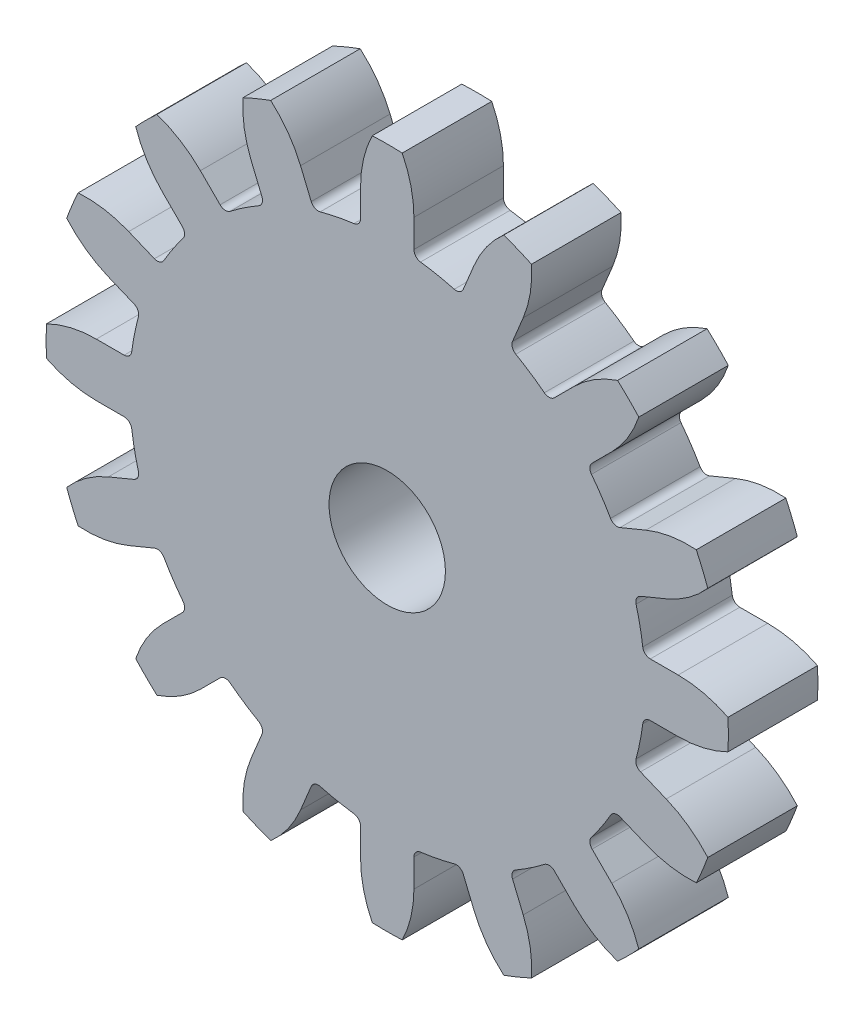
ISO-10303-21;
HEADER;
FILE_DESCRIPTION(('STEP AP214'),'2;1');
FILE_NAME('part.step','',(''),(''),'','','');
FILE_SCHEMA(('AUTOMOTIVE_DESIGN { 1 0 10303 214 1 1 1 1 }'));
ENDSEC;
DATA;
#1=APPLICATION_CONTEXT('core data for automotive mechanical design processes');
#2=APPLICATION_PROTOCOL_DEFINITION('international standard','automotive_design',2000,#1);
#3=PRODUCT_CONTEXT('',#1,'mechanical');
#4=PRODUCT('Part','Part','',(#3));
#5=PRODUCT_RELATED_PRODUCT_CATEGORY('part','',(#4));
#6=PRODUCT_DEFINITION_FORMATION('','',#4);
#7=PRODUCT_DEFINITION_CONTEXT('part definition',#1,'design');
#8=PRODUCT_DEFINITION('design','',#6,#7);
#9=PRODUCT_DEFINITION_SHAPE('','',#8);
#10=(LENGTH_UNIT() NAMED_UNIT(*) SI_UNIT(.MILLI.,.METRE.));
#11=(NAMED_UNIT(*) PLANE_ANGLE_UNIT() SI_UNIT($,.RADIAN.));
#12=(NAMED_UNIT(*) SI_UNIT($,.STERADIAN.) SOLID_ANGLE_UNIT());
#13=UNCERTAINTY_MEASURE_WITH_UNIT(LENGTH_MEASURE(1.E-05),#10,'distance_accuracy_value','');
#14=(GEOMETRIC_REPRESENTATION_CONTEXT(3) GLOBAL_UNCERTAINTY_ASSIGNED_CONTEXT((#13)) GLOBAL_UNIT_ASSIGNED_CONTEXT((#10,
#11,#12)) REPRESENTATION_CONTEXT('',''));
#15=CARTESIAN_POINT('',(0.,0.,0.));
#16=DIRECTION('',(0.,0.,1.));
#17=DIRECTION('',(1.,0.,0.));
#18=AXIS2_PLACEMENT_3D('',#15,#16,#17);
#19=CARTESIAN_POINT('',(23.4866159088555,-18.0712127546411,10.));
#20=DIRECTION('',(0.,0.,-1.));
#21=DIRECTION('',(-1.,0.,0.));
#22=AXIS2_PLACEMENT_3D('',#19,#20,#21);
#23=PLANE('',#22);
#24=CARTESIAN_POINT('',(23.4866159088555,-18.0712127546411,10.));
#25=DIRECTION('',(0.,0.,-1.));
#26=DIRECTION('',(-1.,0.,0.));
#27=AXIS2_PLACEMENT_3D('',#24,#25,#26);
#28=CIRCLE('',#27,0.849268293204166);
#29=CARTESIAN_POINT('',(22.8860925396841,-18.6717361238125,10.));
#30=VERTEX_POINT('',#29);
#31=CARTESIAN_POINT('',(22.8135289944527,-17.5533221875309,10.));
#32=VERTEX_POINT('',#31);
#33=EDGE_CURVE('E1103',#30,#32,#28,.T.);
#34=ORIENTED_EDGE('',*,*,#33,.T.);
#35=CARTESIAN_POINT('',(0.,0.,10.));
#36=DIRECTION('',(0.,0.,1.));
#37=DIRECTION('',(1.,0.,0.));
#38=AXIS2_PLACEMENT_3D('',#35,#36,#37);
#39=CIRCLE('',#38,28.785);
#40=CARTESIAN_POINT('',(24.9475146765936,-14.3595869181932,10.));
#41=VERTEX_POINT('',#40);
#42=EDGE_CURVE('E451',#32,#41,#39,.T.);
#43=ORIENTED_EDGE('',*,*,#42,.T.);
#44=CARTESIAN_POINT('',(25.683562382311,-14.7832500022,10.));
#45=DIRECTION('',(0.,0.,-1.));
#46=DIRECTION('',(1.,0.,0.));
#47=AXIS2_PLACEMENT_3D('',#44,#45,#46);
#48=CIRCLE('',#47,0.849268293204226);
#49=CARTESIAN_POINT('',(26.0085632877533,-13.9986284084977,10.));
#50=VERTEX_POINT('',#49);
#51=EDGE_CURVE('E1478',#41,#50,#48,.T.);
#52=ORIENTED_EDGE('',*,*,#51,.T.);
#53=DIRECTION('',(0.923879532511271,-0.382683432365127,0.));
#54=VECTOR('',#53,1.);
#55=CARTESIAN_POINT('',(28.8823808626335,-15.1890026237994,10.));
#56=LINE('',#55,#54);
#57=CARTESIAN_POINT('',(28.8823808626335,-15.1890026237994,10.));
#58=VERTEX_POINT('',#57);
#59=EDGE_CURVE('E1497',#50,#58,#56,.T.);
#60=ORIENTED_EDGE('',*,*,#59,.T.);
#61=CARTESIAN_POINT('',(33.6697506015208,-3.63126967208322,10.));
#62=DIRECTION('',(0.,0.,1.));
#63=DIRECTION('',(-1.,0.,0.));
#64=AXIS2_PLACEMENT_3D('',#61,#62,#63);
#65=CIRCLE('',#64,12.51);
#66=CARTESIAN_POINT('',(34.5255656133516,-16.1119619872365,10.));
#67=VERTEX_POINT('',#66);
#68=EDGE_CURVE('E1494',#58,#67,#65,.T.);
#69=ORIENTED_EDGE('',*,*,#68,.T.);
#70=CARTESIAN_POINT('',(0.,0.,10.));
#71=DIRECTION('',(0.,0.,1.));
#72=DIRECTION('',(1.,0.,0.));
#73=AXIS2_PLACEMENT_3D('',#70,#71,#72);
#74=CIRCLE('',#73,38.1);
#75=CARTESIAN_POINT('',(35.8061391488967,-13.0203839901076,10.));
#76=VERTEX_POINT('',#75);
#77=EDGE_CURVE('E1496',#67,#76,#74,.T.);
#78=ORIENTED_EDGE('',*,*,#77,.T.);
#79=CARTESIAN_POINT('',(26.3758043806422,-21.2404135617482,10.));
#80=DIRECTION('',(0.,0.,1.));
#81=DIRECTION('',(1.,0.,0.));
#82=AXIS2_PLACEMENT_3D('',#79,#80,#81);
#83=CIRCLE('',#82,12.5099999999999);
#84=CARTESIAN_POINT('',(31.1631741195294,-9.68268061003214,10.));
#85=VERTEX_POINT('',#84);
#86=EDGE_CURVE('E1499',#76,#85,#83,.T.);
#87=ORIENTED_EDGE('',*,*,#86,.T.);
#88=DIRECTION('',(-0.923879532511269,0.382683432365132,0.));
#89=VECTOR('',#88,1.);
#90=CARTESIAN_POINT('',(31.1631741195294,-9.68268061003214,10.));
#91=LINE('',#90,#89);
#92=CARTESIAN_POINT('',(28.2893565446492,-8.49230639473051,10.));
#93=VERTEX_POINT('',#92);
#94=EDGE_CURVE('E1505',#85,#93,#91,.T.);
#95=ORIENTED_EDGE('',*,*,#94,.T.);
#96=CARTESIAN_POINT('',(28.6143574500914,-7.70768480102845,10.));
#97=DIRECTION('',(0.,0.,-1.));
#98=DIRECTION('',(-1.,0.,0.));
#99=AXIS2_PLACEMENT_3D('',#96,#97,#98);
#100=CIRCLE('',#99,0.849268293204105);
#101=CARTESIAN_POINT('',(27.7943180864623,-7.48679551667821,10.));
#102=VERTEX_POINT('',#101);
#103=EDGE_CURVE('E1507',#93,#102,#100,.T.);
#104=ORIENTED_EDGE('',*,*,#103,.T.);
#105=CARTESIAN_POINT('',(0.,0.,10.));
#106=DIRECTION('',(0.,0.,1.));
#107=DIRECTION('',(1.,0.,0.));
#108=AXIS2_PLACEMENT_3D('',#105,#106,#107);
#109=CIRCLE('',#108,28.785);
#110=CARTESIAN_POINT('',(28.5436742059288,-3.71952790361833,10.));
#111=VERTEX_POINT('',#110);
#112=EDGE_CURVE('E1509',#102,#111,#109,.T.);
#113=ORIENTED_EDGE('',*,*,#112,.T.);
#114=CARTESIAN_POINT('',(29.3858224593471,-3.82926829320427,10.));
#115=DIRECTION('',(0.,0.,-1.));
#116=DIRECTION('',(1.,0.,0.));
#117=AXIS2_PLACEMENT_3D('',#114,#115,#116);
#118=CIRCLE('',#117,0.84926829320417);
#119=CARTESIAN_POINT('',(29.3858224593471,-2.9800000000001,10.));
#120=VERTEX_POINT('',#119);
#121=EDGE_CURVE('E1511',#111,#120,#118,.T.);
#122=ORIENTED_EDGE('',*,*,#121,.T.);
#123=DIRECTION('',(1.,0.,0.));
#124=VECTOR('',#123,1.);
#125=CARTESIAN_POINT('',(32.4964201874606,-2.98000000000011,10.));
#126=LINE('',#125,#124);
#127=CARTESIAN_POINT('',(32.4964201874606,-2.98000000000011,10.));
#128=VERTEX_POINT('',#127);
#129=EDGE_CURVE('E1513',#120,#128,#126,.T.);
#130=ORIENTED_EDGE('',*,*,#129,.T.);
#131=CARTESIAN_POINT('',(32.4964201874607,9.52999999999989,10.));
#132=DIRECTION('',(0.,0.,1.));
#133=DIRECTION('',(-1.,0.,0.));
#134=AXIS2_PLACEMENT_3D('',#131,#132,#133);
#135=CIRCLE('',#134,12.51);
#136=CARTESIAN_POINT('',(38.0632443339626,-1.67314995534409,10.));
#137=VERTEX_POINT('',#136);
#138=EDGE_CURVE('E1515',#128,#137,#135,.T.);
#139=ORIENTED_EDGE('',*,*,#138,.T.);
#140=CARTESIAN_POINT('',(0.,0.,10.));
#141=DIRECTION('',(0.,0.,1.));
#142=DIRECTION('',(1.,0.,0.));
#143=AXIS2_PLACEMENT_3D('',#140,#141,#142);
#144=CIRCLE('',#143,38.1);
#145=CARTESIAN_POINT('',(38.0632443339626,1.67314995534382,10.));
#146=VERTEX_POINT('',#145);
#147=EDGE_CURVE('E1517',#137,#146,#144,.T.);
#148=ORIENTED_EDGE('',*,*,#147,.T.);
#149=CARTESIAN_POINT('',(32.4964201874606,-9.53,10.));
#150=DIRECTION('',(0.,0.,1.));
#151=DIRECTION('',(1.,0.,0.));
#152=AXIS2_PLACEMENT_3D('',#149,#150,#151);
#153=CIRCLE('',#152,12.5099999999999);
#154=CARTESIAN_POINT('',(32.4964201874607,2.97999999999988,10.));
#155=VERTEX_POINT('',#154);
#156=EDGE_CURVE('E1519',#146,#155,#153,.T.);
#157=ORIENTED_EDGE('',*,*,#156,.T.);
#158=DIRECTION('',(-1.,0.,0.));
#159=VECTOR('',#158,1.);
#160=CARTESIAN_POINT('',(32.4964201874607,2.97999999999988,10.));
#161=LINE('',#160,#159);
#162=CARTESIAN_POINT('',(29.3858224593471,2.9799999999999,10.));
#163=VERTEX_POINT('',#162);
#164=EDGE_CURVE('E1521',#155,#163,#161,.T.);
#165=ORIENTED_EDGE('',*,*,#164,.T.);
#166=CARTESIAN_POINT('',(29.3858224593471,3.82926829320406,10.));
#167=DIRECTION('',(0.,0.,-1.));
#168=DIRECTION('',(-1.,0.,0.));
#169=AXIS2_PLACEMENT_3D('',#166,#167,#168);
#170=CIRCLE('',#169,0.849268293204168);
#171=CARTESIAN_POINT('',(28.5436742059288,3.71952790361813,10.));
#172=VERTEX_POINT('',#171);
#173=EDGE_CURVE('E1523',#163,#172,#170,.T.);
#174=ORIENTED_EDGE('',*,*,#173,.T.);
#175=CARTESIAN_POINT('',(0.,0.,10.));
#176=DIRECTION('',(0.,0.,1.));
#177=DIRECTION('',(1.,0.,0.));
#178=AXIS2_PLACEMENT_3D('',#175,#176,#177);
#179=CIRCLE('',#178,28.785);
#180=CARTESIAN_POINT('',(27.7943180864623,7.4867955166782,10.));
#181=VERTEX_POINT('',#180);
#182=EDGE_CURVE('E1525',#172,#181,#179,.T.);
#183=ORIENTED_EDGE('',*,*,#182,.T.);
#184=CARTESIAN_POINT('',(28.6143574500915,7.70768480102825,10.));
#185=DIRECTION('',(0.,0.,-1.));
#186=DIRECTION('',(1.,0.,0.));
#187=AXIS2_PLACEMENT_3D('',#184,#185,#186);
#188=CIRCLE('',#187,0.849268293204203);
#189=CARTESIAN_POINT('',(28.2893565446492,8.49230639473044,10.));
#190=VERTEX_POINT('',#189);
#191=EDGE_CURVE('E1527',#181,#190,#188,.T.);
#192=ORIENTED_EDGE('',*,*,#191,.T.);
#193=DIRECTION('',(0.923879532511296,0.382683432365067,0.));
#194=VECTOR('',#193,1.);
#195=CARTESIAN_POINT('',(31.1631741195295,9.68268061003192,10.));
#196=LINE('',#195,#194);
#197=CARTESIAN_POINT('',(31.1631741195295,9.68268061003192,10.));
#198=VERTEX_POINT('',#197);
#199=EDGE_CURVE('E1529',#190,#198,#196,.T.);
#200=ORIENTED_EDGE('',*,*,#199,.T.);
#201=CARTESIAN_POINT('',(26.3758043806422,21.2404135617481,10.));
#202=DIRECTION('',(0.,0.,1.));
#203=DIRECTION('',(-1.,0.,0.));
#204=AXIS2_PLACEMENT_3D('',#201,#202,#203);
#205=CIRCLE('',#204,12.51);
#206=CARTESIAN_POINT('',(35.8061391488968,13.0203839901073,10.));
#207=VERTEX_POINT('',#206);
#208=EDGE_CURVE('E1531',#198,#207,#205,.T.);
#209=ORIENTED_EDGE('',*,*,#208,.T.);
#210=CARTESIAN_POINT('',(0.,0.,10.));
#211=DIRECTION('',(0.,0.,1.));
#212=DIRECTION('',(1.,0.,0.));
#213=AXIS2_PLACEMENT_3D('',#210,#211,#212);
#214=CIRCLE('',#213,38.1);
#215=CARTESIAN_POINT('',(34.5255656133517,16.1119619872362,10.));
#216=VERTEX_POINT('',#215);
#217=EDGE_CURVE('E1533',#207,#216,#214,.T.);
#218=ORIENTED_EDGE('',*,*,#217,.T.);
#219=CARTESIAN_POINT('',(33.6697506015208,3.63126967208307,10.));
#220=DIRECTION('',(0.,0.,1.));
#221=DIRECTION('',(1.,0.,0.));
#222=AXIS2_PLACEMENT_3D('',#219,#220,#221);
#223=CIRCLE('',#222,12.5099999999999);
#224=CARTESIAN_POINT('',(28.8823808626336,15.1890026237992,10.));
#225=VERTEX_POINT('',#224);
#226=EDGE_CURVE('E1535',#216,#225,#223,.T.);
#227=ORIENTED_EDGE('',*,*,#226,.T.);
#228=DIRECTION('',(-0.923879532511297,-0.382683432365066,0.));
#229=VECTOR('',#228,1.);
#230=CARTESIAN_POINT('',(28.8823808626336,15.1890026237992,10.));
#231=LINE('',#230,#229);
#232=CARTESIAN_POINT('',(26.0085632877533,13.9986284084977,10.));
#233=VERTEX_POINT('',#232);
#234=EDGE_CURVE('E1537',#225,#233,#231,.T.);
#235=ORIENTED_EDGE('',*,*,#234,.T.);
#236=CARTESIAN_POINT('',(25.6835623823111,14.7832500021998,10.));
#237=DIRECTION('',(0.,0.,-1.));
#238=DIRECTION('',(-1.,0.,0.));
#239=AXIS2_PLACEMENT_3D('',#236,#237,#238);
#240=CIRCLE('',#239,0.849268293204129);
#241=CARTESIAN_POINT('',(24.9475146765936,14.3595869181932,10.));
#242=VERTEX_POINT('',#241);
#243=EDGE_CURVE('E1539',#233,#242,#240,.T.);
#244=ORIENTED_EDGE('',*,*,#243,.T.);
#245=CARTESIAN_POINT('',(0.,0.,10.));
#246=DIRECTION('',(0.,0.,1.));
#247=DIRECTION('',(1.,0.,0.));
#248=AXIS2_PLACEMENT_3D('',#245,#246,#247);
#249=CIRCLE('',#248,28.785);
#250=CARTESIAN_POINT('',(22.8135289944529,17.5533221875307,10.));
#251=VERTEX_POINT('',#250);
#252=EDGE_CURVE('E1541',#242,#251,#249,.T.);
#253=ORIENTED_EDGE('',*,*,#252,.T.);
#254=CARTESIAN_POINT('',(23.4866159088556,18.0712127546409,10.));
#255=DIRECTION('',(0.,0.,-1.));
#256=DIRECTION('',(1.,0.,0.));
#257=AXIS2_PLACEMENT_3D('',#254,#255,#256);
#258=CIRCLE('',#257,0.849268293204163);
#259=CARTESIAN_POINT('',(22.8860925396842,18.6717361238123,10.));
#260=VERTEX_POINT('',#259);
#261=EDGE_CURVE('E1543',#251,#260,#258,.T.);
#262=ORIENTED_EDGE('',*,*,#261,.T.);
#263=DIRECTION('',(0.707106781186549,0.707106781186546,0.));
#264=VECTOR('',#263,1.);
#265=CARTESIAN_POINT('',(25.0856172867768,20.8712608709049,10.));
#266=LINE('',#265,#264);
#267=CARTESIAN_POINT('',(25.0856172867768,20.8712608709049,10.));
#268=VERTEX_POINT('',#267);
#269=EDGE_CURVE('E1545',#260,#268,#266,.T.);
#270=ORIENTED_EDGE('',*,*,#269,.T.);
#271=CARTESIAN_POINT('',(16.2397114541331,29.7171667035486,10.));
#272=DIRECTION('',(0.,0.,1.));
#273=DIRECTION('',(-1.,0.,0.));
#274=AXIS2_PLACEMENT_3D('',#271,#272,#273);
#275=CIRCLE('',#274,12.51);
#276=CARTESIAN_POINT('',(28.0978738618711,25.7316825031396,10.));
#277=VERTEX_POINT('',#276);
#278=EDGE_CURVE('E1547',#268,#277,#275,.T.);
#279=ORIENTED_EDGE('',*,*,#278,.T.);
#280=CARTESIAN_POINT('',(0.,0.,10.));
#281=DIRECTION('',(0.,0.,1.));
#282=DIRECTION('',(1.,0.,0.));
#283=AXIS2_PLACEMENT_3D('',#280,#281,#282);
#284=CIRCLE('',#283,38.1);
#285=CARTESIAN_POINT('',(25.7316825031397,28.097873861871,10.));
#286=VERTEX_POINT('',#285);
#287=EDGE_CURVE('E1549',#277,#286,#284,.T.);
#288=ORIENTED_EDGE('',*,*,#287,.T.);
#289=CARTESIAN_POINT('',(29.7171667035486,16.239711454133,10.));
#290=DIRECTION('',(0.,0.,1.));
#291=DIRECTION('',(1.,0.,0.));
#292=AXIS2_PLACEMENT_3D('',#289,#290,#291);
#293=CIRCLE('',#292,12.5099999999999);
#294=CARTESIAN_POINT('',(20.871260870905,25.0856172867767,10.));
#295=VERTEX_POINT('',#294);
#296=EDGE_CURVE('E1551',#286,#295,#293,.T.);
#297=ORIENTED_EDGE('',*,*,#296,.T.);
#298=DIRECTION('',(-0.707106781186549,-0.707106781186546,0.));
#299=VECTOR('',#298,1.);
#300=CARTESIAN_POINT('',(20.871260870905,25.0856172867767,10.));
#301=LINE('',#300,#299);
#302=CARTESIAN_POINT('',(18.6717361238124,22.8860925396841,10.));
#303=VERTEX_POINT('',#302);
#304=EDGE_CURVE('E1553',#295,#303,#301,.T.);
#305=ORIENTED_EDGE('',*,*,#304,.T.);
#306=CARTESIAN_POINT('',(18.071212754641,23.4866159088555,10.));
#307=DIRECTION('',(0.,0.,-1.));
#308=DIRECTION('',(-1.,0.,0.));
#309=AXIS2_PLACEMENT_3D('',#306,#307,#308);
#310=CIRCLE('',#309,0.849268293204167);
#311=CARTESIAN_POINT('',(17.5533221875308,22.8135289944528,10.));
#312=VERTEX_POINT('',#311);
#313=EDGE_CURVE('E1555',#303,#312,#310,.T.);
#314=ORIENTED_EDGE('',*,*,#313,.T.);
#315=CARTESIAN_POINT('',(0.,0.,10.));
#316=DIRECTION('',(0.,0.,1.));
#317=DIRECTION('',(1.,0.,0.));
#318=AXIS2_PLACEMENT_3D('',#315,#316,#317);
#319=CIRCLE('',#318,28.785);
#320=CARTESIAN_POINT('',(14.3595869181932,24.9475146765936,10.));
#321=VERTEX_POINT('',#320);
#322=EDGE_CURVE('E1557',#312,#321,#319,.T.);
#323=ORIENTED_EDGE('',*,*,#322,.T.);
#324=CARTESIAN_POINT('',(14.7832500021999,25.6835623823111,10.));
#325=DIRECTION('',(0.,0.,-1.));
#326=DIRECTION('',(1.,0.,0.));
#327=AXIS2_PLACEMENT_3D('',#324,#325,#326);
#328=CIRCLE('',#327,0.849268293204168);
#329=CARTESIAN_POINT('',(13.9986284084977,26.0085632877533,10.));
#330=VERTEX_POINT('',#329);
#331=EDGE_CURVE('E1559',#321,#330,#328,.T.);
#332=ORIENTED_EDGE('',*,*,#331,.T.);
#333=DIRECTION('',(0.382683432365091,0.923879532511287,0.));
#334=VECTOR('',#333,1.);
#335=CARTESIAN_POINT('',(15.1890026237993,28.8823808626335,10.));
#336=LINE('',#335,#334);
#337=CARTESIAN_POINT('',(15.1890026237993,28.8823808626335,10.));
#338=VERTEX_POINT('',#337);
#339=EDGE_CURVE('E1561',#330,#338,#336,.T.);
#340=ORIENTED_EDGE('',*,*,#339,.T.);
#341=CARTESIAN_POINT('',(3.6312696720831,33.6697506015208,10.));
#342=DIRECTION('',(0.,0.,1.));
#343=DIRECTION('',(-1.,0.,0.));
#344=AXIS2_PLACEMENT_3D('',#341,#342,#343);
#345=CIRCLE('',#344,12.51);
#346=CARTESIAN_POINT('',(16.1119619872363,34.5255656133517,10.));
#347=VERTEX_POINT('',#346);
#348=EDGE_CURVE('E1563',#338,#347,#345,.T.);
#349=ORIENTED_EDGE('',*,*,#348,.T.);
#350=CARTESIAN_POINT('',(0.,0.,10.));
#351=DIRECTION('',(0.,0.,1.));
#352=DIRECTION('',(1.,0.,0.));
#353=AXIS2_PLACEMENT_3D('',#350,#351,#352);
#354=CIRCLE('',#353,38.1);
#355=CARTESIAN_POINT('',(13.0203839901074,35.8061391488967,10.));
#356=VERTEX_POINT('',#355);
#357=EDGE_CURVE('E1565',#347,#356,#354,.T.);
#358=ORIENTED_EDGE('',*,*,#357,.T.);
#359=CARTESIAN_POINT('',(21.2404135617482,26.3758043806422,10.));
#360=DIRECTION('',(0.,0.,1.));
#361=DIRECTION('',(1.,0.,0.));
#362=AXIS2_PLACEMENT_3D('',#359,#360,#361);
#363=CIRCLE('',#362,12.51);
#364=CARTESIAN_POINT('',(9.68268061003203,31.1631741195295,10.));
#365=VERTEX_POINT('',#364);
#366=EDGE_CURVE('E1567',#356,#365,#363,.T.);
#367=ORIENTED_EDGE('',*,*,#366,.T.);
#368=DIRECTION('',(-0.382683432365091,-0.923879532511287,0.));
#369=VECTOR('',#368,1.);
#370=CARTESIAN_POINT('',(9.68268061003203,31.1631741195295,10.));
#371=LINE('',#370,#369);
#372=CARTESIAN_POINT('',(8.49230639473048,28.2893565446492,10.));
#373=VERTEX_POINT('',#372);
#374=EDGE_CURVE('E1569',#365,#373,#371,.T.);
#375=ORIENTED_EDGE('',*,*,#374,.T.);
#376=CARTESIAN_POINT('',(7.70768480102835,28.6143574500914,10.));
#377=DIRECTION('',(0.,0.,-1.));
#378=DIRECTION('',(-1.,0.,0.));
#379=AXIS2_PLACEMENT_3D('',#376,#377,#378);
#380=CIRCLE('',#379,0.849268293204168);
#381=CARTESIAN_POINT('',(7.48679551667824,27.7943180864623,10.));
#382=VERTEX_POINT('',#381);
#383=EDGE_CURVE('E1571',#373,#382,#380,.T.);
#384=ORIENTED_EDGE('',*,*,#383,.T.);
#385=CARTESIAN_POINT('',(0.,0.,10.));
#386=DIRECTION('',(0.,0.,1.));
#387=DIRECTION('',(1.,0.,0.));
#388=AXIS2_PLACEMENT_3D('',#385,#386,#387);
#389=CIRCLE('',#388,28.785);
#390=CARTESIAN_POINT('',(3.71952790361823,28.5436742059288,10.));
#391=VERTEX_POINT('',#390);
#392=EDGE_CURVE('E1573',#382,#391,#389,.T.);
#393=ORIENTED_EDGE('',*,*,#392,.T.);
#394=CARTESIAN_POINT('',(3.82926829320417,29.3858224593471,10.));
#395=DIRECTION('',(0.,0.,-1.));
#396=DIRECTION('',(1.,0.,0.));
#397=AXIS2_PLACEMENT_3D('',#394,#395,#396);
#398=CIRCLE('',#397,0.849268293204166);
#399=CARTESIAN_POINT('',(2.98,29.3858224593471,10.));
#400=VERTEX_POINT('',#399);
#401=EDGE_CURVE('E1575',#391,#400,#398,.T.);
#402=ORIENTED_EDGE('',*,*,#401,.T.);
#403=DIRECTION('',(0.,1.,0.));
#404=VECTOR('',#403,1.);
#405=CARTESIAN_POINT('',(2.98,32.4964201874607,10.));
#406=LINE('',#405,#404);
#407=CARTESIAN_POINT('',(2.98,32.4964201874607,10.));
#408=VERTEX_POINT('',#407);
#409=EDGE_CURVE('E1577',#400,#408,#406,.T.);
#410=ORIENTED_EDGE('',*,*,#409,.T.);
#411=CARTESIAN_POINT('',(-9.53,32.4964201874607,10.));
#412=DIRECTION('',(0.,0.,1.));
#413=DIRECTION('',(-1.,0.,0.));
#414=AXIS2_PLACEMENT_3D('',#411,#412,#413);
#415=CIRCLE('',#414,12.51);
#416=CARTESIAN_POINT('',(1.67314995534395,38.0632443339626,10.));
#417=VERTEX_POINT('',#416);
#418=EDGE_CURVE('E1579',#408,#417,#415,.T.);
#419=ORIENTED_EDGE('',*,*,#418,.T.);
#420=CARTESIAN_POINT('',(0.,0.,10.));
#421=DIRECTION('',(0.,0.,1.));
#422=DIRECTION('',(1.,0.,0.));
#423=AXIS2_PLACEMENT_3D('',#420,#421,#422);
#424=CIRCLE('',#423,38.1);
#425=CARTESIAN_POINT('',(-1.67314995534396,38.0632443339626,10.));
#426=VERTEX_POINT('',#425);
#427=EDGE_CURVE('E1581',#417,#426,#424,.T.);
#428=ORIENTED_EDGE('',*,*,#427,.T.);
#429=CARTESIAN_POINT('',(9.52999999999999,32.4964201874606,10.));
#430=DIRECTION('',(0.,0.,1.));
#431=DIRECTION('',(1.,0.,0.));
#432=AXIS2_PLACEMENT_3D('',#429,#430,#431);
#433=CIRCLE('',#432,12.51);
#434=CARTESIAN_POINT('',(-2.98000000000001,32.4964201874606,10.));
#435=VERTEX_POINT('',#434);
#436=EDGE_CURVE('E1583',#426,#435,#433,.T.);
#437=ORIENTED_EDGE('',*,*,#436,.T.);
#438=DIRECTION('',(0.,-1.,0.));
#439=VECTOR('',#438,1.);
#440=CARTESIAN_POINT('',(-2.98000000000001,32.4964201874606,10.));
#441=LINE('',#440,#439);
#442=CARTESIAN_POINT('',(-2.98,29.3858224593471,10.));
#443=VERTEX_POINT('',#442);
#444=EDGE_CURVE('E1585',#435,#443,#441,.T.);
#445=ORIENTED_EDGE('',*,*,#444,.T.);
#446=CARTESIAN_POINT('',(-3.82926829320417,29.3858224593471,10.));
#447=DIRECTION('',(0.,0.,-1.));
#448=DIRECTION('',(-1.,0.,0.));
#449=AXIS2_PLACEMENT_3D('',#446,#447,#448);
#450=CIRCLE('',#449,0.849268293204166);
#451=CARTESIAN_POINT('',(-3.71952790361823,28.5436742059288,10.));
#452=VERTEX_POINT('',#451);
#453=EDGE_CURVE('E1587',#443,#452,#450,.T.);
#454=ORIENTED_EDGE('',*,*,#453,.T.);
#455=CARTESIAN_POINT('',(0.,0.,10.));
#456=DIRECTION('',(0.,0.,1.));
#457=DIRECTION('',(1.,0.,0.));
#458=AXIS2_PLACEMENT_3D('',#455,#456,#457);
#459=CIRCLE('',#458,28.785);
#460=CARTESIAN_POINT('',(-7.48679551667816,27.7943180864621,10.));
#461=VERTEX_POINT('',#460);
#462=EDGE_CURVE('E1589',#452,#461,#459,.T.);
#463=ORIENTED_EDGE('',*,*,#462,.T.);
#464=CARTESIAN_POINT('',(-7.70768480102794,28.6143574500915,10.));
#465=DIRECTION('',(0.,0.,-1.));
#466=DIRECTION('',(1.,0.,0.));
#467=AXIS2_PLACEMENT_3D('',#464,#465,#466);
#468=CIRCLE('',#467,0.849268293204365);
#469=CARTESIAN_POINT('',(-8.49230639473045,28.2893565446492,10.));
#470=VERTEX_POINT('',#469);
#471=EDGE_CURVE('E1591',#461,#470,#468,.T.);
#472=ORIENTED_EDGE('',*,*,#471,.T.);
#473=DIRECTION('',(-0.38268343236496,0.923879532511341,0.));
#474=VECTOR('',#473,1.);
#475=CARTESIAN_POINT('',(-9.68268061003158,31.1631741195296,10.));
#476=LINE('',#475,#474);
#477=CARTESIAN_POINT('',(-9.68268061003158,31.1631741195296,10.));
#478=VERTEX_POINT('',#477);
#479=EDGE_CURVE('E1593',#470,#478,#476,.T.);
#480=ORIENTED_EDGE('',*,*,#479,.T.);
#481=CARTESIAN_POINT('',(-21.2404135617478,26.3758043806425,10.));
#482=DIRECTION('',(0.,0.,1.));
#483=DIRECTION('',(-1.,0.,0.));
#484=AXIS2_PLACEMENT_3D('',#481,#482,#483);
#485=CIRCLE('',#484,12.51);
#486=CARTESIAN_POINT('',(-13.0203839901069,35.8061391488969,10.));
#487=VERTEX_POINT('',#486);
#488=EDGE_CURVE('E1595',#478,#487,#485,.T.);
#489=ORIENTED_EDGE('',*,*,#488,.T.);
#490=CARTESIAN_POINT('',(0.,0.,10.));
#491=DIRECTION('',(0.,0.,1.));
#492=DIRECTION('',(1.,0.,0.));
#493=AXIS2_PLACEMENT_3D('',#490,#491,#492);
#494=CIRCLE('',#493,38.1);
#495=CARTESIAN_POINT('',(-16.1119619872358,34.5255656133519,10.));
#496=VERTEX_POINT('',#495);
#497=EDGE_CURVE('E1597',#487,#496,#494,.T.);
#498=ORIENTED_EDGE('',*,*,#497,.T.);
#499=CARTESIAN_POINT('',(-3.63126967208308,33.6697506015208,10.));
#500=DIRECTION('',(0.,0.,1.));
#501=DIRECTION('',(1.,0.,0.));
#502=AXIS2_PLACEMENT_3D('',#499,#500,#501);
#503=CIRCLE('',#502,12.5099999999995);
#504=CARTESIAN_POINT('',(-15.1890026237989,28.8823808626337,10.));
#505=VERTEX_POINT('',#504);
#506=EDGE_CURVE('E1599',#496,#505,#503,.T.);
#507=ORIENTED_EDGE('',*,*,#506,.T.);
#508=DIRECTION('',(0.382683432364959,-0.923879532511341,0.));
#509=VECTOR('',#508,1.);
#510=CARTESIAN_POINT('',(-15.1890026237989,28.8823808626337,10.));
#511=LINE('',#510,#509);
#512=CARTESIAN_POINT('',(-13.9986284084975,26.0085632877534,10.));
#513=VERTEX_POINT('',#512);
#514=EDGE_CURVE('E1601',#505,#513,#511,.T.);
#515=ORIENTED_EDGE('',*,*,#514,.T.);
#516=CARTESIAN_POINT('',(-14.7832500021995,25.6835623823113,10.));
#517=DIRECTION('',(0.,0.,-1.));
#518=DIRECTION('',(-1.,0.,0.));
#519=AXIS2_PLACEMENT_3D('',#516,#517,#518);
#520=CIRCLE('',#519,0.849268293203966);
#521=CARTESIAN_POINT('',(-14.3595869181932,24.9475146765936,10.));
#522=VERTEX_POINT('',#521);
#523=EDGE_CURVE('E1603',#513,#522,#520,.T.);
#524=ORIENTED_EDGE('',*,*,#523,.T.);
#525=CARTESIAN_POINT('',(0.,0.,10.));
#526=DIRECTION('',(0.,0.,1.));
#527=DIRECTION('',(1.,0.,0.));
#528=AXIS2_PLACEMENT_3D('',#525,#526,#527);
#529=CIRCLE('',#528,28.785);
#530=CARTESIAN_POINT('',(-17.5533221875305,22.813528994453,10.));
#531=VERTEX_POINT('',#530);
#532=EDGE_CURVE('E1605',#522,#531,#529,.T.);
#533=ORIENTED_EDGE('',*,*,#532,.T.);
#534=CARTESIAN_POINT('',(-18.0712127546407,23.4866159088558,10.));
#535=DIRECTION('',(0.,0.,-1.));
#536=DIRECTION('',(1.,0.,0.));
#537=AXIS2_PLACEMENT_3D('',#534,#535,#536);
#538=CIRCLE('',#537,0.849268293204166);
#539=CARTESIAN_POINT('',(-18.6717361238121,22.8860925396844,10.));
#540=VERTEX_POINT('',#539);
#541=EDGE_CURVE('E1607',#531,#540,#538,.T.);
#542=ORIENTED_EDGE('',*,*,#541,.T.);
#543=DIRECTION('',(-0.707106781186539,0.707106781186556,0.));
#544=VECTOR('',#543,1.);
#545=CARTESIAN_POINT('',(-20.8712608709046,25.085617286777,10.));
#546=LINE('',#545,#544);
#547=CARTESIAN_POINT('',(-20.8712608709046,25.085617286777,10.));
#548=VERTEX_POINT('',#547);
#549=EDGE_CURVE('E1609',#540,#548,#546,.T.);
#550=ORIENTED_EDGE('',*,*,#549,.T.);
#551=CARTESIAN_POINT('',(-29.7171667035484,16.2397114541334,10.));
#552=DIRECTION('',(0.,0.,1.));
#553=DIRECTION('',(-1.,0.,0.));
#554=AXIS2_PLACEMENT_3D('',#551,#552,#553);
#555=CIRCLE('',#554,12.51);
#556=CARTESIAN_POINT('',(-25.7316825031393,28.0978738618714,10.));
#557=VERTEX_POINT('',#556);
#558=EDGE_CURVE('E1611',#548,#557,#555,.T.);
#559=ORIENTED_EDGE('',*,*,#558,.T.);
#560=CARTESIAN_POINT('',(0.,0.,10.));
#561=DIRECTION('',(0.,0.,1.));
#562=DIRECTION('',(1.,0.,0.));
#563=AXIS2_PLACEMENT_3D('',#560,#561,#562);
#564=CIRCLE('',#563,38.1);
#565=CARTESIAN_POINT('',(-28.0978738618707,25.73168250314,10.));
#566=VERTEX_POINT('',#565);
#567=EDGE_CURVE('E1613',#557,#566,#564,.T.);
#568=ORIENTED_EDGE('',*,*,#567,.T.);
#569=CARTESIAN_POINT('',(-16.2397114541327,29.7171667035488,10.));
#570=DIRECTION('',(0.,0.,1.));
#571=DIRECTION('',(1.,0.,0.));
#572=AXIS2_PLACEMENT_3D('',#569,#570,#571);
#573=CIRCLE('',#572,12.51);
#574=CARTESIAN_POINT('',(-25.0856172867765,20.8712608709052,10.));
#575=VERTEX_POINT('',#574);
#576=EDGE_CURVE('E1615',#566,#575,#573,.T.);
#577=ORIENTED_EDGE('',*,*,#576,.T.);
#578=DIRECTION('',(0.707106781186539,-0.707106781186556,0.));
#579=VECTOR('',#578,1.);
#580=CARTESIAN_POINT('',(-25.0856172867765,20.8712608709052,10.));
#581=LINE('',#580,#579);
#582=CARTESIAN_POINT('',(-22.886092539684,18.6717361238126,10.));
#583=VERTEX_POINT('',#582);
#584=EDGE_CURVE('E1617',#575,#583,#581,.T.);
#585=ORIENTED_EDGE('',*,*,#584,.T.);
#586=CARTESIAN_POINT('',(-23.4866159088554,18.0712127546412,10.));
#587=DIRECTION('',(0.,0.,-1.));
#588=DIRECTION('',(-1.,0.,0.));
#589=AXIS2_PLACEMENT_3D('',#586,#587,#588);
#590=CIRCLE('',#589,0.849268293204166);
#591=CARTESIAN_POINT('',(-22.8135289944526,17.553322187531,10.));
#592=VERTEX_POINT('',#591);
#593=EDGE_CURVE('E1619',#583,#592,#590,.T.);
#594=ORIENTED_EDGE('',*,*,#593,.T.);
#595=CARTESIAN_POINT('',(0.,0.,10.));
#596=DIRECTION('',(0.,0.,1.));
#597=DIRECTION('',(1.,0.,0.));
#598=AXIS2_PLACEMENT_3D('',#595,#596,#597);
#599=CIRCLE('',#598,28.785);
#600=CARTESIAN_POINT('',(-24.9475146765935,14.3595869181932,10.));
#601=VERTEX_POINT('',#600);
#602=EDGE_CURVE('E1621',#592,#601,#599,.T.);
#603=ORIENTED_EDGE('',*,*,#602,.T.);
#604=CARTESIAN_POINT('',(-25.6835623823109,14.7832500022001,10.));
#605=DIRECTION('',(0.,0.,-1.));
#606=DIRECTION('',(1.,0.,0.));
#607=AXIS2_PLACEMENT_3D('',#604,#605,#606);
#608=CIRCLE('',#607,0.849268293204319);
#609=CARTESIAN_POINT('',(-26.0085632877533,13.9986284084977,10.));
#610=VERTEX_POINT('',#609);
#611=EDGE_CURVE('E1623',#601,#610,#608,.T.);
#612=ORIENTED_EDGE('',*,*,#611,.T.);
#613=DIRECTION('',(-0.923879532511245,0.38268343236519,0.));
#614=VECTOR('',#613,1.);
#615=CARTESIAN_POINT('',(-28.8823808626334,15.1890026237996,10.));
#616=LINE('',#615,#614);
#617=CARTESIAN_POINT('',(-28.8823808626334,15.1890026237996,10.));
#618=VERTEX_POINT('',#617);
#619=EDGE_CURVE('E1625',#610,#618,#616,.T.);
#620=ORIENTED_EDGE('',*,*,#619,.T.);
#621=CARTESIAN_POINT('',(-33.6697506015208,3.63126967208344,10.));
#622=DIRECTION('',(0.,0.,1.));
#623=DIRECTION('',(-1.,0.,0.));
#624=AXIS2_PLACEMENT_3D('',#621,#622,#623);
#625=CIRCLE('',#624,12.51);
#626=CARTESIAN_POINT('',(-34.5255656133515,16.1119619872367,10.));
#627=VERTEX_POINT('',#626);
#628=EDGE_CURVE('E1627',#618,#627,#625,.T.);
#629=ORIENTED_EDGE('',*,*,#628,.T.);
#630=CARTESIAN_POINT('',(0.,0.,10.));
#631=DIRECTION('',(0.,0.,1.));
#632=DIRECTION('',(1.,0.,0.));
#633=AXIS2_PLACEMENT_3D('',#630,#631,#632);
#634=CIRCLE('',#633,38.1);
#635=CARTESIAN_POINT('',(-35.8061391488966,13.0203839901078,10.));
#636=VERTEX_POINT('',#635);
#637=EDGE_CURVE('E1629',#627,#636,#634,.T.);
#638=ORIENTED_EDGE('',*,*,#637,.T.);
#639=CARTESIAN_POINT('',(-26.3758043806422,21.2404135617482,10.));
#640=DIRECTION('',(0.,0.,1.));
#641=DIRECTION('',(1.,0.,0.));
#642=AXIS2_PLACEMENT_3D('',#639,#640,#641);
#643=CIRCLE('',#642,12.5099999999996);
#644=CARTESIAN_POINT('',(-31.1631741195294,9.68268061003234,10.));
#645=VERTEX_POINT('',#644);
#646=EDGE_CURVE('E1631',#636,#645,#643,.T.);
#647=ORIENTED_EDGE('',*,*,#646,.T.);
#648=DIRECTION('',(0.923879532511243,-0.382683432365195,0.));
#649=VECTOR('',#648,1.);
#650=CARTESIAN_POINT('',(-31.1631741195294,9.68268061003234,10.));
#651=LINE('',#650,#649);
#652=CARTESIAN_POINT('',(-28.2893565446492,8.4923063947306,10.));
#653=VERTEX_POINT('',#652);
#654=EDGE_CURVE('E1633',#645,#653,#651,.T.);
#655=ORIENTED_EDGE('',*,*,#654,.T.);
#656=CARTESIAN_POINT('',(-28.6143574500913,7.70768480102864,10.));
#657=DIRECTION('',(0.,0.,-1.));
#658=DIRECTION('',(-1.,0.,0.));
#659=AXIS2_PLACEMENT_3D('',#656,#657,#658);
#660=CIRCLE('',#659,0.849268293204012);
#661=CARTESIAN_POINT('',(-27.7943180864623,7.48679551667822,10.));
#662=VERTEX_POINT('',#661);
#663=EDGE_CURVE('E1635',#653,#662,#660,.T.);
#664=ORIENTED_EDGE('',*,*,#663,.T.);
#665=CARTESIAN_POINT('',(0.,0.,10.));
#666=DIRECTION('',(0.,0.,1.));
#667=DIRECTION('',(1.,0.,0.));
#668=AXIS2_PLACEMENT_3D('',#665,#666,#667);
#669=CIRCLE('',#668,28.785);
#670=CARTESIAN_POINT('',(-28.5436742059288,3.71952790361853,10.));
#671=VERTEX_POINT('',#670);
#672=EDGE_CURVE('E1637',#662,#671,#669,.T.);
#673=ORIENTED_EDGE('',*,*,#672,.T.);
#674=CARTESIAN_POINT('',(-29.385822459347,3.82926829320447,10.));
#675=DIRECTION('',(0.,0.,-1.));
#676=DIRECTION('',(1.,0.,0.));
#677=AXIS2_PLACEMENT_3D('',#674,#675,#676);
#678=CIRCLE('',#677,0.849268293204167);
#679=CARTESIAN_POINT('',(-29.385822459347,2.98000000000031,10.));
#680=VERTEX_POINT('',#679);
#681=EDGE_CURVE('E1639',#671,#680,#678,.T.);
#682=ORIENTED_EDGE('',*,*,#681,.T.);
#683=DIRECTION('',(-1.,0.,0.));
#684=VECTOR('',#683,1.);
#685=CARTESIAN_POINT('',(-32.4964201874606,2.98000000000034,10.));
#686=LINE('',#685,#684);
#687=CARTESIAN_POINT('',(-32.4964201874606,2.98000000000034,10.));
#688=VERTEX_POINT('',#687);
#689=EDGE_CURVE('E1641',#680,#688,#686,.T.);
#690=ORIENTED_EDGE('',*,*,#689,.T.);
#691=CARTESIAN_POINT('',(-32.4964201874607,-9.52999999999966,10.));
#692=DIRECTION('',(0.,0.,1.));
#693=DIRECTION('',(-1.,0.,0.));
#694=AXIS2_PLACEMENT_3D('',#691,#692,#693);
#695=CIRCLE('',#694,12.51);
#696=CARTESIAN_POINT('',(-38.0632443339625,1.67314995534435,10.));
#697=VERTEX_POINT('',#696);
#698=EDGE_CURVE('E1643',#688,#697,#695,.T.);
#699=ORIENTED_EDGE('',*,*,#698,.T.);
#700=CARTESIAN_POINT('',(0.,0.,10.));
#701=DIRECTION('',(0.,0.,1.));
#702=DIRECTION('',(1.,0.,0.));
#703=AXIS2_PLACEMENT_3D('',#700,#701,#702);
#704=CIRCLE('',#703,38.1);
#705=CARTESIAN_POINT('',(-38.0632443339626,-1.67314995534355,10.));
#706=VERTEX_POINT('',#705);
#707=EDGE_CURVE('E1645',#697,#706,#704,.T.);
#708=ORIENTED_EDGE('',*,*,#707,.T.);
#709=CARTESIAN_POINT('',(-32.4964201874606,9.53,10.));
#710=DIRECTION('',(0.,0.,1.));
#711=DIRECTION('',(1.,0.,0.));
#712=AXIS2_PLACEMENT_3D('',#709,#710,#711);
#713=CIRCLE('',#712,12.5099999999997);
#714=CARTESIAN_POINT('',(-32.4964201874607,-2.97999999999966,10.));
#715=VERTEX_POINT('',#714);
#716=EDGE_CURVE('E1647',#706,#715,#713,.T.);
#717=ORIENTED_EDGE('',*,*,#716,.T.);
#718=DIRECTION('',(1.,0.,0.));
#719=VECTOR('',#718,1.);
#720=CARTESIAN_POINT('',(-32.4964201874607,-2.97999999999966,10.));
#721=LINE('',#720,#719);
#722=CARTESIAN_POINT('',(-29.3858224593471,-2.97999999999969,10.));
#723=VERTEX_POINT('',#722);
#724=EDGE_CURVE('E1649',#715,#723,#721,.T.);
#725=ORIENTED_EDGE('',*,*,#724,.T.);
#726=CARTESIAN_POINT('',(-29.3858224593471,-3.82926829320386,10.));
#727=DIRECTION('',(0.,0.,-1.));
#728=DIRECTION('',(-1.,0.,0.));
#729=AXIS2_PLACEMENT_3D('',#726,#727,#728);
#730=CIRCLE('',#729,0.849268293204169);
#731=CARTESIAN_POINT('',(-28.5436742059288,-3.71952790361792,10.));
#732=VERTEX_POINT('',#731);
#733=EDGE_CURVE('E1651',#723,#732,#730,.T.);
#734=ORIENTED_EDGE('',*,*,#733,.T.);
#735=CARTESIAN_POINT('',(0.,0.,10.));
#736=DIRECTION('',(0.,0.,1.));
#737=DIRECTION('',(1.,0.,0.));
#738=AXIS2_PLACEMENT_3D('',#735,#736,#737);
#739=CIRCLE('',#738,28.785);
#740=CARTESIAN_POINT('',(-27.7943180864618,-7.48679551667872,10.));
#741=VERTEX_POINT('',#740);
#742=EDGE_CURVE('E1653',#732,#741,#739,.T.);
#743=ORIENTED_EDGE('',*,*,#742,.T.);
#744=CARTESIAN_POINT('',(-28.6143574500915,-7.70768480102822,10.));
#745=DIRECTION('',(0.,0.,-1.));
#746=DIRECTION('',(1.,0.,0.));
#747=AXIS2_PLACEMENT_3D('',#744,#745,#746);
#748=CIRCLE('',#747,0.849268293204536);
#749=CARTESIAN_POINT('',(-28.289356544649,-8.49230639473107,10.));
#750=VERTEX_POINT('',#749);
#751=EDGE_CURVE('E1655',#741,#750,#748,.T.);
#752=ORIENTED_EDGE('',*,*,#751,.T.);
#753=DIRECTION('',(-0.923879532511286,-0.382683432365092,0.));
#754=VECTOR('',#753,1.);
#755=CARTESIAN_POINT('',(-31.1631741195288,-9.68268061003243,10.));
#756=LINE('',#755,#754);
#757=CARTESIAN_POINT('',(-31.1631741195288,-9.68268061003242,10.));
#758=VERTEX_POINT('',#757);
#759=EDGE_CURVE('E1657',#750,#758,#756,.T.);
#760=ORIENTED_EDGE('',*,*,#759,.T.);
#761=CARTESIAN_POINT('',(-26.3758043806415,-21.2404135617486,10.));
#762=DIRECTION('',(0.,0.,1.));
#763=DIRECTION('',(-1.,0.,0.));
#764=AXIS2_PLACEMENT_3D('',#761,#762,#763);
#765=CIRCLE('',#764,12.51);
#766=CARTESIAN_POINT('',(-35.8061391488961,-13.0203839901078,10.));
#767=VERTEX_POINT('',#766);
#768=EDGE_CURVE('E1659',#758,#767,#765,.T.);
#769=ORIENTED_EDGE('',*,*,#768,.T.);
#770=CARTESIAN_POINT('',(0.,0.,10.));
#771=DIRECTION('',(0.,0.,1.));
#772=DIRECTION('',(1.,0.,0.));
#773=AXIS2_PLACEMENT_3D('',#770,#771,#772);
#774=CIRCLE('',#773,38.0999999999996);
#775=CARTESIAN_POINT('',(-34.525565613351,-16.1119619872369,10.));
#776=VERTEX_POINT('',#775);
#777=EDGE_CURVE('E1661',#767,#776,#774,.T.);
#778=ORIENTED_EDGE('',*,*,#777,.T.);
#779=CARTESIAN_POINT('',(-33.6697506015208,-3.63126967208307,10.));
#780=DIRECTION('',(0.,0.,1.));
#781=DIRECTION('',(1.,0.,0.));
#782=AXIS2_PLACEMENT_3D('',#779,#780,#781);
#783=CIRCLE('',#782,12.5100000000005);
#784=CARTESIAN_POINT('',(-28.8823808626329,-15.1890026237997,10.));
#785=VERTEX_POINT('',#784);
#786=EDGE_CURVE('E1663',#776,#785,#783,.T.);
#787=ORIENTED_EDGE('',*,*,#786,.T.);
#788=DIRECTION('',(0.923879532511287,0.38268343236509,0.));
#789=VECTOR('',#788,1.);
#790=CARTESIAN_POINT('',(-28.8823808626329,-15.1890026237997,10.));
#791=LINE('',#790,#789);
#792=CARTESIAN_POINT('',(-26.0085632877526,-13.9986284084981,10.));
#793=VERTEX_POINT('',#792);
#794=EDGE_CURVE('E1665',#785,#793,#791,.T.);
#795=ORIENTED_EDGE('',*,*,#794,.T.);
#796=CARTESIAN_POINT('',(-25.6835623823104,-14.7832500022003,10.));
#797=DIRECTION('',(0.,0.,-1.));
#798=DIRECTION('',(-1.,0.,0.));
#799=AXIS2_PLACEMENT_3D('',#796,#797,#798);
#800=CIRCLE('',#799,0.849268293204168);
#801=CARTESIAN_POINT('',(-24.947514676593,-14.3595869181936,10.));
#802=VERTEX_POINT('',#801);
#803=EDGE_CURVE('E1667',#793,#802,#800,.T.);
#804=ORIENTED_EDGE('',*,*,#803,.T.);
#805=CARTESIAN_POINT('',(0.,0.,10.));
#806=DIRECTION('',(0.,0.,1.));
#807=DIRECTION('',(1.,0.,0.));
#808=AXIS2_PLACEMENT_3D('',#805,#806,#807);
#809=CIRCLE('',#808,28.7849999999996);
#810=CARTESIAN_POINT('',(-22.8135289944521,-17.5533221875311,10.));
#811=VERTEX_POINT('',#810);
#812=EDGE_CURVE('E1669',#802,#811,#809,.T.);
#813=ORIENTED_EDGE('',*,*,#812,.T.);
#814=CARTESIAN_POINT('',(-23.4866159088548,-18.0712127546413,10.));
#815=DIRECTION('',(0.,0.,-1.));
#816=DIRECTION('',(1.,0.,0.));
#817=AXIS2_PLACEMENT_3D('',#814,#815,#816);
#818=CIRCLE('',#817,0.849268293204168);
#819=CARTESIAN_POINT('',(-22.8860925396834,-18.6717361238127,10.));
#820=VERTEX_POINT('',#819);
#821=EDGE_CURVE('E1671',#811,#820,#818,.T.);
#822=ORIENTED_EDGE('',*,*,#821,.T.);
#823=DIRECTION('',(-0.707106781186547,-0.707106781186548,0.));
#824=VECTOR('',#823,1.);
#825=CARTESIAN_POINT('',(-25.085617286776,-20.8712608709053,10.));
#826=LINE('',#825,#824);
#827=CARTESIAN_POINT('',(-25.085617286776,-20.8712608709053,10.));
#828=VERTEX_POINT('',#827);
#829=EDGE_CURVE('E1673',#820,#828,#826,.T.);
#830=ORIENTED_EDGE('',*,*,#829,.T.);
#831=CARTESIAN_POINT('',(-16.2397114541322,-29.717166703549,10.));
#832=DIRECTION('',(0.,0.,1.));
#833=DIRECTION('',(-1.,0.,0.));
#834=AXIS2_PLACEMENT_3D('',#831,#832,#833);
#835=CIRCLE('',#834,12.51);
#836=CARTESIAN_POINT('',(-28.0978738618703,-25.73168250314,10.));
#837=VERTEX_POINT('',#836);
#838=EDGE_CURVE('E1675',#828,#837,#835,.T.);
#839=ORIENTED_EDGE('',*,*,#838,.T.);
#840=CARTESIAN_POINT('',(0.,0.,10.));
#841=DIRECTION('',(0.,0.,1.));
#842=DIRECTION('',(1.,0.,0.));
#843=AXIS2_PLACEMENT_3D('',#840,#841,#842);
#844=CIRCLE('',#843,38.0999999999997);
#845=CARTESIAN_POINT('',(-25.7316825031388,-28.0978738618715,10.));
#846=VERTEX_POINT('',#845);
#847=EDGE_CURVE('E1677',#837,#846,#844,.T.);
#848=ORIENTED_EDGE('',*,*,#847,.T.);
#849=CARTESIAN_POINT('',(-29.7171667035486,-16.239711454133,10.));
#850=DIRECTION('',(0.,0.,1.));
#851=DIRECTION('',(1.,0.,0.));
#852=AXIS2_PLACEMENT_3D('',#849,#850,#851);
#853=CIRCLE('',#852,12.5100000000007);
#854=CARTESIAN_POINT('',(-20.8712608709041,-25.0856172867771,10.));
#855=VERTEX_POINT('',#854);
#856=EDGE_CURVE('E1679',#846,#855,#853,.T.);
#857=ORIENTED_EDGE('',*,*,#856,.T.);
#858=DIRECTION('',(0.707106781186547,0.707106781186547,0.));
#859=VECTOR('',#858,1.);
#860=CARTESIAN_POINT('',(-20.8712608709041,-25.0856172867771,10.));
#861=LINE('',#860,#859);
#862=CARTESIAN_POINT('',(-18.6717361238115,-22.8860925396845,10.));
#863=VERTEX_POINT('',#862);
#864=EDGE_CURVE('E1681',#855,#863,#861,.T.);
#865=ORIENTED_EDGE('',*,*,#864,.T.);
#866=CARTESIAN_POINT('',(-18.0712127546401,-23.4866159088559,10.));
#867=DIRECTION('',(0.,0.,-1.));
#868=DIRECTION('',(-1.,0.,0.));
#869=AXIS2_PLACEMENT_3D('',#866,#867,#868);
#870=CIRCLE('',#869,0.849268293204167);
#871=CARTESIAN_POINT('',(-17.55332218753,-22.8135289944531,10.));
#872=VERTEX_POINT('',#871);
#873=EDGE_CURVE('E1683',#863,#872,#870,.T.);
#874=ORIENTED_EDGE('',*,*,#873,.T.);
#875=CARTESIAN_POINT('',(0.,0.,10.));
#876=DIRECTION('',(0.,0.,1.));
#877=DIRECTION('',(1.,0.,0.));
#878=AXIS2_PLACEMENT_3D('',#875,#876,#877);
#879=CIRCLE('',#878,28.7849999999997);
#880=CARTESIAN_POINT('',(-14.3595869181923,-24.9475146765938,10.));
#881=VERTEX_POINT('',#880);
#882=EDGE_CURVE('E1685',#872,#881,#879,.T.);
#883=ORIENTED_EDGE('',*,*,#882,.T.);
#884=CARTESIAN_POINT('',(-14.783250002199,-25.6835623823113,10.));
#885=DIRECTION('',(0.,0.,-1.));
#886=DIRECTION('',(1.,0.,0.));
#887=AXIS2_PLACEMENT_3D('',#884,#885,#886);
#888=CIRCLE('',#887,0.849268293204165);
#889=CARTESIAN_POINT('',(-13.9986284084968,-26.0085632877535,10.));
#890=VERTEX_POINT('',#889);
#891=EDGE_CURVE('E1687',#881,#890,#888,.T.);
#892=ORIENTED_EDGE('',*,*,#891,.T.);
#893=DIRECTION('',(-0.382683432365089,-0.923879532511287,0.));
#894=VECTOR('',#893,1.);
#895=CARTESIAN_POINT('',(-15.1890026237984,-28.8823808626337,10.));
#896=LINE('',#895,#894);
#897=CARTESIAN_POINT('',(-15.1890026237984,-28.8823808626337,10.));
#898=VERTEX_POINT('',#897);
#899=EDGE_CURVE('E1689',#890,#898,#896,.T.);
#900=ORIENTED_EDGE('',*,*,#899,.T.);
#901=CARTESIAN_POINT('',(-3.63126967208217,-33.669750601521,10.));
#902=DIRECTION('',(0.,0.,1.));
#903=DIRECTION('',(-1.,0.,0.));
#904=AXIS2_PLACEMENT_3D('',#901,#902,#903);
#905=CIRCLE('',#904,12.51);
#906=CARTESIAN_POINT('',(-16.1119619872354,-34.5255656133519,10.));
#907=VERTEX_POINT('',#906);
#908=EDGE_CURVE('E1691',#898,#907,#905,.T.);
#909=ORIENTED_EDGE('',*,*,#908,.T.);
#910=CARTESIAN_POINT('',(0.,0.,10.));
#911=DIRECTION('',(0.,0.,1.));
#912=DIRECTION('',(1.,0.,0.));
#913=AXIS2_PLACEMENT_3D('',#910,#911,#912);
#914=CIRCLE('',#913,38.0999999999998);
#915=CARTESIAN_POINT('',(-13.0203839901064,-35.806139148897,10.));
#916=VERTEX_POINT('',#915);
#917=EDGE_CURVE('E1693',#907,#916,#914,.T.);
#918=ORIENTED_EDGE('',*,*,#917,.T.);
#919=CARTESIAN_POINT('',(-21.2404135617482,-26.3758043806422,10.));
#920=DIRECTION('',(0.,0.,1.));
#921=DIRECTION('',(1.,0.,0.));
#922=AXIS2_PLACEMENT_3D('',#919,#920,#921);
#923=CIRCLE('',#922,12.5100000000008);
#924=CARTESIAN_POINT('',(-9.6826806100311,-31.1631741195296,10.));
#925=VERTEX_POINT('',#924);
#926=EDGE_CURVE('E1695',#916,#925,#923,.T.);
#927=ORIENTED_EDGE('',*,*,#926,.T.);
#928=DIRECTION('',(0.38268343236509,0.923879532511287,0.));
#929=VECTOR('',#928,1.);
#930=CARTESIAN_POINT('',(-9.6826806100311,-31.1631741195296,10.));
#931=LINE('',#930,#929);
#932=CARTESIAN_POINT('',(-8.49230639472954,-28.2893565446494,10.));
#933=VERTEX_POINT('',#932);
#934=EDGE_CURVE('E1697',#925,#933,#931,.T.);
#935=ORIENTED_EDGE('',*,*,#934,.T.);
#936=CARTESIAN_POINT('',(-7.70768480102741,-28.6143574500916,10.));
#937=DIRECTION('',(0.,0.,-1.));
#938=DIRECTION('',(-1.,0.,0.));
#939=AXIS2_PLACEMENT_3D('',#936,#937,#938);
#940=CIRCLE('',#939,0.849268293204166);
#941=CARTESIAN_POINT('',(-7.48679551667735,-27.7943180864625,10.));
#942=VERTEX_POINT('',#941);
#943=EDGE_CURVE('E1699',#933,#942,#940,.T.);
#944=ORIENTED_EDGE('',*,*,#943,.T.);
#945=CARTESIAN_POINT('',(0.,0.,10.));
#946=DIRECTION('',(0.,0.,1.));
#947=DIRECTION('',(1.,0.,0.));
#948=AXIS2_PLACEMENT_3D('',#945,#946,#947);
#949=CIRCLE('',#948,28.7849999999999);
#950=CARTESIAN_POINT('',(-3.71952790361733,-28.5436742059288,10.));
#951=VERTEX_POINT('',#950);
#952=EDGE_CURVE('E1701',#942,#951,#949,.T.);
#953=ORIENTED_EDGE('',*,*,#952,.T.);
#954=CARTESIAN_POINT('',(-3.82926829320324,-29.3858224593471,10.));
#955=DIRECTION('',(0.,0.,-1.));
#956=DIRECTION('',(1.,0.,0.));
#957=AXIS2_PLACEMENT_3D('',#954,#955,#956);
#958=CIRCLE('',#957,0.849268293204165);
#959=CARTESIAN_POINT('',(-2.97999999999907,-29.3858224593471,10.));
#960=VERTEX_POINT('',#959);
#961=EDGE_CURVE('E1703',#951,#960,#958,.T.);
#962=ORIENTED_EDGE('',*,*,#961,.T.);
#963=DIRECTION('',(0.,-1.,0.));
#964=VECTOR('',#963,1.);
#965=CARTESIAN_POINT('',(-2.97999999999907,-32.4964201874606,10.));
#966=LINE('',#965,#964);
#967=CARTESIAN_POINT('',(-2.97999999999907,-32.4964201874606,10.));
#968=VERTEX_POINT('',#967);
#969=EDGE_CURVE('E1705',#960,#968,#966,.T.);
#970=ORIENTED_EDGE('',*,*,#969,.T.);
#971=CARTESIAN_POINT('',(9.53000000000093,-32.4964201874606,10.));
#972=DIRECTION('',(0.,0.,1.));
#973=DIRECTION('',(-1.,0.,0.));
#974=AXIS2_PLACEMENT_3D('',#971,#972,#973);
#975=CIRCLE('',#974,12.51);
#976=CARTESIAN_POINT('',(-1.67314995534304,-38.0632443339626,10.));
#977=VERTEX_POINT('',#976);
#978=EDGE_CURVE('E1707',#968,#977,#975,.T.);
#979=ORIENTED_EDGE('',*,*,#978,.T.);
#980=CARTESIAN_POINT('',(0.,0.,10.));
#981=DIRECTION('',(0.,0.,1.));
#982=DIRECTION('',(1.,0.,0.));
#983=AXIS2_PLACEMENT_3D('',#980,#981,#982);
#984=CIRCLE('',#983,38.1);
#985=CARTESIAN_POINT('',(1.67314995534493,-38.0632443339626,10.));
#986=VERTEX_POINT('',#985);
#987=EDGE_CURVE('E1709',#977,#986,#984,.T.);
#988=ORIENTED_EDGE('',*,*,#987,.T.);
#989=CARTESIAN_POINT('',(-9.53,-32.4964201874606,10.));
#990=DIRECTION('',(0.,0.,1.));
#991=DIRECTION('',(1.,0.,0.));
#992=AXIS2_PLACEMENT_3D('',#989,#990,#991);
#993=CIRCLE('',#992,12.5100000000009);
#994=CARTESIAN_POINT('',(2.98000000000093,-32.4964201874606,10.));
#995=VERTEX_POINT('',#994);
#996=EDGE_CURVE('E1711',#986,#995,#993,.T.);
#997=ORIENTED_EDGE('',*,*,#996,.T.);
#998=DIRECTION('',(0.,1.,0.));
#999=VECTOR('',#998,1.);
#1000=CARTESIAN_POINT('',(2.98000000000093,-32.4964201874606,10.));
#1001=LINE('',#1000,#999);
#1002=CARTESIAN_POINT('',(2.98000000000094,-29.385822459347,10.));
#1003=VERTEX_POINT('',#1002);
#1004=EDGE_CURVE('E1713',#995,#1003,#1001,.T.);
#1005=ORIENTED_EDGE('',*,*,#1004,.T.);
#1006=CARTESIAN_POINT('',(3.8292682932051,-29.385822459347,10.));
#1007=DIRECTION('',(0.,0.,-1.));
#1008=DIRECTION('',(-1.,0.,0.));
#1009=AXIS2_PLACEMENT_3D('',#1006,#1007,#1008);
#1010=CIRCLE('',#1009,0.849268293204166);
#1011=CARTESIAN_POINT('',(3.71952790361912,-28.5436742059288,10.));
#1012=VERTEX_POINT('',#1011);
#1013=EDGE_CURVE('E1715',#1003,#1012,#1010,.T.);
#1014=ORIENTED_EDGE('',*,*,#1013,.T.);
#1015=CARTESIAN_POINT('',(0.,0.,10.));
#1016=DIRECTION('',(0.,0.,1.));
#1017=DIRECTION('',(1.,0.,0.));
#1018=AXIS2_PLACEMENT_3D('',#1015,#1016,#1017);
#1019=CIRCLE('',#1018,28.7850000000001);
#1020=CARTESIAN_POINT('',(7.48679551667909,-27.7943180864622,10.));
#1021=VERTEX_POINT('',#1020);
#1022=EDGE_CURVE('E1717',#1012,#1021,#1019,.T.);
#1023=ORIENTED_EDGE('',*,*,#1022,.T.);
#1024=CARTESIAN_POINT('',(7.70768480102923,-28.6143574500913,10.));
#1025=DIRECTION('',(0.,0.,-1.));
#1026=DIRECTION('',(1.,0.,0.));
#1027=AXIS2_PLACEMENT_3D('',#1024,#1025,#1026);
#1028=CIRCLE('',#1027,0.849268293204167);
#1029=CARTESIAN_POINT('',(8.49230639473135,-28.2893565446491,10.));
#1030=VERTEX_POINT('',#1029);
#1031=EDGE_CURVE('E1719',#1021,#1030,#1028,.T.);
#1032=ORIENTED_EDGE('',*,*,#1031,.T.);
#1033=DIRECTION('',(0.38268343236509,-0.923879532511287,0.));
#1034=VECTOR('',#1033,1.);
#1035=CARTESIAN_POINT('',(9.6826806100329,-31.1631741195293,10.));
#1036=LINE('',#1035,#1034);
#1037=CARTESIAN_POINT('',(9.6826806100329,-31.1631741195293,10.));
#1038=VERTEX_POINT('',#1037);
#1039=EDGE_CURVE('E1721',#1030,#1038,#1036,.T.);
#1040=ORIENTED_EDGE('',*,*,#1039,.T.);
#1041=CARTESIAN_POINT('',(21.2404135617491,-26.375804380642,10.));
#1042=DIRECTION('',(0.,0.,1.));
#1043=DIRECTION('',(-1.,0.,0.));
#1044=AXIS2_PLACEMENT_3D('',#1041,#1042,#1043);
#1045=CIRCLE('',#1044,12.51);
#1046=CARTESIAN_POINT('',(13.0203839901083,-35.8061391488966,10.));
#1047=VERTEX_POINT('',#1046);
#1048=EDGE_CURVE('E1723',#1038,#1047,#1045,.T.);
#1049=ORIENTED_EDGE('',*,*,#1048,.T.);
#1050=CARTESIAN_POINT('',(0.,0.,10.));
#1051=DIRECTION('',(0.,0.,1.));
#1052=DIRECTION('',(1.,0.,0.));
#1053=AXIS2_PLACEMENT_3D('',#1050,#1051,#1052);
#1054=CIRCLE('',#1053,38.1000000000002);
#1055=CARTESIAN_POINT('',(16.1119619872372,-34.5255656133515,10.));
#1056=VERTEX_POINT('',#1055);
#1057=EDGE_CURVE('E1725',#1047,#1056,#1054,.T.);
#1058=ORIENTED_EDGE('',*,*,#1057,.T.);
#1059=CARTESIAN_POINT('',(3.63126967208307,-33.6697506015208,10.));
#1060=DIRECTION('',(0.,0.,1.));
#1061=DIRECTION('',(1.,0.,0.));
#1062=AXIS2_PLACEMENT_3D('',#1059,#1060,#1061);
#1063=CIRCLE('',#1062,12.5100000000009);
#1064=CARTESIAN_POINT('',(15.1890026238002,-28.8823808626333,10.));
#1065=VERTEX_POINT('',#1064);
#1066=EDGE_CURVE('E1727',#1056,#1065,#1063,.T.);
#1067=ORIENTED_EDGE('',*,*,#1066,.T.);
#1068=DIRECTION('',(-0.38268343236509,0.923879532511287,0.));
#1069=VECTOR('',#1068,1.);
#1070=CARTESIAN_POINT('',(15.1890026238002,-28.8823808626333,10.));
#1071=LINE('',#1070,#1069);
#1072=CARTESIAN_POINT('',(13.9986284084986,-26.0085632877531,10.));
#1073=VERTEX_POINT('',#1072);
#1074=EDGE_CURVE('E1729',#1065,#1073,#1071,.T.);
#1075=ORIENTED_EDGE('',*,*,#1074,.T.);
#1076=CARTESIAN_POINT('',(14.7832500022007,-25.6835623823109,10.));
#1077=DIRECTION('',(0.,0.,-1.));
#1078=DIRECTION('',(-1.,0.,0.));
#1079=AXIS2_PLACEMENT_3D('',#1076,#1077,#1078);
#1080=CIRCLE('',#1079,0.849268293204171);
#1081=CARTESIAN_POINT('',(14.359586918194,-24.9475146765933,10.));
#1082=VERTEX_POINT('',#1081);
#1083=EDGE_CURVE('E1731',#1073,#1082,#1080,.T.);
#1084=ORIENTED_EDGE('',*,*,#1083,.T.);
#1085=CARTESIAN_POINT('',(0.,0.,10.));
#1086=DIRECTION('',(0.,0.,1.));
#1087=DIRECTION('',(1.,0.,0.));
#1088=AXIS2_PLACEMENT_3D('',#1085,#1086,#1087);
#1089=CIRCLE('',#1088,28.7850000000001);
#1090=CARTESIAN_POINT('',(17.5533221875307,-22.8135289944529,10.));
#1091=VERTEX_POINT('',#1090);
#1092=EDGE_CURVE('E1733',#1082,#1091,#1089,.T.);
#1093=ORIENTED_EDGE('',*,*,#1092,.T.);
#1094=CARTESIAN_POINT('',(18.0712127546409,-23.4866159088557,10.));
#1095=DIRECTION('',(0.,0.,-1.));
#1096=DIRECTION('',(1.,0.,0.));
#1097=AXIS2_PLACEMENT_3D('',#1094,#1095,#1096);
#1098=CIRCLE('',#1097,0.849268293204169);
#1099=CARTESIAN_POINT('',(18.6717361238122,-22.8860925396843,10.));
#1100=VERTEX_POINT('',#1099);
#1101=EDGE_CURVE('E1735',#1091,#1100,#1098,.T.);
#1102=ORIENTED_EDGE('',*,*,#1101,.T.);
#1103=DIRECTION('',(0.707106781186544,-0.707106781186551,0.));
#1104=VECTOR('',#1103,1.);
#1105=CARTESIAN_POINT('',(20.8712608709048,-25.0856172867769,10.));
#1106=LINE('',#1105,#1104);
#1107=CARTESIAN_POINT('',(20.8712608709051,-25.0856172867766,10.));
#1108=VERTEX_POINT('',#1107);
#1109=EDGE_CURVE('E1737',#1100,#1108,#1106,.T.);
#1110=ORIENTED_EDGE('',*,*,#1109,.T.);
#1111=CARTESIAN_POINT('',(29.7171667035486,-16.2397114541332,10.));
#1112=DIRECTION('',(0.,0.,1.));
#1113=DIRECTION('',(-1.,0.,0.));
#1114=AXIS2_PLACEMENT_3D('',#1111,#1112,#1113);
#1115=CIRCLE('',#1114,12.5099999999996);
#1116=CARTESIAN_POINT('',(25.7316825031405,-28.0978738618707,10.));
#1117=VERTEX_POINT('',#1116);
#1118=EDGE_CURVE('E830',#1108,#1117,#1115,.T.);
#1119=ORIENTED_EDGE('',*,*,#1118,.T.);
#1120=CARTESIAN_POINT('',(0.,0.,10.));
#1121=DIRECTION('',(0.,0.,1.));
#1122=DIRECTION('',(1.,0.,0.));
#1123=AXIS2_PLACEMENT_3D('',#1120,#1121,#1122);
#1124=CIRCLE('',#1123,38.1000000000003);
#1125=CARTESIAN_POINT('',(28.0978738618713,-25.7316825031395,10.));
#1126=VERTEX_POINT('',#1125);
#1127=EDGE_CURVE('E824',#1117,#1126,#1124,.T.);
#1128=ORIENTED_EDGE('',*,*,#1127,.T.);
#1129=CARTESIAN_POINT('',(16.239711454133,-29.7171667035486,10.));
#1130=DIRECTION('',(0.,0.,1.));
#1131=DIRECTION('',(1.,0.,0.));
#1132=AXIS2_PLACEMENT_3D('',#1129,#1130,#1131);
#1133=CIRCLE('',#1132,12.5100000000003);
#1134=CARTESIAN_POINT('',(25.0856172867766,-20.8712608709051,10.));
#1135=VERTEX_POINT('',#1134);
#1136=EDGE_CURVE('E828',#1126,#1135,#1133,.T.);
#1137=ORIENTED_EDGE('',*,*,#1136,.T.);
#1138=DIRECTION('',(-0.707106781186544,0.707106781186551,0.));
#1139=VECTOR('',#1138,1.);
#1140=CARTESIAN_POINT('',(25.0856172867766,-20.8712608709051,10.));
#1141=LINE('',#1140,#1139);
#1142=EDGE_CURVE('E48',#1135,#30,#1141,.T.);
#1143=ORIENTED_EDGE('',*,*,#1142,.T.);
#1144=EDGE_LOOP('',(#34,#43,#52,#60,#69,#78,#87,#95,#104,#113,#122,#130,#139,#148,#157,#165,
#174,#183,#192,#200,#209,#218,#227,#235,#244,#253,#262,#270,#279,#288,#297,#305,#314,#323,#332,
#340,#349,#358,#367,#375,#384,#393,#402,#410,#419,#428,#437,#445,#454,#463,#472,#480,#489,#498,
#507,#515,#524,#533,#542,#550,#559,#568,#577,#585,#594,#603,#612,#620,#629,#638,#647,#655,#664,
#673,#682,#690,#699,#708,#717,#725,#734,#743,#752,#760,#769,#778,#787,#795,#804,#813,#822,#830,
#839,#848,#857,#865,#874,#883,#892,#900,#909,#918,#927,#935,#944,#953,#962,#970,#979,#988,#997,
#1005,#1014,#1023,#1032,#1040,#1049,#1058,#1067,#1075,#1084,#1093,#1102,#1110,#1119,#1128,#1137,#1143));
#1145=FACE_BOUND('',#1144,.T.);
#1146=CARTESIAN_POINT('',(0.,0.,10.));
#1147=DIRECTION('',(0.,0.,1.));
#1148=DIRECTION('',(1.,0.,0.));
#1149=AXIS2_PLACEMENT_3D('',#1146,#1147,#1148);
#1150=CIRCLE('',#1149,6.5);
#1151=CARTESIAN_POINT('',(6.5,0.,10.));
#1152=VERTEX_POINT('',#1151);
#1153=EDGE_CURVE('E852',#1152,#1152,#1150,.T.);
#1154=ORIENTED_EDGE('',*,*,#1153,.F.);
#1155=EDGE_LOOP('',(#1154));
#1156=FACE_BOUND('',#1155,.T.);
#1157=ADVANCED_FACE('F31',(#1145,#1156),#23,.F.);
#1158=CARTESIAN_POINT('',(23.4866159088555,-18.0712127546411,0.));
#1159=DIRECTION('',(0.,0.,-1.));
#1160=DIRECTION('',(-1.,0.,0.));
#1161=AXIS2_PLACEMENT_3D('',#1158,#1159,#1160);
#1162=PLANE('',#1161);
#1163=CARTESIAN_POINT('',(23.4866159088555,-18.0712127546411,0.));
#1164=DIRECTION('',(0.,0.,-1.));
#1165=DIRECTION('',(-1.,0.,0.));
#1166=AXIS2_PLACEMENT_3D('',#1163,#1164,#1165);
#1167=CIRCLE('',#1166,0.849268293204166);
#1168=CARTESIAN_POINT('',(22.8860925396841,-18.6717361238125,0.));
#1169=VERTEX_POINT('',#1168);
#1170=CARTESIAN_POINT('',(22.8135289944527,-17.5533221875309,0.));
#1171=VERTEX_POINT('',#1170);
#1172=EDGE_CURVE('E848',#1169,#1171,#1167,.T.);
#1173=ORIENTED_EDGE('',*,*,#1172,.F.);
#1174=DIRECTION('',(-0.707106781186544,0.707106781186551,0.));
#1175=VECTOR('',#1174,1.);
#1176=CARTESIAN_POINT('',(25.0856172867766,-20.8712608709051,0.));
#1177=LINE('',#1176,#1175);
#1178=CARTESIAN_POINT('',(25.0856172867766,-20.8712608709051,0.));
#1179=VERTEX_POINT('',#1178);
#1180=EDGE_CURVE('E443',#1179,#1169,#1177,.T.);
#1181=ORIENTED_EDGE('',*,*,#1180,.F.);
#1182=CARTESIAN_POINT('',(16.239711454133,-29.7171667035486,0.));
#1183=DIRECTION('',(0.,0.,1.));
#1184=DIRECTION('',(1.,0.,0.));
#1185=AXIS2_PLACEMENT_3D('',#1182,#1183,#1184);
#1186=CIRCLE('',#1185,12.5100000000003);
#1187=CARTESIAN_POINT('',(28.0978738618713,-25.7316825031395,0.));
#1188=VERTEX_POINT('',#1187);
#1189=EDGE_CURVE('E437',#1188,#1179,#1186,.T.);
#1190=ORIENTED_EDGE('',*,*,#1189,.F.);
#1191=CARTESIAN_POINT('',(0.,0.,0.));
#1192=DIRECTION('',(0.,0.,1.));
#1193=DIRECTION('',(1.,0.,0.));
#1194=AXIS2_PLACEMENT_3D('',#1191,#1192,#1193);
#1195=CIRCLE('',#1194,38.1000000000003);
#1196=CARTESIAN_POINT('',(25.7316825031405,-28.0978738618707,0.));
#1197=VERTEX_POINT('',#1196);
#1198=EDGE_CURVE('E838',#1197,#1188,#1195,.T.);
#1199=ORIENTED_EDGE('',*,*,#1198,.F.);
#1200=CARTESIAN_POINT('',(29.7171667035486,-16.2397114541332,0.));
#1201=DIRECTION('',(0.,0.,1.));
#1202=DIRECTION('',(-1.,0.,0.));
#1203=AXIS2_PLACEMENT_3D('',#1200,#1201,#1202);
#1204=CIRCLE('',#1203,12.5099999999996);
#1205=CARTESIAN_POINT('',(20.8712608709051,-25.0856172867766,0.));
#1206=VERTEX_POINT('',#1205);
#1207=EDGE_CURVE('E1098',#1206,#1197,#1204,.T.);
#1208=ORIENTED_EDGE('',*,*,#1207,.F.);
#1209=DIRECTION('',(0.707106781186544,-0.707106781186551,0.));
#1210=VECTOR('',#1209,1.);
#1211=CARTESIAN_POINT('',(20.8712608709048,-25.0856172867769,0.));
#1212=LINE('',#1211,#1210);
#1213=CARTESIAN_POINT('',(18.6717361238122,-22.8860925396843,0.));
#1214=VERTEX_POINT('',#1213);
#1215=EDGE_CURVE('E1096',#1214,#1206,#1212,.T.);
#1216=ORIENTED_EDGE('',*,*,#1215,.F.);
#1217=CARTESIAN_POINT('',(18.0712127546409,-23.4866159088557,0.));
#1218=DIRECTION('',(0.,0.,-1.));
#1219=DIRECTION('',(1.,0.,0.));
#1220=AXIS2_PLACEMENT_3D('',#1217,#1218,#1219);
#1221=CIRCLE('',#1220,0.849268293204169);
#1222=CARTESIAN_POINT('',(17.5533221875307,-22.8135289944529,0.));
#1223=VERTEX_POINT('',#1222);
#1224=EDGE_CURVE('E1094',#1223,#1214,#1221,.T.);
#1225=ORIENTED_EDGE('',*,*,#1224,.F.);
#1226=CARTESIAN_POINT('',(0.,0.,0.));
#1227=DIRECTION('',(0.,0.,1.));
#1228=DIRECTION('',(1.,0.,0.));
#1229=AXIS2_PLACEMENT_3D('',#1226,#1227,#1228);
#1230=CIRCLE('',#1229,28.7850000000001);
#1231=CARTESIAN_POINT('',(14.359586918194,-24.9475146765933,0.));
#1232=VERTEX_POINT('',#1231);
#1233=EDGE_CURVE('E1092',#1232,#1223,#1230,.T.);
#1234=ORIENTED_EDGE('',*,*,#1233,.F.);
#1235=CARTESIAN_POINT('',(14.7832500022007,-25.6835623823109,0.));
#1236=DIRECTION('',(0.,0.,-1.));
#1237=DIRECTION('',(-1.,0.,0.));
#1238=AXIS2_PLACEMENT_3D('',#1235,#1236,#1237);
#1239=CIRCLE('',#1238,0.849268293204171);
#1240=CARTESIAN_POINT('',(13.9986284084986,-26.0085632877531,0.));
#1241=VERTEX_POINT('',#1240);
#1242=EDGE_CURVE('E1090',#1241,#1232,#1239,.T.);
#1243=ORIENTED_EDGE('',*,*,#1242,.F.);
#1244=DIRECTION('',(-0.38268343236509,0.923879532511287,0.));
#1245=VECTOR('',#1244,1.);
#1246=CARTESIAN_POINT('',(15.1890026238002,-28.8823808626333,0.));
#1247=LINE('',#1246,#1245);
#1248=CARTESIAN_POINT('',(15.1890026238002,-28.8823808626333,0.));
#1249=VERTEX_POINT('',#1248);
#1250=EDGE_CURVE('E1088',#1249,#1241,#1247,.T.);
#1251=ORIENTED_EDGE('',*,*,#1250,.F.);
#1252=CARTESIAN_POINT('',(3.63126967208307,-33.6697506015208,0.));
#1253=DIRECTION('',(0.,0.,1.));
#1254=DIRECTION('',(1.,0.,0.));
#1255=AXIS2_PLACEMENT_3D('',#1252,#1253,#1254);
#1256=CIRCLE('',#1255,12.5100000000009);
#1257=CARTESIAN_POINT('',(16.1119619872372,-34.5255656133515,0.));
#1258=VERTEX_POINT('',#1257);
#1259=EDGE_CURVE('E1086',#1258,#1249,#1256,.T.);
#1260=ORIENTED_EDGE('',*,*,#1259,.F.);
#1261=CARTESIAN_POINT('',(0.,0.,0.));
#1262=DIRECTION('',(0.,0.,1.));
#1263=DIRECTION('',(1.,0.,0.));
#1264=AXIS2_PLACEMENT_3D('',#1261,#1262,#1263);
#1265=CIRCLE('',#1264,38.1000000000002);
#1266=CARTESIAN_POINT('',(13.0203839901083,-35.8061391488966,0.));
#1267=VERTEX_POINT('',#1266);
#1268=EDGE_CURVE('E1084',#1267,#1258,#1265,.T.);
#1269=ORIENTED_EDGE('',*,*,#1268,.F.);
#1270=CARTESIAN_POINT('',(21.2404135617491,-26.375804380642,0.));
#1271=DIRECTION('',(0.,0.,1.));
#1272=DIRECTION('',(-1.,0.,0.));
#1273=AXIS2_PLACEMENT_3D('',#1270,#1271,#1272);
#1274=CIRCLE('',#1273,12.51);
#1275=CARTESIAN_POINT('',(9.6826806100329,-31.1631741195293,0.));
#1276=VERTEX_POINT('',#1275);
#1277=EDGE_CURVE('E1082',#1276,#1267,#1274,.T.);
#1278=ORIENTED_EDGE('',*,*,#1277,.F.);
#1279=DIRECTION('',(0.38268343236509,-0.923879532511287,0.));
#1280=VECTOR('',#1279,1.);
#1281=CARTESIAN_POINT('',(9.6826806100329,-31.1631741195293,0.));
#1282=LINE('',#1281,#1280);
#1283=CARTESIAN_POINT('',(8.49230639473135,-28.2893565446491,0.));
#1284=VERTEX_POINT('',#1283);
#1285=EDGE_CURVE('E1080',#1284,#1276,#1282,.T.);
#1286=ORIENTED_EDGE('',*,*,#1285,.F.);
#1287=CARTESIAN_POINT('',(7.70768480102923,-28.6143574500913,0.));
#1288=DIRECTION('',(0.,0.,-1.));
#1289=DIRECTION('',(1.,0.,0.));
#1290=AXIS2_PLACEMENT_3D('',#1287,#1288,#1289);
#1291=CIRCLE('',#1290,0.849268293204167);
#1292=CARTESIAN_POINT('',(7.48679551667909,-27.7943180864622,0.));
#1293=VERTEX_POINT('',#1292);
#1294=EDGE_CURVE('E1078',#1293,#1284,#1291,.T.);
#1295=ORIENTED_EDGE('',*,*,#1294,.F.);
#1296=CARTESIAN_POINT('',(0.,0.,0.));
#1297=DIRECTION('',(0.,0.,1.));
#1298=DIRECTION('',(1.,0.,0.));
#1299=AXIS2_PLACEMENT_3D('',#1296,#1297,#1298);
#1300=CIRCLE('',#1299,28.7850000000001);
#1301=CARTESIAN_POINT('',(3.71952790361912,-28.5436742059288,0.));
#1302=VERTEX_POINT('',#1301);
#1303=EDGE_CURVE('E1076',#1302,#1293,#1300,.T.);
#1304=ORIENTED_EDGE('',*,*,#1303,.F.);
#1305=CARTESIAN_POINT('',(3.8292682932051,-29.385822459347,0.));
#1306=DIRECTION('',(0.,0.,-1.));
#1307=DIRECTION('',(-1.,0.,0.));
#1308=AXIS2_PLACEMENT_3D('',#1305,#1306,#1307);
#1309=CIRCLE('',#1308,0.849268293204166);
#1310=CARTESIAN_POINT('',(2.98000000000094,-29.385822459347,0.));
#1311=VERTEX_POINT('',#1310);
#1312=EDGE_CURVE('E1074',#1311,#1302,#1309,.T.);
#1313=ORIENTED_EDGE('',*,*,#1312,.F.);
#1314=DIRECTION('',(0.,1.,0.));
#1315=VECTOR('',#1314,1.);
#1316=CARTESIAN_POINT('',(2.98000000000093,-32.4964201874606,0.));
#1317=LINE('',#1316,#1315);
#1318=CARTESIAN_POINT('',(2.98000000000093,-32.4964201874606,0.));
#1319=VERTEX_POINT('',#1318);
#1320=EDGE_CURVE('E1072',#1319,#1311,#1317,.T.);
#1321=ORIENTED_EDGE('',*,*,#1320,.F.);
#1322=CARTESIAN_POINT('',(-9.53,-32.4964201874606,0.));
#1323=DIRECTION('',(0.,0.,1.));
#1324=DIRECTION('',(1.,0.,0.));
#1325=AXIS2_PLACEMENT_3D('',#1322,#1323,#1324);
#1326=CIRCLE('',#1325,12.5100000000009);
#1327=CARTESIAN_POINT('',(1.67314995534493,-38.0632443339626,0.));
#1328=VERTEX_POINT('',#1327);
#1329=EDGE_CURVE('E1070',#1328,#1319,#1326,.T.);
#1330=ORIENTED_EDGE('',*,*,#1329,.F.);
#1331=CARTESIAN_POINT('',(0.,0.,0.));
#1332=DIRECTION('',(0.,0.,1.));
#1333=DIRECTION('',(1.,0.,0.));
#1334=AXIS2_PLACEMENT_3D('',#1331,#1332,#1333);
#1335=CIRCLE('',#1334,38.1);
#1336=CARTESIAN_POINT('',(-1.67314995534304,-38.0632443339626,0.));
#1337=VERTEX_POINT('',#1336);
#1338=EDGE_CURVE('E1068',#1337,#1328,#1335,.T.);
#1339=ORIENTED_EDGE('',*,*,#1338,.F.);
#1340=CARTESIAN_POINT('',(9.53000000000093,-32.4964201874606,0.));
#1341=DIRECTION('',(0.,0.,1.));
#1342=DIRECTION('',(-1.,0.,0.));
#1343=AXIS2_PLACEMENT_3D('',#1340,#1341,#1342);
#1344=CIRCLE('',#1343,12.51);
#1345=CARTESIAN_POINT('',(-2.97999999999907,-32.4964201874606,0.));
#1346=VERTEX_POINT('',#1345);
#1347=EDGE_CURVE('E1066',#1346,#1337,#1344,.T.);
#1348=ORIENTED_EDGE('',*,*,#1347,.F.);
#1349=DIRECTION('',(0.,-1.,0.));
#1350=VECTOR('',#1349,1.);
#1351=CARTESIAN_POINT('',(-2.97999999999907,-32.4964201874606,0.));
#1352=LINE('',#1351,#1350);
#1353=CARTESIAN_POINT('',(-2.97999999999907,-29.3858224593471,0.));
#1354=VERTEX_POINT('',#1353);
#1355=EDGE_CURVE('E1064',#1354,#1346,#1352,.T.);
#1356=ORIENTED_EDGE('',*,*,#1355,.F.);
#1357=CARTESIAN_POINT('',(-3.82926829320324,-29.3858224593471,0.));
#1358=DIRECTION('',(0.,0.,-1.));
#1359=DIRECTION('',(1.,0.,0.));
#1360=AXIS2_PLACEMENT_3D('',#1357,#1358,#1359);
#1361=CIRCLE('',#1360,0.849268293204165);
#1362=CARTESIAN_POINT('',(-3.71952790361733,-28.5436742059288,0.));
#1363=VERTEX_POINT('',#1362);
#1364=EDGE_CURVE('E1062',#1363,#1354,#1361,.T.);
#1365=ORIENTED_EDGE('',*,*,#1364,.F.);
#1366=CARTESIAN_POINT('',(0.,0.,0.));
#1367=DIRECTION('',(0.,0.,1.));
#1368=DIRECTION('',(1.,0.,0.));
#1369=AXIS2_PLACEMENT_3D('',#1366,#1367,#1368);
#1370=CIRCLE('',#1369,28.7849999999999);
#1371=CARTESIAN_POINT('',(-7.48679551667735,-27.7943180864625,0.));
#1372=VERTEX_POINT('',#1371);
#1373=EDGE_CURVE('E1060',#1372,#1363,#1370,.T.);
#1374=ORIENTED_EDGE('',*,*,#1373,.F.);
#1375=CARTESIAN_POINT('',(-7.70768480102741,-28.6143574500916,0.));
#1376=DIRECTION('',(0.,0.,-1.));
#1377=DIRECTION('',(-1.,0.,0.));
#1378=AXIS2_PLACEMENT_3D('',#1375,#1376,#1377);
#1379=CIRCLE('',#1378,0.849268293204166);
#1380=CARTESIAN_POINT('',(-8.49230639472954,-28.2893565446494,0.));
#1381=VERTEX_POINT('',#1380);
#1382=EDGE_CURVE('E1058',#1381,#1372,#1379,.T.);
#1383=ORIENTED_EDGE('',*,*,#1382,.F.);
#1384=DIRECTION('',(0.38268343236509,0.923879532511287,0.));
#1385=VECTOR('',#1384,1.);
#1386=CARTESIAN_POINT('',(-9.6826806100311,-31.1631741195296,0.));
#1387=LINE('',#1386,#1385);
#1388=CARTESIAN_POINT('',(-9.6826806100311,-31.1631741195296,0.));
#1389=VERTEX_POINT('',#1388);
#1390=EDGE_CURVE('E1056',#1389,#1381,#1387,.T.);
#1391=ORIENTED_EDGE('',*,*,#1390,.F.);
#1392=CARTESIAN_POINT('',(-21.2404135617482,-26.3758043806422,0.));
#1393=DIRECTION('',(0.,0.,1.));
#1394=DIRECTION('',(1.,0.,0.));
#1395=AXIS2_PLACEMENT_3D('',#1392,#1393,#1394);
#1396=CIRCLE('',#1395,12.5100000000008);
#1397=CARTESIAN_POINT('',(-13.0203839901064,-35.806139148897,0.));
#1398=VERTEX_POINT('',#1397);
#1399=EDGE_CURVE('E1054',#1398,#1389,#1396,.T.);
#1400=ORIENTED_EDGE('',*,*,#1399,.F.);
#1401=CARTESIAN_POINT('',(0.,0.,0.));
#1402=DIRECTION('',(0.,0.,1.));
#1403=DIRECTION('',(1.,0.,0.));
#1404=AXIS2_PLACEMENT_3D('',#1401,#1402,#1403);
#1405=CIRCLE('',#1404,38.0999999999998);
#1406=CARTESIAN_POINT('',(-16.1119619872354,-34.5255656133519,0.));
#1407=VERTEX_POINT('',#1406);
#1408=EDGE_CURVE('E1052',#1407,#1398,#1405,.T.);
#1409=ORIENTED_EDGE('',*,*,#1408,.F.);
#1410=CARTESIAN_POINT('',(-3.63126967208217,-33.669750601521,0.));
#1411=DIRECTION('',(0.,0.,1.));
#1412=DIRECTION('',(-1.,0.,0.));
#1413=AXIS2_PLACEMENT_3D('',#1410,#1411,#1412);
#1414=CIRCLE('',#1413,12.51);
#1415=CARTESIAN_POINT('',(-15.1890026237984,-28.8823808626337,0.));
#1416=VERTEX_POINT('',#1415);
#1417=EDGE_CURVE('E1050',#1416,#1407,#1414,.T.);
#1418=ORIENTED_EDGE('',*,*,#1417,.F.);
#1419=DIRECTION('',(-0.382683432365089,-0.923879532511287,0.));
#1420=VECTOR('',#1419,1.);
#1421=CARTESIAN_POINT('',(-15.1890026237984,-28.8823808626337,0.));
#1422=LINE('',#1421,#1420);
#1423=CARTESIAN_POINT('',(-13.9986284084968,-26.0085632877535,0.));
#1424=VERTEX_POINT('',#1423);
#1425=EDGE_CURVE('E1048',#1424,#1416,#1422,.T.);
#1426=ORIENTED_EDGE('',*,*,#1425,.F.);
#1427=CARTESIAN_POINT('',(-14.783250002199,-25.6835623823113,0.));
#1428=DIRECTION('',(0.,0.,-1.));
#1429=DIRECTION('',(1.,0.,0.));
#1430=AXIS2_PLACEMENT_3D('',#1427,#1428,#1429);
#1431=CIRCLE('',#1430,0.849268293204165);
#1432=CARTESIAN_POINT('',(-14.3595869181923,-24.9475146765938,0.));
#1433=VERTEX_POINT('',#1432);
#1434=EDGE_CURVE('E1046',#1433,#1424,#1431,.T.);
#1435=ORIENTED_EDGE('',*,*,#1434,.F.);
#1436=CARTESIAN_POINT('',(0.,0.,0.));
#1437=DIRECTION('',(0.,0.,1.));
#1438=DIRECTION('',(1.,0.,0.));
#1439=AXIS2_PLACEMENT_3D('',#1436,#1437,#1438);
#1440=CIRCLE('',#1439,28.7849999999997);
#1441=CARTESIAN_POINT('',(-17.55332218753,-22.8135289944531,0.));
#1442=VERTEX_POINT('',#1441);
#1443=EDGE_CURVE('E1044',#1442,#1433,#1440,.T.);
#1444=ORIENTED_EDGE('',*,*,#1443,.F.);
#1445=CARTESIAN_POINT('',(-18.0712127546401,-23.4866159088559,0.));
#1446=DIRECTION('',(0.,0.,-1.));
#1447=DIRECTION('',(-1.,0.,0.));
#1448=AXIS2_PLACEMENT_3D('',#1445,#1446,#1447);
#1449=CIRCLE('',#1448,0.849268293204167);
#1450=CARTESIAN_POINT('',(-18.6717361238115,-22.8860925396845,0.));
#1451=VERTEX_POINT('',#1450);
#1452=EDGE_CURVE('E1042',#1451,#1442,#1449,.T.);
#1453=ORIENTED_EDGE('',*,*,#1452,.F.);
#1454=DIRECTION('',(0.707106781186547,0.707106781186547,0.));
#1455=VECTOR('',#1454,1.);
#1456=CARTESIAN_POINT('',(-20.8712608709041,-25.0856172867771,0.));
#1457=LINE('',#1456,#1455);
#1458=CARTESIAN_POINT('',(-20.8712608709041,-25.0856172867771,0.));
#1459=VERTEX_POINT('',#1458);
#1460=EDGE_CURVE('E1040',#1459,#1451,#1457,.T.);
#1461=ORIENTED_EDGE('',*,*,#1460,.F.);
#1462=CARTESIAN_POINT('',(-29.7171667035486,-16.239711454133,0.));
#1463=DIRECTION('',(0.,0.,1.));
#1464=DIRECTION('',(1.,0.,0.));
#1465=AXIS2_PLACEMENT_3D('',#1462,#1463,#1464);
#1466=CIRCLE('',#1465,12.5100000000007);
#1467=CARTESIAN_POINT('',(-25.7316825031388,-28.0978738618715,0.));
#1468=VERTEX_POINT('',#1467);
#1469=EDGE_CURVE('E1038',#1468,#1459,#1466,.T.);
#1470=ORIENTED_EDGE('',*,*,#1469,.F.);
#1471=CARTESIAN_POINT('',(0.,0.,0.));
#1472=DIRECTION('',(0.,0.,1.));
#1473=DIRECTION('',(1.,0.,0.));
#1474=AXIS2_PLACEMENT_3D('',#1471,#1472,#1473);
#1475=CIRCLE('',#1474,38.0999999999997);
#1476=CARTESIAN_POINT('',(-28.0978738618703,-25.73168250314,0.));
#1477=VERTEX_POINT('',#1476);
#1478=EDGE_CURVE('E1036',#1477,#1468,#1475,.T.);
#1479=ORIENTED_EDGE('',*,*,#1478,.F.);
#1480=CARTESIAN_POINT('',(-16.2397114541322,-29.717166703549,0.));
#1481=DIRECTION('',(0.,0.,1.));
#1482=DIRECTION('',(-1.,0.,0.));
#1483=AXIS2_PLACEMENT_3D('',#1480,#1481,#1482);
#1484=CIRCLE('',#1483,12.51);
#1485=CARTESIAN_POINT('',(-25.085617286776,-20.8712608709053,0.));
#1486=VERTEX_POINT('',#1485);
#1487=EDGE_CURVE('E1034',#1486,#1477,#1484,.T.);
#1488=ORIENTED_EDGE('',*,*,#1487,.F.);
#1489=DIRECTION('',(-0.707106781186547,-0.707106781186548,0.));
#1490=VECTOR('',#1489,1.);
#1491=CARTESIAN_POINT('',(-25.085617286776,-20.8712608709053,0.));
#1492=LINE('',#1491,#1490);
#1493=CARTESIAN_POINT('',(-22.8860925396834,-18.6717361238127,0.));
#1494=VERTEX_POINT('',#1493);
#1495=EDGE_CURVE('E1032',#1494,#1486,#1492,.T.);
#1496=ORIENTED_EDGE('',*,*,#1495,.F.);
#1497=CARTESIAN_POINT('',(-23.4866159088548,-18.0712127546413,0.));
#1498=DIRECTION('',(0.,0.,-1.));
#1499=DIRECTION('',(1.,0.,0.));
#1500=AXIS2_PLACEMENT_3D('',#1497,#1498,#1499);
#1501=CIRCLE('',#1500,0.849268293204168);
#1502=CARTESIAN_POINT('',(-22.8135289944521,-17.5533221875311,0.));
#1503=VERTEX_POINT('',#1502);
#1504=EDGE_CURVE('E1030',#1503,#1494,#1501,.T.);
#1505=ORIENTED_EDGE('',*,*,#1504,.F.);
#1506=CARTESIAN_POINT('',(0.,0.,0.));
#1507=DIRECTION('',(0.,0.,1.));
#1508=DIRECTION('',(1.,0.,0.));
#1509=AXIS2_PLACEMENT_3D('',#1506,#1507,#1508);
#1510=CIRCLE('',#1509,28.7849999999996);
#1511=CARTESIAN_POINT('',(-24.947514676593,-14.3595869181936,0.));
#1512=VERTEX_POINT('',#1511);
#1513=EDGE_CURVE('E1028',#1512,#1503,#1510,.T.);
#1514=ORIENTED_EDGE('',*,*,#1513,.F.);
#1515=CARTESIAN_POINT('',(-25.6835623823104,-14.7832500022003,0.));
#1516=DIRECTION('',(0.,0.,-1.));
#1517=DIRECTION('',(-1.,0.,0.));
#1518=AXIS2_PLACEMENT_3D('',#1515,#1516,#1517);
#1519=CIRCLE('',#1518,0.849268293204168);
#1520=CARTESIAN_POINT('',(-26.0085632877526,-13.9986284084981,0.));
#1521=VERTEX_POINT('',#1520);
#1522=EDGE_CURVE('E1026',#1521,#1512,#1519,.T.);
#1523=ORIENTED_EDGE('',*,*,#1522,.F.);
#1524=DIRECTION('',(0.923879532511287,0.38268343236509,0.));
#1525=VECTOR('',#1524,1.);
#1526=CARTESIAN_POINT('',(-28.8823808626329,-15.1890026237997,0.));
#1527=LINE('',#1526,#1525);
#1528=CARTESIAN_POINT('',(-28.8823808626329,-15.1890026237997,0.));
#1529=VERTEX_POINT('',#1528);
#1530=EDGE_CURVE('E1024',#1529,#1521,#1527,.T.);
#1531=ORIENTED_EDGE('',*,*,#1530,.F.);
#1532=CARTESIAN_POINT('',(-33.6697506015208,-3.63126967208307,0.));
#1533=DIRECTION('',(0.,0.,1.));
#1534=DIRECTION('',(1.,0.,0.));
#1535=AXIS2_PLACEMENT_3D('',#1532,#1533,#1534);
#1536=CIRCLE('',#1535,12.5100000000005);
#1537=CARTESIAN_POINT('',(-34.525565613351,-16.1119619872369,0.));
#1538=VERTEX_POINT('',#1537);
#1539=EDGE_CURVE('E1022',#1538,#1529,#1536,.T.);
#1540=ORIENTED_EDGE('',*,*,#1539,.F.);
#1541=CARTESIAN_POINT('',(0.,0.,0.));
#1542=DIRECTION('',(0.,0.,1.));
#1543=DIRECTION('',(1.,0.,0.));
#1544=AXIS2_PLACEMENT_3D('',#1541,#1542,#1543);
#1545=CIRCLE('',#1544,38.0999999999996);
#1546=CARTESIAN_POINT('',(-35.8061391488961,-13.0203839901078,0.));
#1547=VERTEX_POINT('',#1546);
#1548=EDGE_CURVE('E1020',#1547,#1538,#1545,.T.);
#1549=ORIENTED_EDGE('',*,*,#1548,.F.);
#1550=CARTESIAN_POINT('',(-26.3758043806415,-21.2404135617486,0.));
#1551=DIRECTION('',(0.,0.,1.));
#1552=DIRECTION('',(-1.,0.,0.));
#1553=AXIS2_PLACEMENT_3D('',#1550,#1551,#1552);
#1554=CIRCLE('',#1553,12.51);
#1555=CARTESIAN_POINT('',(-31.1631741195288,-9.68268061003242,0.));
#1556=VERTEX_POINT('',#1555);
#1557=EDGE_CURVE('E1018',#1556,#1547,#1554,.T.);
#1558=ORIENTED_EDGE('',*,*,#1557,.F.);
#1559=DIRECTION('',(-0.923879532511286,-0.382683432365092,0.));
#1560=VECTOR('',#1559,1.);
#1561=CARTESIAN_POINT('',(-31.1631741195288,-9.68268061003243,0.));
#1562=LINE('',#1561,#1560);
#1563=CARTESIAN_POINT('',(-28.289356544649,-8.49230639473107,0.));
#1564=VERTEX_POINT('',#1563);
#1565=EDGE_CURVE('E1016',#1564,#1556,#1562,.T.);
#1566=ORIENTED_EDGE('',*,*,#1565,.F.);
#1567=CARTESIAN_POINT('',(-28.6143574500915,-7.70768480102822,0.));
#1568=DIRECTION('',(0.,0.,-1.));
#1569=DIRECTION('',(1.,0.,0.));
#1570=AXIS2_PLACEMENT_3D('',#1567,#1568,#1569);
#1571=CIRCLE('',#1570,0.849268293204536);
#1572=CARTESIAN_POINT('',(-27.7943180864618,-7.48679551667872,0.));
#1573=VERTEX_POINT('',#1572);
#1574=EDGE_CURVE('E1014',#1573,#1564,#1571,.T.);
#1575=ORIENTED_EDGE('',*,*,#1574,.F.);
#1576=CARTESIAN_POINT('',(0.,0.,0.));
#1577=DIRECTION('',(0.,0.,1.));
#1578=DIRECTION('',(1.,0.,0.));
#1579=AXIS2_PLACEMENT_3D('',#1576,#1577,#1578);
#1580=CIRCLE('',#1579,28.785);
#1581=CARTESIAN_POINT('',(-28.5436742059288,-3.71952790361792,0.));
#1582=VERTEX_POINT('',#1581);
#1583=EDGE_CURVE('E1012',#1582,#1573,#1580,.T.);
#1584=ORIENTED_EDGE('',*,*,#1583,.F.);
#1585=CARTESIAN_POINT('',(-29.3858224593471,-3.82926829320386,0.));
#1586=DIRECTION('',(0.,0.,-1.));
#1587=DIRECTION('',(-1.,0.,0.));
#1588=AXIS2_PLACEMENT_3D('',#1585,#1586,#1587);
#1589=CIRCLE('',#1588,0.849268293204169);
#1590=CARTESIAN_POINT('',(-29.3858224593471,-2.97999999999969,0.));
#1591=VERTEX_POINT('',#1590);
#1592=EDGE_CURVE('E1010',#1591,#1582,#1589,.T.);
#1593=ORIENTED_EDGE('',*,*,#1592,.F.);
#1594=DIRECTION('',(1.,0.,0.));
#1595=VECTOR('',#1594,1.);
#1596=CARTESIAN_POINT('',(-32.4964201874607,-2.97999999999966,0.));
#1597=LINE('',#1596,#1595);
#1598=CARTESIAN_POINT('',(-32.4964201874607,-2.97999999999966,0.));
#1599=VERTEX_POINT('',#1598);
#1600=EDGE_CURVE('E1008',#1599,#1591,#1597,.T.);
#1601=ORIENTED_EDGE('',*,*,#1600,.F.);
#1602=CARTESIAN_POINT('',(-32.4964201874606,9.53,0.));
#1603=DIRECTION('',(0.,0.,1.));
#1604=DIRECTION('',(1.,0.,0.));
#1605=AXIS2_PLACEMENT_3D('',#1602,#1603,#1604);
#1606=CIRCLE('',#1605,12.5099999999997);
#1607=CARTESIAN_POINT('',(-38.0632443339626,-1.67314995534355,0.));
#1608=VERTEX_POINT('',#1607);
#1609=EDGE_CURVE('E1006',#1608,#1599,#1606,.T.);
#1610=ORIENTED_EDGE('',*,*,#1609,.F.);
#1611=CARTESIAN_POINT('',(0.,0.,0.));
#1612=DIRECTION('',(0.,0.,1.));
#1613=DIRECTION('',(1.,0.,0.));
#1614=AXIS2_PLACEMENT_3D('',#1611,#1612,#1613);
#1615=CIRCLE('',#1614,38.1);
#1616=CARTESIAN_POINT('',(-38.0632443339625,1.67314995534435,0.));
#1617=VERTEX_POINT('',#1616);
#1618=EDGE_CURVE('E1004',#1617,#1608,#1615,.T.);
#1619=ORIENTED_EDGE('',*,*,#1618,.F.);
#1620=CARTESIAN_POINT('',(-32.4964201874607,-9.52999999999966,0.));
#1621=DIRECTION('',(0.,0.,1.));
#1622=DIRECTION('',(-1.,0.,0.));
#1623=AXIS2_PLACEMENT_3D('',#1620,#1621,#1622);
#1624=CIRCLE('',#1623,12.51);
#1625=CARTESIAN_POINT('',(-32.4964201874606,2.98000000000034,0.));
#1626=VERTEX_POINT('',#1625);
#1627=EDGE_CURVE('E1002',#1626,#1617,#1624,.T.);
#1628=ORIENTED_EDGE('',*,*,#1627,.F.);
#1629=DIRECTION('',(-1.,0.,0.));
#1630=VECTOR('',#1629,1.);
#1631=CARTESIAN_POINT('',(-32.4964201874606,2.98000000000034,0.));
#1632=LINE('',#1631,#1630);
#1633=CARTESIAN_POINT('',(-29.385822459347,2.98000000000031,0.));
#1634=VERTEX_POINT('',#1633);
#1635=EDGE_CURVE('E1000',#1634,#1626,#1632,.T.);
#1636=ORIENTED_EDGE('',*,*,#1635,.F.);
#1637=CARTESIAN_POINT('',(-29.385822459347,3.82926829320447,0.));
#1638=DIRECTION('',(0.,0.,-1.));
#1639=DIRECTION('',(1.,0.,0.));
#1640=AXIS2_PLACEMENT_3D('',#1637,#1638,#1639);
#1641=CIRCLE('',#1640,0.849268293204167);
#1642=CARTESIAN_POINT('',(-28.5436742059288,3.71952790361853,0.));
#1643=VERTEX_POINT('',#1642);
#1644=EDGE_CURVE('E998',#1643,#1634,#1641,.T.);
#1645=ORIENTED_EDGE('',*,*,#1644,.F.);
#1646=CARTESIAN_POINT('',(0.,0.,0.));
#1647=DIRECTION('',(0.,0.,1.));
#1648=DIRECTION('',(1.,0.,0.));
#1649=AXIS2_PLACEMENT_3D('',#1646,#1647,#1648);
#1650=CIRCLE('',#1649,28.785);
#1651=CARTESIAN_POINT('',(-27.7943180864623,7.48679551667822,0.));
#1652=VERTEX_POINT('',#1651);
#1653=EDGE_CURVE('E996',#1652,#1643,#1650,.T.);
#1654=ORIENTED_EDGE('',*,*,#1653,.F.);
#1655=CARTESIAN_POINT('',(-28.6143574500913,7.70768480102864,0.));
#1656=DIRECTION('',(0.,0.,-1.));
#1657=DIRECTION('',(-1.,0.,0.));
#1658=AXIS2_PLACEMENT_3D('',#1655,#1656,#1657);
#1659=CIRCLE('',#1658,0.849268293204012);
#1660=CARTESIAN_POINT('',(-28.2893565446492,8.4923063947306,0.));
#1661=VERTEX_POINT('',#1660);
#1662=EDGE_CURVE('E994',#1661,#1652,#1659,.T.);
#1663=ORIENTED_EDGE('',*,*,#1662,.F.);
#1664=DIRECTION('',(0.923879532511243,-0.382683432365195,0.));
#1665=VECTOR('',#1664,1.);
#1666=CARTESIAN_POINT('',(-31.1631741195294,9.68268061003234,0.));
#1667=LINE('',#1666,#1665);
#1668=CARTESIAN_POINT('',(-31.1631741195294,9.68268061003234,0.));
#1669=VERTEX_POINT('',#1668);
#1670=EDGE_CURVE('E992',#1669,#1661,#1667,.T.);
#1671=ORIENTED_EDGE('',*,*,#1670,.F.);
#1672=CARTESIAN_POINT('',(-26.3758043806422,21.2404135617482,0.));
#1673=DIRECTION('',(0.,0.,1.));
#1674=DIRECTION('',(1.,0.,0.));
#1675=AXIS2_PLACEMENT_3D('',#1672,#1673,#1674);
#1676=CIRCLE('',#1675,12.5099999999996);
#1677=CARTESIAN_POINT('',(-35.8061391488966,13.0203839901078,0.));
#1678=VERTEX_POINT('',#1677);
#1679=EDGE_CURVE('E990',#1678,#1669,#1676,.T.);
#1680=ORIENTED_EDGE('',*,*,#1679,.F.);
#1681=CARTESIAN_POINT('',(0.,0.,0.));
#1682=DIRECTION('',(0.,0.,1.));
#1683=DIRECTION('',(1.,0.,0.));
#1684=AXIS2_PLACEMENT_3D('',#1681,#1682,#1683);
#1685=CIRCLE('',#1684,38.1);
#1686=CARTESIAN_POINT('',(-34.5255656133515,16.1119619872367,0.));
#1687=VERTEX_POINT('',#1686);
#1688=EDGE_CURVE('E988',#1687,#1678,#1685,.T.);
#1689=ORIENTED_EDGE('',*,*,#1688,.F.);
#1690=CARTESIAN_POINT('',(-33.6697506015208,3.63126967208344,0.));
#1691=DIRECTION('',(0.,0.,1.));
#1692=DIRECTION('',(-1.,0.,0.));
#1693=AXIS2_PLACEMENT_3D('',#1690,#1691,#1692);
#1694=CIRCLE('',#1693,12.51);
#1695=CARTESIAN_POINT('',(-28.8823808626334,15.1890026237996,0.));
#1696=VERTEX_POINT('',#1695);
#1697=EDGE_CURVE('E986',#1696,#1687,#1694,.T.);
#1698=ORIENTED_EDGE('',*,*,#1697,.F.);
#1699=DIRECTION('',(-0.923879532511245,0.38268343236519,0.));
#1700=VECTOR('',#1699,1.);
#1701=CARTESIAN_POINT('',(-28.8823808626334,15.1890026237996,0.));
#1702=LINE('',#1701,#1700);
#1703=CARTESIAN_POINT('',(-26.0085632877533,13.9986284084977,0.));
#1704=VERTEX_POINT('',#1703);
#1705=EDGE_CURVE('E984',#1704,#1696,#1702,.T.);
#1706=ORIENTED_EDGE('',*,*,#1705,.F.);
#1707=CARTESIAN_POINT('',(-25.6835623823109,14.7832500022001,0.));
#1708=DIRECTION('',(0.,0.,-1.));
#1709=DIRECTION('',(1.,0.,0.));
#1710=AXIS2_PLACEMENT_3D('',#1707,#1708,#1709);
#1711=CIRCLE('',#1710,0.849268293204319);
#1712=CARTESIAN_POINT('',(-24.9475146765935,14.3595869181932,0.));
#1713=VERTEX_POINT('',#1712);
#1714=EDGE_CURVE('E982',#1713,#1704,#1711,.T.);
#1715=ORIENTED_EDGE('',*,*,#1714,.F.);
#1716=CARTESIAN_POINT('',(0.,0.,0.));
#1717=DIRECTION('',(0.,0.,1.));
#1718=DIRECTION('',(1.,0.,0.));
#1719=AXIS2_PLACEMENT_3D('',#1716,#1717,#1718);
#1720=CIRCLE('',#1719,28.785);
#1721=CARTESIAN_POINT('',(-22.8135289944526,17.553322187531,0.));
#1722=VERTEX_POINT('',#1721);
#1723=EDGE_CURVE('E980',#1722,#1713,#1720,.T.);
#1724=ORIENTED_EDGE('',*,*,#1723,.F.);
#1725=CARTESIAN_POINT('',(-23.4866159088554,18.0712127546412,0.));
#1726=DIRECTION('',(0.,0.,-1.));
#1727=DIRECTION('',(-1.,0.,0.));
#1728=AXIS2_PLACEMENT_3D('',#1725,#1726,#1727);
#1729=CIRCLE('',#1728,0.849268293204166);
#1730=CARTESIAN_POINT('',(-22.886092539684,18.6717361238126,0.));
#1731=VERTEX_POINT('',#1730);
#1732=EDGE_CURVE('E978',#1731,#1722,#1729,.T.);
#1733=ORIENTED_EDGE('',*,*,#1732,.F.);
#1734=DIRECTION('',(0.707106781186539,-0.707106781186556,0.));
#1735=VECTOR('',#1734,1.);
#1736=CARTESIAN_POINT('',(-25.0856172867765,20.8712608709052,0.));
#1737=LINE('',#1736,#1735);
#1738=CARTESIAN_POINT('',(-25.0856172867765,20.8712608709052,0.));
#1739=VERTEX_POINT('',#1738);
#1740=EDGE_CURVE('E976',#1739,#1731,#1737,.T.);
#1741=ORIENTED_EDGE('',*,*,#1740,.F.);
#1742=CARTESIAN_POINT('',(-16.2397114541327,29.7171667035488,0.));
#1743=DIRECTION('',(0.,0.,1.));
#1744=DIRECTION('',(1.,0.,0.));
#1745=AXIS2_PLACEMENT_3D('',#1742,#1743,#1744);
#1746=CIRCLE('',#1745,12.51);
#1747=CARTESIAN_POINT('',(-28.0978738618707,25.73168250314,0.));
#1748=VERTEX_POINT('',#1747);
#1749=EDGE_CURVE('E974',#1748,#1739,#1746,.T.);
#1750=ORIENTED_EDGE('',*,*,#1749,.F.);
#1751=CARTESIAN_POINT('',(0.,0.,0.));
#1752=DIRECTION('',(0.,0.,1.));
#1753=DIRECTION('',(1.,0.,0.));
#1754=AXIS2_PLACEMENT_3D('',#1751,#1752,#1753);
#1755=CIRCLE('',#1754,38.1);
#1756=CARTESIAN_POINT('',(-25.7316825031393,28.0978738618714,0.));
#1757=VERTEX_POINT('',#1756);
#1758=EDGE_CURVE('E972',#1757,#1748,#1755,.T.);
#1759=ORIENTED_EDGE('',*,*,#1758,.F.);
#1760=CARTESIAN_POINT('',(-29.7171667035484,16.2397114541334,0.));
#1761=DIRECTION('',(0.,0.,1.));
#1762=DIRECTION('',(-1.,0.,0.));
#1763=AXIS2_PLACEMENT_3D('',#1760,#1761,#1762);
#1764=CIRCLE('',#1763,12.51);
#1765=CARTESIAN_POINT('',(-20.8712608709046,25.085617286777,0.));
#1766=VERTEX_POINT('',#1765);
#1767=EDGE_CURVE('E970',#1766,#1757,#1764,.T.);
#1768=ORIENTED_EDGE('',*,*,#1767,.F.);
#1769=DIRECTION('',(-0.707106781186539,0.707106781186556,0.));
#1770=VECTOR('',#1769,1.);
#1771=CARTESIAN_POINT('',(-20.8712608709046,25.085617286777,0.));
#1772=LINE('',#1771,#1770);
#1773=CARTESIAN_POINT('',(-18.6717361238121,22.8860925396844,0.));
#1774=VERTEX_POINT('',#1773);
#1775=EDGE_CURVE('E968',#1774,#1766,#1772,.T.);
#1776=ORIENTED_EDGE('',*,*,#1775,.F.);
#1777=CARTESIAN_POINT('',(-18.0712127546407,23.4866159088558,0.));
#1778=DIRECTION('',(0.,0.,-1.));
#1779=DIRECTION('',(1.,0.,0.));
#1780=AXIS2_PLACEMENT_3D('',#1777,#1778,#1779);
#1781=CIRCLE('',#1780,0.849268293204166);
#1782=CARTESIAN_POINT('',(-17.5533221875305,22.813528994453,0.));
#1783=VERTEX_POINT('',#1782);
#1784=EDGE_CURVE('E966',#1783,#1774,#1781,.T.);
#1785=ORIENTED_EDGE('',*,*,#1784,.F.);
#1786=CARTESIAN_POINT('',(0.,0.,0.));
#1787=DIRECTION('',(0.,0.,1.));
#1788=DIRECTION('',(1.,0.,0.));
#1789=AXIS2_PLACEMENT_3D('',#1786,#1787,#1788);
#1790=CIRCLE('',#1789,28.785);
#1791=CARTESIAN_POINT('',(-14.3595869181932,24.9475146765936,0.));
#1792=VERTEX_POINT('',#1791);
#1793=EDGE_CURVE('E964',#1792,#1783,#1790,.T.);
#1794=ORIENTED_EDGE('',*,*,#1793,.F.);
#1795=CARTESIAN_POINT('',(-14.7832500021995,25.6835623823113,0.));
#1796=DIRECTION('',(0.,0.,-1.));
#1797=DIRECTION('',(-1.,0.,0.));
#1798=AXIS2_PLACEMENT_3D('',#1795,#1796,#1797);
#1799=CIRCLE('',#1798,0.849268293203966);
#1800=CARTESIAN_POINT('',(-13.9986284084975,26.0085632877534,0.));
#1801=VERTEX_POINT('',#1800);
#1802=EDGE_CURVE('E962',#1801,#1792,#1799,.T.);
#1803=ORIENTED_EDGE('',*,*,#1802,.F.);
#1804=DIRECTION('',(0.382683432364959,-0.923879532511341,0.));
#1805=VECTOR('',#1804,1.);
#1806=CARTESIAN_POINT('',(-15.1890026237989,28.8823808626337,0.));
#1807=LINE('',#1806,#1805);
#1808=CARTESIAN_POINT('',(-15.1890026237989,28.8823808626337,0.));
#1809=VERTEX_POINT('',#1808);
#1810=EDGE_CURVE('E960',#1809,#1801,#1807,.T.);
#1811=ORIENTED_EDGE('',*,*,#1810,.F.);
#1812=CARTESIAN_POINT('',(-3.63126967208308,33.6697506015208,0.));
#1813=DIRECTION('',(0.,0.,1.));
#1814=DIRECTION('',(1.,0.,0.));
#1815=AXIS2_PLACEMENT_3D('',#1812,#1813,#1814);
#1816=CIRCLE('',#1815,12.5099999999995);
#1817=CARTESIAN_POINT('',(-16.1119619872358,34.5255656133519,0.));
#1818=VERTEX_POINT('',#1817);
#1819=EDGE_CURVE('E958',#1818,#1809,#1816,.T.);
#1820=ORIENTED_EDGE('',*,*,#1819,.F.);
#1821=CARTESIAN_POINT('',(0.,0.,0.));
#1822=DIRECTION('',(0.,0.,1.));
#1823=DIRECTION('',(1.,0.,0.));
#1824=AXIS2_PLACEMENT_3D('',#1821,#1822,#1823);
#1825=CIRCLE('',#1824,38.1);
#1826=CARTESIAN_POINT('',(-13.0203839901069,35.8061391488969,0.));
#1827=VERTEX_POINT('',#1826);
#1828=EDGE_CURVE('E956',#1827,#1818,#1825,.T.);
#1829=ORIENTED_EDGE('',*,*,#1828,.F.);
#1830=CARTESIAN_POINT('',(-21.2404135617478,26.3758043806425,0.));
#1831=DIRECTION('',(0.,0.,1.));
#1832=DIRECTION('',(-1.,0.,0.));
#1833=AXIS2_PLACEMENT_3D('',#1830,#1831,#1832);
#1834=CIRCLE('',#1833,12.51);
#1835=CARTESIAN_POINT('',(-9.68268061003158,31.1631741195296,0.));
#1836=VERTEX_POINT('',#1835);
#1837=EDGE_CURVE('E954',#1836,#1827,#1834,.T.);
#1838=ORIENTED_EDGE('',*,*,#1837,.F.);
#1839=DIRECTION('',(-0.38268343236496,0.923879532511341,0.));
#1840=VECTOR('',#1839,1.);
#1841=CARTESIAN_POINT('',(-9.68268061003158,31.1631741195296,0.));
#1842=LINE('',#1841,#1840);
#1843=CARTESIAN_POINT('',(-8.49230639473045,28.2893565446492,0.));
#1844=VERTEX_POINT('',#1843);
#1845=EDGE_CURVE('E952',#1844,#1836,#1842,.T.);
#1846=ORIENTED_EDGE('',*,*,#1845,.F.);
#1847=CARTESIAN_POINT('',(-7.70768480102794,28.6143574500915,0.));
#1848=DIRECTION('',(0.,0.,-1.));
#1849=DIRECTION('',(1.,0.,0.));
#1850=AXIS2_PLACEMENT_3D('',#1847,#1848,#1849);
#1851=CIRCLE('',#1850,0.849268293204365);
#1852=CARTESIAN_POINT('',(-7.48679551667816,27.7943180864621,0.));
#1853=VERTEX_POINT('',#1852);
#1854=EDGE_CURVE('E950',#1853,#1844,#1851,.T.);
#1855=ORIENTED_EDGE('',*,*,#1854,.F.);
#1856=CARTESIAN_POINT('',(0.,0.,0.));
#1857=DIRECTION('',(0.,0.,1.));
#1858=DIRECTION('',(1.,0.,0.));
#1859=AXIS2_PLACEMENT_3D('',#1856,#1857,#1858);
#1860=CIRCLE('',#1859,28.785);
#1861=CARTESIAN_POINT('',(-3.71952790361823,28.5436742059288,0.));
#1862=VERTEX_POINT('',#1861);
#1863=EDGE_CURVE('E948',#1862,#1853,#1860,.T.);
#1864=ORIENTED_EDGE('',*,*,#1863,.F.);
#1865=CARTESIAN_POINT('',(-3.82926829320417,29.3858224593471,0.));
#1866=DIRECTION('',(0.,0.,-1.));
#1867=DIRECTION('',(-1.,0.,0.));
#1868=AXIS2_PLACEMENT_3D('',#1865,#1866,#1867);
#1869=CIRCLE('',#1868,0.849268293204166);
#1870=CARTESIAN_POINT('',(-2.98,29.3858224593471,0.));
#1871=VERTEX_POINT('',#1870);
#1872=EDGE_CURVE('E946',#1871,#1862,#1869,.T.);
#1873=ORIENTED_EDGE('',*,*,#1872,.F.);
#1874=DIRECTION('',(0.,-1.,0.));
#1875=VECTOR('',#1874,1.);
#1876=CARTESIAN_POINT('',(-2.98000000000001,32.4964201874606,0.));
#1877=LINE('',#1876,#1875);
#1878=CARTESIAN_POINT('',(-2.98000000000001,32.4964201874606,0.));
#1879=VERTEX_POINT('',#1878);
#1880=EDGE_CURVE('E944',#1879,#1871,#1877,.T.);
#1881=ORIENTED_EDGE('',*,*,#1880,.F.);
#1882=CARTESIAN_POINT('',(9.52999999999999,32.4964201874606,0.));
#1883=DIRECTION('',(0.,0.,1.));
#1884=DIRECTION('',(1.,0.,0.));
#1885=AXIS2_PLACEMENT_3D('',#1882,#1883,#1884);
#1886=CIRCLE('',#1885,12.51);
#1887=CARTESIAN_POINT('',(-1.67314995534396,38.0632443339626,0.));
#1888=VERTEX_POINT('',#1887);
#1889=EDGE_CURVE('E942',#1888,#1879,#1886,.T.);
#1890=ORIENTED_EDGE('',*,*,#1889,.F.);
#1891=CARTESIAN_POINT('',(0.,0.,0.));
#1892=DIRECTION('',(0.,0.,1.));
#1893=DIRECTION('',(1.,0.,0.));
#1894=AXIS2_PLACEMENT_3D('',#1891,#1892,#1893);
#1895=CIRCLE('',#1894,38.1);
#1896=CARTESIAN_POINT('',(1.67314995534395,38.0632443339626,0.));
#1897=VERTEX_POINT('',#1896);
#1898=EDGE_CURVE('E940',#1897,#1888,#1895,.T.);
#1899=ORIENTED_EDGE('',*,*,#1898,.F.);
#1900=CARTESIAN_POINT('',(-9.53,32.4964201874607,0.));
#1901=DIRECTION('',(0.,0.,1.));
#1902=DIRECTION('',(-1.,0.,0.));
#1903=AXIS2_PLACEMENT_3D('',#1900,#1901,#1902);
#1904=CIRCLE('',#1903,12.51);
#1905=CARTESIAN_POINT('',(2.98,32.4964201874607,0.));
#1906=VERTEX_POINT('',#1905);
#1907=EDGE_CURVE('E938',#1906,#1897,#1904,.T.);
#1908=ORIENTED_EDGE('',*,*,#1907,.F.);
#1909=DIRECTION('',(0.,1.,0.));
#1910=VECTOR('',#1909,1.);
#1911=CARTESIAN_POINT('',(2.98,32.4964201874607,0.));
#1912=LINE('',#1911,#1910);
#1913=CARTESIAN_POINT('',(2.98,29.3858224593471,0.));
#1914=VERTEX_POINT('',#1913);
#1915=EDGE_CURVE('E936',#1914,#1906,#1912,.T.);
#1916=ORIENTED_EDGE('',*,*,#1915,.F.);
#1917=CARTESIAN_POINT('',(3.82926829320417,29.3858224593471,0.));
#1918=DIRECTION('',(0.,0.,-1.));
#1919=DIRECTION('',(1.,0.,0.));
#1920=AXIS2_PLACEMENT_3D('',#1917,#1918,#1919);
#1921=CIRCLE('',#1920,0.849268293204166);
#1922=CARTESIAN_POINT('',(3.71952790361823,28.5436742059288,0.));
#1923=VERTEX_POINT('',#1922);
#1924=EDGE_CURVE('E934',#1923,#1914,#1921,.T.);
#1925=ORIENTED_EDGE('',*,*,#1924,.F.);
#1926=CARTESIAN_POINT('',(0.,0.,0.));
#1927=DIRECTION('',(0.,0.,1.));
#1928=DIRECTION('',(1.,0.,0.));
#1929=AXIS2_PLACEMENT_3D('',#1926,#1927,#1928);
#1930=CIRCLE('',#1929,28.785);
#1931=CARTESIAN_POINT('',(7.48679551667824,27.7943180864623,0.));
#1932=VERTEX_POINT('',#1931);
#1933=EDGE_CURVE('E932',#1932,#1923,#1930,.T.);
#1934=ORIENTED_EDGE('',*,*,#1933,.F.);
#1935=CARTESIAN_POINT('',(7.70768480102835,28.6143574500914,0.));
#1936=DIRECTION('',(0.,0.,-1.));
#1937=DIRECTION('',(-1.,0.,0.));
#1938=AXIS2_PLACEMENT_3D('',#1935,#1936,#1937);
#1939=CIRCLE('',#1938,0.849268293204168);
#1940=CARTESIAN_POINT('',(8.49230639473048,28.2893565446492,0.));
#1941=VERTEX_POINT('',#1940);
#1942=EDGE_CURVE('E930',#1941,#1932,#1939,.T.);
#1943=ORIENTED_EDGE('',*,*,#1942,.F.);
#1944=DIRECTION('',(-0.382683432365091,-0.923879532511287,0.));
#1945=VECTOR('',#1944,1.);
#1946=CARTESIAN_POINT('',(9.68268061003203,31.1631741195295,0.));
#1947=LINE('',#1946,#1945);
#1948=CARTESIAN_POINT('',(9.68268061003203,31.1631741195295,0.));
#1949=VERTEX_POINT('',#1948);
#1950=EDGE_CURVE('E928',#1949,#1941,#1947,.T.);
#1951=ORIENTED_EDGE('',*,*,#1950,.F.);
#1952=CARTESIAN_POINT('',(21.2404135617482,26.3758043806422,0.));
#1953=DIRECTION('',(0.,0.,1.));
#1954=DIRECTION('',(1.,0.,0.));
#1955=AXIS2_PLACEMENT_3D('',#1952,#1953,#1954);
#1956=CIRCLE('',#1955,12.51);
#1957=CARTESIAN_POINT('',(13.0203839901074,35.8061391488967,0.));
#1958=VERTEX_POINT('',#1957);
#1959=EDGE_CURVE('E926',#1958,#1949,#1956,.T.);
#1960=ORIENTED_EDGE('',*,*,#1959,.F.);
#1961=CARTESIAN_POINT('',(0.,0.,0.));
#1962=DIRECTION('',(0.,0.,1.));
#1963=DIRECTION('',(1.,0.,0.));
#1964=AXIS2_PLACEMENT_3D('',#1961,#1962,#1963);
#1965=CIRCLE('',#1964,38.1);
#1966=CARTESIAN_POINT('',(16.1119619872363,34.5255656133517,0.));
#1967=VERTEX_POINT('',#1966);
#1968=EDGE_CURVE('E924',#1967,#1958,#1965,.T.);
#1969=ORIENTED_EDGE('',*,*,#1968,.F.);
#1970=CARTESIAN_POINT('',(3.6312696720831,33.6697506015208,0.));
#1971=DIRECTION('',(0.,0.,1.));
#1972=DIRECTION('',(-1.,0.,0.));
#1973=AXIS2_PLACEMENT_3D('',#1970,#1971,#1972);
#1974=CIRCLE('',#1973,12.51);
#1975=CARTESIAN_POINT('',(15.1890026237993,28.8823808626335,0.));
#1976=VERTEX_POINT('',#1975);
#1977=EDGE_CURVE('E922',#1976,#1967,#1974,.T.);
#1978=ORIENTED_EDGE('',*,*,#1977,.F.);
#1979=DIRECTION('',(0.382683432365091,0.923879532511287,0.));
#1980=VECTOR('',#1979,1.);
#1981=CARTESIAN_POINT('',(15.1890026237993,28.8823808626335,0.));
#1982=LINE('',#1981,#1980);
#1983=CARTESIAN_POINT('',(13.9986284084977,26.0085632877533,0.));
#1984=VERTEX_POINT('',#1983);
#1985=EDGE_CURVE('E920',#1984,#1976,#1982,.T.);
#1986=ORIENTED_EDGE('',*,*,#1985,.F.);
#1987=CARTESIAN_POINT('',(14.7832500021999,25.6835623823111,0.));
#1988=DIRECTION('',(0.,0.,-1.));
#1989=DIRECTION('',(1.,0.,0.));
#1990=AXIS2_PLACEMENT_3D('',#1987,#1988,#1989);
#1991=CIRCLE('',#1990,0.849268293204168);
#1992=CARTESIAN_POINT('',(14.3595869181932,24.9475146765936,0.));
#1993=VERTEX_POINT('',#1992);
#1994=EDGE_CURVE('E918',#1993,#1984,#1991,.T.);
#1995=ORIENTED_EDGE('',*,*,#1994,.F.);
#1996=CARTESIAN_POINT('',(0.,0.,0.));
#1997=DIRECTION('',(0.,0.,1.));
#1998=DIRECTION('',(1.,0.,0.));
#1999=AXIS2_PLACEMENT_3D('',#1996,#1997,#1998);
#2000=CIRCLE('',#1999,28.785);
#2001=CARTESIAN_POINT('',(17.5533221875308,22.8135289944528,0.));
#2002=VERTEX_POINT('',#2001);
#2003=EDGE_CURVE('E916',#2002,#1993,#2000,.T.);
#2004=ORIENTED_EDGE('',*,*,#2003,.F.);
#2005=CARTESIAN_POINT('',(18.071212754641,23.4866159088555,0.));
#2006=DIRECTION('',(0.,0.,-1.));
#2007=DIRECTION('',(-1.,0.,0.));
#2008=AXIS2_PLACEMENT_3D('',#2005,#2006,#2007);
#2009=CIRCLE('',#2008,0.849268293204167);
#2010=CARTESIAN_POINT('',(18.6717361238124,22.8860925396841,0.));
#2011=VERTEX_POINT('',#2010);
#2012=EDGE_CURVE('E914',#2011,#2002,#2009,.T.);
#2013=ORIENTED_EDGE('',*,*,#2012,.F.);
#2014=DIRECTION('',(-0.707106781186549,-0.707106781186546,0.));
#2015=VECTOR('',#2014,1.);
#2016=CARTESIAN_POINT('',(20.871260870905,25.0856172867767,0.));
#2017=LINE('',#2016,#2015);
#2018=CARTESIAN_POINT('',(20.871260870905,25.0856172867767,0.));
#2019=VERTEX_POINT('',#2018);
#2020=EDGE_CURVE('E912',#2019,#2011,#2017,.T.);
#2021=ORIENTED_EDGE('',*,*,#2020,.F.);
#2022=CARTESIAN_POINT('',(29.7171667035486,16.239711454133,0.));
#2023=DIRECTION('',(0.,0.,1.));
#2024=DIRECTION('',(1.,0.,0.));
#2025=AXIS2_PLACEMENT_3D('',#2022,#2023,#2024);
#2026=CIRCLE('',#2025,12.5099999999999);
#2027=CARTESIAN_POINT('',(25.7316825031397,28.097873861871,0.));
#2028=VERTEX_POINT('',#2027);
#2029=EDGE_CURVE('E910',#2028,#2019,#2026,.T.);
#2030=ORIENTED_EDGE('',*,*,#2029,.F.);
#2031=CARTESIAN_POINT('',(0.,0.,0.));
#2032=DIRECTION('',(0.,0.,1.));
#2033=DIRECTION('',(1.,0.,0.));
#2034=AXIS2_PLACEMENT_3D('',#2031,#2032,#2033);
#2035=CIRCLE('',#2034,38.1);
#2036=CARTESIAN_POINT('',(28.0978738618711,25.7316825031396,0.));
#2037=VERTEX_POINT('',#2036);
#2038=EDGE_CURVE('E908',#2037,#2028,#2035,.T.);
#2039=ORIENTED_EDGE('',*,*,#2038,.F.);
#2040=CARTESIAN_POINT('',(16.2397114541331,29.7171667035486,0.));
#2041=DIRECTION('',(0.,0.,1.));
#2042=DIRECTION('',(-1.,0.,0.));
#2043=AXIS2_PLACEMENT_3D('',#2040,#2041,#2042);
#2044=CIRCLE('',#2043,12.51);
#2045=CARTESIAN_POINT('',(25.0856172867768,20.8712608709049,0.));
#2046=VERTEX_POINT('',#2045);
#2047=EDGE_CURVE('E906',#2046,#2037,#2044,.T.);
#2048=ORIENTED_EDGE('',*,*,#2047,.F.);
#2049=DIRECTION('',(0.707106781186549,0.707106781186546,0.));
#2050=VECTOR('',#2049,1.);
#2051=CARTESIAN_POINT('',(25.0856172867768,20.8712608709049,0.));
#2052=LINE('',#2051,#2050);
#2053=CARTESIAN_POINT('',(22.8860925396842,18.6717361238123,0.));
#2054=VERTEX_POINT('',#2053);
#2055=EDGE_CURVE('E904',#2054,#2046,#2052,.T.);
#2056=ORIENTED_EDGE('',*,*,#2055,.F.);
#2057=CARTESIAN_POINT('',(23.4866159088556,18.0712127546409,0.));
#2058=DIRECTION('',(0.,0.,-1.));
#2059=DIRECTION('',(1.,0.,0.));
#2060=AXIS2_PLACEMENT_3D('',#2057,#2058,#2059);
#2061=CIRCLE('',#2060,0.849268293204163);
#2062=CARTESIAN_POINT('',(22.8135289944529,17.5533221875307,0.));
#2063=VERTEX_POINT('',#2062);
#2064=EDGE_CURVE('E902',#2063,#2054,#2061,.T.);
#2065=ORIENTED_EDGE('',*,*,#2064,.F.);
#2066=CARTESIAN_POINT('',(0.,0.,0.));
#2067=DIRECTION('',(0.,0.,1.));
#2068=DIRECTION('',(1.,0.,0.));
#2069=AXIS2_PLACEMENT_3D('',#2066,#2067,#2068);
#2070=CIRCLE('',#2069,28.785);
#2071=CARTESIAN_POINT('',(24.9475146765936,14.3595869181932,0.));
#2072=VERTEX_POINT('',#2071);
#2073=EDGE_CURVE('E900',#2072,#2063,#2070,.T.);
#2074=ORIENTED_EDGE('',*,*,#2073,.F.);
#2075=CARTESIAN_POINT('',(25.6835623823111,14.7832500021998,0.));
#2076=DIRECTION('',(0.,0.,-1.));
#2077=DIRECTION('',(-1.,0.,0.));
#2078=AXIS2_PLACEMENT_3D('',#2075,#2076,#2077);
#2079=CIRCLE('',#2078,0.849268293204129);
#2080=CARTESIAN_POINT('',(26.0085632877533,13.9986284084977,0.));
#2081=VERTEX_POINT('',#2080);
#2082=EDGE_CURVE('E898',#2081,#2072,#2079,.T.);
#2083=ORIENTED_EDGE('',*,*,#2082,.F.);
#2084=DIRECTION('',(-0.923879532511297,-0.382683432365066,0.));
#2085=VECTOR('',#2084,1.);
#2086=CARTESIAN_POINT('',(28.8823808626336,15.1890026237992,0.));
#2087=LINE('',#2086,#2085);
#2088=CARTESIAN_POINT('',(28.8823808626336,15.1890026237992,0.));
#2089=VERTEX_POINT('',#2088);
#2090=EDGE_CURVE('E896',#2089,#2081,#2087,.T.);
#2091=ORIENTED_EDGE('',*,*,#2090,.F.);
#2092=CARTESIAN_POINT('',(33.6697506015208,3.63126967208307,0.));
#2093=DIRECTION('',(0.,0.,1.));
#2094=DIRECTION('',(1.,0.,0.));
#2095=AXIS2_PLACEMENT_3D('',#2092,#2093,#2094);
#2096=CIRCLE('',#2095,12.5099999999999);
#2097=CARTESIAN_POINT('',(34.5255656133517,16.1119619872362,0.));
#2098=VERTEX_POINT('',#2097);
#2099=EDGE_CURVE('E894',#2098,#2089,#2096,.T.);
#2100=ORIENTED_EDGE('',*,*,#2099,.F.);
#2101=CARTESIAN_POINT('',(0.,0.,0.));
#2102=DIRECTION('',(0.,0.,1.));
#2103=DIRECTION('',(1.,0.,0.));
#2104=AXIS2_PLACEMENT_3D('',#2101,#2102,#2103);
#2105=CIRCLE('',#2104,38.1);
#2106=CARTESIAN_POINT('',(35.8061391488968,13.0203839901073,0.));
#2107=VERTEX_POINT('',#2106);
#2108=EDGE_CURVE('E892',#2107,#2098,#2105,.T.);
#2109=ORIENTED_EDGE('',*,*,#2108,.F.);
#2110=CARTESIAN_POINT('',(26.3758043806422,21.2404135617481,0.));
#2111=DIRECTION('',(0.,0.,1.));
#2112=DIRECTION('',(-1.,0.,0.));
#2113=AXIS2_PLACEMENT_3D('',#2110,#2111,#2112);
#2114=CIRCLE('',#2113,12.51);
#2115=CARTESIAN_POINT('',(31.1631741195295,9.68268061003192,0.));
#2116=VERTEX_POINT('',#2115);
#2117=EDGE_CURVE('E890',#2116,#2107,#2114,.T.);
#2118=ORIENTED_EDGE('',*,*,#2117,.F.);
#2119=DIRECTION('',(0.923879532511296,0.382683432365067,0.));
#2120=VECTOR('',#2119,1.);
#2121=CARTESIAN_POINT('',(31.1631741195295,9.68268061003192,0.));
#2122=LINE('',#2121,#2120);
#2123=CARTESIAN_POINT('',(28.2893565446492,8.49230639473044,0.));
#2124=VERTEX_POINT('',#2123);
#2125=EDGE_CURVE('E888',#2124,#2116,#2122,.T.);
#2126=ORIENTED_EDGE('',*,*,#2125,.F.);
#2127=CARTESIAN_POINT('',(28.6143574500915,7.70768480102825,0.));
#2128=DIRECTION('',(0.,0.,-1.));
#2129=DIRECTION('',(1.,0.,0.));
#2130=AXIS2_PLACEMENT_3D('',#2127,#2128,#2129);
#2131=CIRCLE('',#2130,0.849268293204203);
#2132=CARTESIAN_POINT('',(27.7943180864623,7.4867955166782,0.));
#2133=VERTEX_POINT('',#2132);
#2134=EDGE_CURVE('E886',#2133,#2124,#2131,.T.);
#2135=ORIENTED_EDGE('',*,*,#2134,.F.);
#2136=CARTESIAN_POINT('',(0.,0.,0.));
#2137=DIRECTION('',(0.,0.,1.));
#2138=DIRECTION('',(1.,0.,0.));
#2139=AXIS2_PLACEMENT_3D('',#2136,#2137,#2138);
#2140=CIRCLE('',#2139,28.785);
#2141=CARTESIAN_POINT('',(28.5436742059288,3.71952790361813,0.));
#2142=VERTEX_POINT('',#2141);
#2143=EDGE_CURVE('E884',#2142,#2133,#2140,.T.);
#2144=ORIENTED_EDGE('',*,*,#2143,.F.);
#2145=CARTESIAN_POINT('',(29.3858224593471,3.82926829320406,0.));
#2146=DIRECTION('',(0.,0.,-1.));
#2147=DIRECTION('',(-1.,0.,0.));
#2148=AXIS2_PLACEMENT_3D('',#2145,#2146,#2147);
#2149=CIRCLE('',#2148,0.849268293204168);
#2150=CARTESIAN_POINT('',(29.3858224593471,2.9799999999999,0.));
#2151=VERTEX_POINT('',#2150);
#2152=EDGE_CURVE('E882',#2151,#2142,#2149,.T.);
#2153=ORIENTED_EDGE('',*,*,#2152,.F.);
#2154=DIRECTION('',(-1.,0.,0.));
#2155=VECTOR('',#2154,1.);
#2156=CARTESIAN_POINT('',(32.4964201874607,2.97999999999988,0.));
#2157=LINE('',#2156,#2155);
#2158=CARTESIAN_POINT('',(32.4964201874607,2.97999999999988,0.));
#2159=VERTEX_POINT('',#2158);
#2160=EDGE_CURVE('E880',#2159,#2151,#2157,.T.);
#2161=ORIENTED_EDGE('',*,*,#2160,.F.);
#2162=CARTESIAN_POINT('',(32.4964201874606,-9.53,0.));
#2163=DIRECTION('',(0.,0.,1.));
#2164=DIRECTION('',(1.,0.,0.));
#2165=AXIS2_PLACEMENT_3D('',#2162,#2163,#2164);
#2166=CIRCLE('',#2165,12.5099999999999);
#2167=CARTESIAN_POINT('',(38.0632443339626,1.67314995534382,0.));
#2168=VERTEX_POINT('',#2167);
#2169=EDGE_CURVE('E878',#2168,#2159,#2166,.T.);
#2170=ORIENTED_EDGE('',*,*,#2169,.F.);
#2171=CARTESIAN_POINT('',(0.,0.,0.));
#2172=DIRECTION('',(0.,0.,1.));
#2173=DIRECTION('',(1.,0.,0.));
#2174=AXIS2_PLACEMENT_3D('',#2171,#2172,#2173);
#2175=CIRCLE('',#2174,38.1);
#2176=CARTESIAN_POINT('',(38.0632443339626,-1.67314995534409,0.));
#2177=VERTEX_POINT('',#2176);
#2178=EDGE_CURVE('E876',#2177,#2168,#2175,.T.);
#2179=ORIENTED_EDGE('',*,*,#2178,.F.);
#2180=CARTESIAN_POINT('',(32.4964201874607,9.52999999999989,0.));
#2181=DIRECTION('',(0.,0.,1.));
#2182=DIRECTION('',(-1.,0.,0.));
#2183=AXIS2_PLACEMENT_3D('',#2180,#2181,#2182);
#2184=CIRCLE('',#2183,12.51);
#2185=CARTESIAN_POINT('',(32.4964201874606,-2.98000000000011,0.));
#2186=VERTEX_POINT('',#2185);
#2187=EDGE_CURVE('E874',#2186,#2177,#2184,.T.);
#2188=ORIENTED_EDGE('',*,*,#2187,.F.);
#2189=DIRECTION('',(1.,0.,0.));
#2190=VECTOR('',#2189,1.);
#2191=CARTESIAN_POINT('',(32.4964201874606,-2.98000000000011,0.));
#2192=LINE('',#2191,#2190);
#2193=CARTESIAN_POINT('',(29.3858224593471,-2.9800000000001,0.));
#2194=VERTEX_POINT('',#2193);
#2195=EDGE_CURVE('E872',#2194,#2186,#2192,.T.);
#2196=ORIENTED_EDGE('',*,*,#2195,.F.);
#2197=CARTESIAN_POINT('',(29.3858224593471,-3.82926829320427,0.));
#2198=DIRECTION('',(0.,0.,-1.));
#2199=DIRECTION('',(1.,0.,0.));
#2200=AXIS2_PLACEMENT_3D('',#2197,#2198,#2199);
#2201=CIRCLE('',#2200,0.84926829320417);
#2202=CARTESIAN_POINT('',(28.5436742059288,-3.71952790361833,0.));
#2203=VERTEX_POINT('',#2202);
#2204=EDGE_CURVE('E870',#2203,#2194,#2201,.T.);
#2205=ORIENTED_EDGE('',*,*,#2204,.F.);
#2206=CARTESIAN_POINT('',(0.,0.,0.));
#2207=DIRECTION('',(0.,0.,1.));
#2208=DIRECTION('',(1.,0.,0.));
#2209=AXIS2_PLACEMENT_3D('',#2206,#2207,#2208);
#2210=CIRCLE('',#2209,28.785);
#2211=CARTESIAN_POINT('',(27.7943180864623,-7.48679551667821,0.));
#2212=VERTEX_POINT('',#2211);
#2213=EDGE_CURVE('E868',#2212,#2203,#2210,.T.);
#2214=ORIENTED_EDGE('',*,*,#2213,.F.);
#2215=CARTESIAN_POINT('',(28.6143574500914,-7.70768480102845,0.));
#2216=DIRECTION('',(0.,0.,-1.));
#2217=DIRECTION('',(-1.,0.,0.));
#2218=AXIS2_PLACEMENT_3D('',#2215,#2216,#2217);
#2219=CIRCLE('',#2218,0.849268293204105);
#2220=CARTESIAN_POINT('',(28.2893565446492,-8.49230639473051,0.));
#2221=VERTEX_POINT('',#2220);
#2222=EDGE_CURVE('E866',#2221,#2212,#2219,.T.);
#2223=ORIENTED_EDGE('',*,*,#2222,.F.);
#2224=DIRECTION('',(-0.923879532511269,0.382683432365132,0.));
#2225=VECTOR('',#2224,1.);
#2226=CARTESIAN_POINT('',(31.1631741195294,-9.68268061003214,0.));
#2227=LINE('',#2226,#2225);
#2228=CARTESIAN_POINT('',(31.1631741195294,-9.68268061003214,0.));
#2229=VERTEX_POINT('',#2228);
#2230=EDGE_CURVE('E864',#2229,#2221,#2227,.T.);
#2231=ORIENTED_EDGE('',*,*,#2230,.F.);
#2232=CARTESIAN_POINT('',(26.3758043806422,-21.2404135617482,0.));
#2233=DIRECTION('',(0.,0.,1.));
#2234=DIRECTION('',(1.,0.,0.));
#2235=AXIS2_PLACEMENT_3D('',#2232,#2233,#2234);
#2236=CIRCLE('',#2235,12.5099999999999);
#2237=CARTESIAN_POINT('',(35.8061391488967,-13.0203839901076,0.));
#2238=VERTEX_POINT('',#2237);
#2239=EDGE_CURVE('E862',#2238,#2229,#2236,.T.);
#2240=ORIENTED_EDGE('',*,*,#2239,.F.);
#2241=CARTESIAN_POINT('',(0.,0.,0.));
#2242=DIRECTION('',(0.,0.,1.));
#2243=DIRECTION('',(1.,0.,0.));
#2244=AXIS2_PLACEMENT_3D('',#2241,#2242,#2243);
#2245=CIRCLE('',#2244,38.1);
#2246=CARTESIAN_POINT('',(34.5255656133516,-16.1119619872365,0.));
#2247=VERTEX_POINT('',#2246);
#2248=EDGE_CURVE('E860',#2247,#2238,#2245,.T.);
#2249=ORIENTED_EDGE('',*,*,#2248,.F.);
#2250=CARTESIAN_POINT('',(33.6697506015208,-3.63126967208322,0.));
#2251=DIRECTION('',(0.,0.,1.));
#2252=DIRECTION('',(-1.,0.,0.));
#2253=AXIS2_PLACEMENT_3D('',#2250,#2251,#2252);
#2254=CIRCLE('',#2253,12.51);
#2255=CARTESIAN_POINT('',(28.8823808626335,-15.1890026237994,0.));
#2256=VERTEX_POINT('',#2255);
#2257=EDGE_CURVE('E858',#2256,#2247,#2254,.T.);
#2258=ORIENTED_EDGE('',*,*,#2257,.F.);
#2259=DIRECTION('',(0.923879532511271,-0.382683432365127,0.));
#2260=VECTOR('',#2259,1.);
#2261=CARTESIAN_POINT('',(28.8823808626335,-15.1890026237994,0.));
#2262=LINE('',#2261,#2260);
#2263=CARTESIAN_POINT('',(26.0085632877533,-13.9986284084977,0.));
#2264=VERTEX_POINT('',#2263);
#2265=EDGE_CURVE('E856',#2264,#2256,#2262,.T.);
#2266=ORIENTED_EDGE('',*,*,#2265,.F.);
#2267=CARTESIAN_POINT('',(25.683562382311,-14.7832500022,0.));
#2268=DIRECTION('',(0.,0.,-1.));
#2269=DIRECTION('',(1.,0.,0.));
#2270=AXIS2_PLACEMENT_3D('',#2267,#2268,#2269);
#2271=CIRCLE('',#2270,0.849268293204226);
#2272=CARTESIAN_POINT('',(24.9475146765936,-14.3595869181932,0.));
#2273=VERTEX_POINT('',#2272);
#2274=EDGE_CURVE('E854',#2273,#2264,#2271,.T.);
#2275=ORIENTED_EDGE('',*,*,#2274,.F.);
#2276=CARTESIAN_POINT('',(0.,0.,0.));
#2277=DIRECTION('',(0.,0.,1.));
#2278=DIRECTION('',(1.,0.,0.));
#2279=AXIS2_PLACEMENT_3D('',#2276,#2277,#2278);
#2280=CIRCLE('',#2279,28.785);
#2281=EDGE_CURVE('E851',#1171,#2273,#2280,.T.);
#2282=ORIENTED_EDGE('',*,*,#2281,.F.);
#2283=EDGE_LOOP('',(#1173,#1181,#1190,#1199,#1208,#1216,#1225,#1234,#1243,#1251,#1260,#1269,
#1278,#1286,#1295,#1304,#1313,#1321,#1330,#1339,#1348,#1356,#1365,#1374,#1383,#1391,#1400,#1409,
#1418,#1426,#1435,#1444,#1453,#1461,#1470,#1479,#1488,#1496,#1505,#1514,#1523,#1531,#1540,#1549,
#1558,#1566,#1575,#1584,#1593,#1601,#1610,#1619,#1628,#1636,#1645,#1654,#1663,#1671,#1680,#1689,
#1698,#1706,#1715,#1724,#1733,#1741,#1750,#1759,#1768,#1776,#1785,#1794,#1803,#1811,#1820,#1829,
#1838,#1846,#1855,#1864,#1873,#1881,#1890,#1899,#1908,#1916,#1925,#1934,#1943,#1951,#1960,#1969,
#1978,#1986,#1995,#2004,#2013,#2021,#2030,#2039,#2048,#2056,#2065,#2074,#2083,#2091,#2100,#2109,
#2118,#2126,#2135,#2144,#2153,#2161,#2170,#2179,#2188,#2196,#2205,#2214,#2223,#2231,#2240,#2249,
#2258,#2266,#2275,#2282));
#2284=FACE_BOUND('',#2283,.T.);
#2285=CARTESIAN_POINT('',(0.,0.,0.));
#2286=DIRECTION('',(0.,0.,1.));
#2287=DIRECTION('',(1.,0.,0.));
#2288=AXIS2_PLACEMENT_3D('',#2285,#2286,#2287);
#2289=CIRCLE('',#2288,6.5);
#2290=CARTESIAN_POINT('',(6.5,0.,0.));
#2291=VERTEX_POINT('',#2290);
#2292=EDGE_CURVE('E3392',#2291,#2291,#2289,.T.);
#2293=ORIENTED_EDGE('',*,*,#2292,.T.);
#2294=EDGE_LOOP('',(#2293));
#2295=FACE_BOUND('',#2294,.T.);
#2296=ADVANCED_FACE('F1482',(#2284,#2295),#1162,.T.);
#2297=CARTESIAN_POINT('',(23.4866159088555,-18.0712127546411,10.));
#2298=DIRECTION('',(0.,0.,-1.));
#2299=DIRECTION('',(-1.,0.,0.));
#2300=AXIS2_PLACEMENT_3D('',#2297,#2298,#2299);
#2301=CYLINDRICAL_SURFACE('',#2300,0.849268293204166);
#2302=ORIENTED_EDGE('',*,*,#1172,.T.);
#2303=DIRECTION('',(0.,0.,-1.));
#2304=VECTOR('',#2303,1.);
#2305=CARTESIAN_POINT('',(22.8135289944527,-17.5533221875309,10.));
#2306=LINE('',#2305,#2304);
#2307=EDGE_CURVE('E11',#32,#1171,#2306,.T.);
#2308=ORIENTED_EDGE('',*,*,#2307,.F.);
#2309=ORIENTED_EDGE('',*,*,#33,.F.);
#2310=DIRECTION('',(0.,0.,-1.));
#2311=VECTOR('',#2310,1.);
#2312=CARTESIAN_POINT('',(22.8860925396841,-18.6717361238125,10.));
#2313=LINE('',#2312,#2311);
#2314=EDGE_CURVE('E844',#30,#1169,#2313,.T.);
#2315=ORIENTED_EDGE('',*,*,#2314,.T.);
#2316=EDGE_LOOP('',(#2302,#2308,#2309,#2315));
#2317=FACE_BOUND('',#2316,.T.);
#2318=ADVANCED_FACE('F33',(#2317),#2301,.F.);
#2319=CARTESIAN_POINT('',(0.,0.,10.));
#2320=DIRECTION('',(0.,0.,-1.));
#2321=DIRECTION('',(-1.,0.,0.));
#2322=AXIS2_PLACEMENT_3D('',#2319,#2320,#2321);
#2323=CYLINDRICAL_SURFACE('',#2322,28.785);
#2324=ORIENTED_EDGE('',*,*,#2281,.T.);
#2325=DIRECTION('',(0.,0.,-1.));
#2326=VECTOR('',#2325,1.);
#2327=CARTESIAN_POINT('',(24.9475146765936,-14.3595869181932,10.));
#2328=LINE('',#2327,#2326);
#2329=EDGE_CURVE('E40',#41,#2273,#2328,.T.);
#2330=ORIENTED_EDGE('',*,*,#2329,.F.);
#2331=ORIENTED_EDGE('',*,*,#42,.F.);
#2332=ORIENTED_EDGE('',*,*,#2307,.T.);
#2333=EDGE_LOOP('',(#2324,#2330,#2331,#2332));
#2334=FACE_BOUND('',#2333,.T.);
#2335=ADVANCED_FACE('F1771',(#2334),#2323,.T.);
#2336=CARTESIAN_POINT('',(25.683562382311,-14.7832500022,10.));
#2337=DIRECTION('',(0.,0.,-1.));
#2338=DIRECTION('',(-1.,0.,0.));
#2339=AXIS2_PLACEMENT_3D('',#2336,#2337,#2338);
#2340=CYLINDRICAL_SURFACE('',#2339,0.849268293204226);
#2341=ORIENTED_EDGE('',*,*,#2274,.T.);
#2342=DIRECTION('',(0.,0.,-1.));
#2343=VECTOR('',#2342,1.);
#2344=CARTESIAN_POINT('',(26.0085632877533,-13.9986284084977,10.));
#2345=LINE('',#2344,#2343);
#2346=EDGE_CURVE('E1470',#50,#2264,#2345,.T.);
#2347=ORIENTED_EDGE('',*,*,#2346,.F.);
#2348=ORIENTED_EDGE('',*,*,#51,.F.);
#2349=ORIENTED_EDGE('',*,*,#2329,.T.);
#2350=EDGE_LOOP('',(#2341,#2347,#2348,#2349));
#2351=FACE_BOUND('',#2350,.T.);
#2352=ADVANCED_FACE('F1476',(#2351),#2340,.F.);
#2353=CARTESIAN_POINT('',(28.8823808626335,-15.1890026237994,10.));
#2354=DIRECTION('',(0.382683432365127,0.923879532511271,0.));
#2355=DIRECTION('',(-0.923879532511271,0.382683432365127,0.));
#2356=AXIS2_PLACEMENT_3D('',#2353,#2354,#2355);
#2357=PLANE('',#2356);
#2358=ORIENTED_EDGE('',*,*,#2265,.T.);
#2359=DIRECTION('',(0.,0.,-1.));
#2360=VECTOR('',#2359,1.);
#2361=CARTESIAN_POINT('',(28.8823808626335,-15.1890026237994,10.));
#2362=LINE('',#2361,#2360);
#2363=EDGE_CURVE('E1467',#58,#2256,#2362,.T.);
#2364=ORIENTED_EDGE('',*,*,#2363,.F.);
#2365=ORIENTED_EDGE('',*,*,#59,.F.);
#2366=ORIENTED_EDGE('',*,*,#2346,.T.);
#2367=EDGE_LOOP('',(#2358,#2364,#2365,#2366));
#2368=FACE_BOUND('',#2367,.T.);
#2369=ADVANCED_FACE('F1488',(#2368),#2357,.F.);
#2370=CARTESIAN_POINT('',(33.6697506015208,-3.63126967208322,10.));
#2371=DIRECTION('',(0.,0.,-1.));
#2372=DIRECTION('',(-1.,0.,0.));
#2373=AXIS2_PLACEMENT_3D('',#2370,#2371,#2372);
#2374=CYLINDRICAL_SURFACE('',#2373,12.51);
#2375=ORIENTED_EDGE('',*,*,#2257,.T.);
#2376=DIRECTION('',(0.,0.,-1.));
#2377=VECTOR('',#2376,1.);
#2378=CARTESIAN_POINT('',(34.5255656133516,-16.1119619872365,10.));
#2379=LINE('',#2378,#2377);
#2380=EDGE_CURVE('E1464',#67,#2247,#2379,.T.);
#2381=ORIENTED_EDGE('',*,*,#2380,.F.);
#2382=ORIENTED_EDGE('',*,*,#68,.F.);
#2383=ORIENTED_EDGE('',*,*,#2363,.T.);
#2384=EDGE_LOOP('',(#2375,#2381,#2382,#2383));
#2385=FACE_BOUND('',#2384,.T.);
#2386=ADVANCED_FACE('F1492',(#2385),#2374,.T.);
#2387=CARTESIAN_POINT('',(0.,0.,10.));
#2388=DIRECTION('',(0.,0.,-1.));
#2389=DIRECTION('',(-1.,0.,0.));
#2390=AXIS2_PLACEMENT_3D('',#2387,#2388,#2389);
#2391=CYLINDRICAL_SURFACE('',#2390,38.1);
#2392=ORIENTED_EDGE('',*,*,#2248,.T.);
#2393=DIRECTION('',(0.,0.,-1.));
#2394=VECTOR('',#2393,1.);
#2395=CARTESIAN_POINT('',(35.8061391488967,-13.0203839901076,10.));
#2396=LINE('',#2395,#2394);
#2397=EDGE_CURVE('E1461',#76,#2238,#2396,.T.);
#2398=ORIENTED_EDGE('',*,*,#2397,.F.);
#2399=ORIENTED_EDGE('',*,*,#77,.F.);
#2400=ORIENTED_EDGE('',*,*,#2380,.T.);
#2401=EDGE_LOOP('',(#2392,#2398,#2399,#2400));
#2402=FACE_BOUND('',#2401,.T.);
#2403=ADVANCED_FACE('F1784',(#2402),#2391,.T.);
#2404=CARTESIAN_POINT('',(26.3758043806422,-21.2404135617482,10.));
#2405=DIRECTION('',(0.,0.,-1.));
#2406=DIRECTION('',(-1.,0.,0.));
#2407=AXIS2_PLACEMENT_3D('',#2404,#2405,#2406);
#2408=CYLINDRICAL_SURFACE('',#2407,12.5099999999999);
#2409=ORIENTED_EDGE('',*,*,#2239,.T.);
#2410=DIRECTION('',(0.,0.,-1.));
#2411=VECTOR('',#2410,1.);
#2412=CARTESIAN_POINT('',(31.1631741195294,-9.68268061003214,10.));
#2413=LINE('',#2412,#2411);
#2414=EDGE_CURVE('E1458',#85,#2229,#2413,.T.);
#2415=ORIENTED_EDGE('',*,*,#2414,.F.);
#2416=ORIENTED_EDGE('',*,*,#86,.F.);
#2417=ORIENTED_EDGE('',*,*,#2397,.T.);
#2418=EDGE_LOOP('',(#2409,#2415,#2416,#2417));
#2419=FACE_BOUND('',#2418,.T.);
#2420=ADVANCED_FACE('F1787',(#2419),#2408,.T.);
#2421=CARTESIAN_POINT('',(31.1631741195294,-9.68268061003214,10.));
#2422=DIRECTION('',(-0.382683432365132,-0.923879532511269,0.));
#2423=DIRECTION('',(0.923879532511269,-0.382683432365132,0.));
#2424=AXIS2_PLACEMENT_3D('',#2421,#2422,#2423);
#2425=PLANE('',#2424);
#2426=ORIENTED_EDGE('',*,*,#2230,.T.);
#2427=DIRECTION('',(0.,0.,-1.));
#2428=VECTOR('',#2427,1.);
#2429=CARTESIAN_POINT('',(28.2893565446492,-8.49230639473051,10.));
#2430=LINE('',#2429,#2428);
#2431=EDGE_CURVE('E1455',#93,#2221,#2430,.T.);
#2432=ORIENTED_EDGE('',*,*,#2431,.F.);
#2433=ORIENTED_EDGE('',*,*,#94,.F.);
#2434=ORIENTED_EDGE('',*,*,#2414,.T.);
#2435=EDGE_LOOP('',(#2426,#2432,#2433,#2434));
#2436=FACE_BOUND('',#2435,.T.);
#2437=ADVANCED_FACE('F1791',(#2436),#2425,.F.);
#2438=CARTESIAN_POINT('',(28.6143574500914,-7.70768480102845,10.));
#2439=DIRECTION('',(0.,0.,-1.));
#2440=DIRECTION('',(-1.,0.,0.));
#2441=AXIS2_PLACEMENT_3D('',#2438,#2439,#2440);
#2442=CYLINDRICAL_SURFACE('',#2441,0.849268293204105);
#2443=ORIENTED_EDGE('',*,*,#2222,.T.);
#2444=DIRECTION('',(0.,0.,-1.));
#2445=VECTOR('',#2444,1.);
#2446=CARTESIAN_POINT('',(27.7943180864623,-7.48679551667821,10.));
#2447=LINE('',#2446,#2445);
#2448=EDGE_CURVE('E1452',#102,#2212,#2447,.T.);
#2449=ORIENTED_EDGE('',*,*,#2448,.F.);
#2450=ORIENTED_EDGE('',*,*,#103,.F.);
#2451=ORIENTED_EDGE('',*,*,#2431,.T.);
#2452=EDGE_LOOP('',(#2443,#2449,#2450,#2451));
#2453=FACE_BOUND('',#2452,.T.);
#2454=ADVANCED_FACE('F1795',(#2453),#2442,.F.);
#2455=CARTESIAN_POINT('',(0.,0.,10.));
#2456=DIRECTION('',(0.,0.,-1.));
#2457=DIRECTION('',(-1.,0.,0.));
#2458=AXIS2_PLACEMENT_3D('',#2455,#2456,#2457);
#2459=CYLINDRICAL_SURFACE('',#2458,28.785);
#2460=ORIENTED_EDGE('',*,*,#2213,.T.);
#2461=DIRECTION('',(0.,0.,-1.));
#2462=VECTOR('',#2461,1.);
#2463=CARTESIAN_POINT('',(28.5436742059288,-3.71952790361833,10.));
#2464=LINE('',#2463,#2462);
#2465=EDGE_CURVE('E1449',#111,#2203,#2464,.T.);
#2466=ORIENTED_EDGE('',*,*,#2465,.F.);
#2467=ORIENTED_EDGE('',*,*,#112,.F.);
#2468=ORIENTED_EDGE('',*,*,#2448,.T.);
#2469=EDGE_LOOP('',(#2460,#2466,#2467,#2468));
#2470=FACE_BOUND('',#2469,.T.);
#2471=ADVANCED_FACE('F1799',(#2470),#2459,.T.);
#2472=CARTESIAN_POINT('',(29.3858224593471,-3.82926829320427,10.));
#2473=DIRECTION('',(0.,0.,-1.));
#2474=DIRECTION('',(-1.,0.,0.));
#2475=AXIS2_PLACEMENT_3D('',#2472,#2473,#2474);
#2476=CYLINDRICAL_SURFACE('',#2475,0.84926829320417);
#2477=ORIENTED_EDGE('',*,*,#2204,.T.);
#2478=DIRECTION('',(0.,0.,-1.));
#2479=VECTOR('',#2478,1.);
#2480=CARTESIAN_POINT('',(29.3858224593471,-2.9800000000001,10.));
#2481=LINE('',#2480,#2479);
#2482=EDGE_CURVE('E1446',#120,#2194,#2481,.T.);
#2483=ORIENTED_EDGE('',*,*,#2482,.F.);
#2484=ORIENTED_EDGE('',*,*,#121,.F.);
#2485=ORIENTED_EDGE('',*,*,#2465,.T.);
#2486=EDGE_LOOP('',(#2477,#2483,#2484,#2485));
#2487=FACE_BOUND('',#2486,.T.);
#2488=ADVANCED_FACE('F1803',(#2487),#2476,.F.);
#2489=CARTESIAN_POINT('',(32.4964201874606,-2.98000000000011,10.));
#2490=DIRECTION('',(0.,1.,0.));
#2491=DIRECTION('',(-1.,0.,0.));
#2492=AXIS2_PLACEMENT_3D('',#2489,#2490,#2491);
#2493=PLANE('',#2492);
#2494=ORIENTED_EDGE('',*,*,#2195,.T.);
#2495=DIRECTION('',(0.,0.,-1.));
#2496=VECTOR('',#2495,1.);
#2497=CARTESIAN_POINT('',(32.4964201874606,-2.98000000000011,10.));
#2498=LINE('',#2497,#2496);
#2499=EDGE_CURVE('E1443',#128,#2186,#2498,.T.);
#2500=ORIENTED_EDGE('',*,*,#2499,.F.);
#2501=ORIENTED_EDGE('',*,*,#129,.F.);
#2502=ORIENTED_EDGE('',*,*,#2482,.T.);
#2503=EDGE_LOOP('',(#2494,#2500,#2501,#2502));
#2504=FACE_BOUND('',#2503,.T.);
#2505=ADVANCED_FACE('F1807',(#2504),#2493,.F.);
#2506=CARTESIAN_POINT('',(32.4964201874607,9.52999999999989,10.));
#2507=DIRECTION('',(0.,0.,-1.));
#2508=DIRECTION('',(-1.,0.,0.));
#2509=AXIS2_PLACEMENT_3D('',#2506,#2507,#2508);
#2510=CYLINDRICAL_SURFACE('',#2509,12.51);
#2511=ORIENTED_EDGE('',*,*,#2187,.T.);
#2512=DIRECTION('',(0.,0.,-1.));
#2513=VECTOR('',#2512,1.);
#2514=CARTESIAN_POINT('',(38.0632443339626,-1.67314995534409,10.));
#2515=LINE('',#2514,#2513);
#2516=EDGE_CURVE('E1440',#137,#2177,#2515,.T.);
#2517=ORIENTED_EDGE('',*,*,#2516,.F.);
#2518=ORIENTED_EDGE('',*,*,#138,.F.);
#2519=ORIENTED_EDGE('',*,*,#2499,.T.);
#2520=EDGE_LOOP('',(#2511,#2517,#2518,#2519));
#2521=FACE_BOUND('',#2520,.T.);
#2522=ADVANCED_FACE('F1811',(#2521),#2510,.T.);
#2523=CARTESIAN_POINT('',(0.,0.,10.));
#2524=DIRECTION('',(0.,0.,-1.));
#2525=DIRECTION('',(-1.,0.,0.));
#2526=AXIS2_PLACEMENT_3D('',#2523,#2524,#2525);
#2527=CYLINDRICAL_SURFACE('',#2526,38.1);
#2528=ORIENTED_EDGE('',*,*,#2178,.T.);
#2529=DIRECTION('',(0.,0.,-1.));
#2530=VECTOR('',#2529,1.);
#2531=CARTESIAN_POINT('',(38.0632443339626,1.67314995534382,10.));
#2532=LINE('',#2531,#2530);
#2533=EDGE_CURVE('E1437',#146,#2168,#2532,.T.);
#2534=ORIENTED_EDGE('',*,*,#2533,.F.);
#2535=ORIENTED_EDGE('',*,*,#147,.F.);
#2536=ORIENTED_EDGE('',*,*,#2516,.T.);
#2537=EDGE_LOOP('',(#2528,#2534,#2535,#2536));
#2538=FACE_BOUND('',#2537,.T.);
#2539=ADVANCED_FACE('F1815',(#2538),#2527,.T.);
#2540=CARTESIAN_POINT('',(32.4964201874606,-9.53,10.));
#2541=DIRECTION('',(0.,0.,-1.));
#2542=DIRECTION('',(-1.,0.,0.));
#2543=AXIS2_PLACEMENT_3D('',#2540,#2541,#2542);
#2544=CYLINDRICAL_SURFACE('',#2543,12.5099999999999);
#2545=ORIENTED_EDGE('',*,*,#2169,.T.);
#2546=DIRECTION('',(0.,0.,-1.));
#2547=VECTOR('',#2546,1.);
#2548=CARTESIAN_POINT('',(32.4964201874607,2.97999999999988,10.));
#2549=LINE('',#2548,#2547);
#2550=EDGE_CURVE('E1434',#155,#2159,#2549,.T.);
#2551=ORIENTED_EDGE('',*,*,#2550,.F.);
#2552=ORIENTED_EDGE('',*,*,#156,.F.);
#2553=ORIENTED_EDGE('',*,*,#2533,.T.);
#2554=EDGE_LOOP('',(#2545,#2551,#2552,#2553));
#2555=FACE_BOUND('',#2554,.T.);
#2556=ADVANCED_FACE('F1819',(#2555),#2544,.T.);
#2557=CARTESIAN_POINT('',(32.4964201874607,2.97999999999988,10.));
#2558=DIRECTION('',(0.,-1.,0.));
#2559=DIRECTION('',(1.,0.,0.));
#2560=AXIS2_PLACEMENT_3D('',#2557,#2558,#2559);
#2561=PLANE('',#2560);
#2562=ORIENTED_EDGE('',*,*,#2160,.T.);
#2563=DIRECTION('',(0.,0.,-1.));
#2564=VECTOR('',#2563,1.);
#2565=CARTESIAN_POINT('',(29.3858224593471,2.9799999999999,10.));
#2566=LINE('',#2565,#2564);
#2567=EDGE_CURVE('E1431',#163,#2151,#2566,.T.);
#2568=ORIENTED_EDGE('',*,*,#2567,.F.);
#2569=ORIENTED_EDGE('',*,*,#164,.F.);
#2570=ORIENTED_EDGE('',*,*,#2550,.T.);
#2571=EDGE_LOOP('',(#2562,#2568,#2569,#2570));
#2572=FACE_BOUND('',#2571,.T.);
#2573=ADVANCED_FACE('F1823',(#2572),#2561,.F.);
#2574=CARTESIAN_POINT('',(29.3858224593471,3.82926829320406,10.));
#2575=DIRECTION('',(0.,0.,-1.));
#2576=DIRECTION('',(-1.,0.,0.));
#2577=AXIS2_PLACEMENT_3D('',#2574,#2575,#2576);
#2578=CYLINDRICAL_SURFACE('',#2577,0.849268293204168);
#2579=ORIENTED_EDGE('',*,*,#2152,.T.);
#2580=DIRECTION('',(0.,0.,-1.));
#2581=VECTOR('',#2580,1.);
#2582=CARTESIAN_POINT('',(28.5436742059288,3.71952790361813,10.));
#2583=LINE('',#2582,#2581);
#2584=EDGE_CURVE('E1428',#172,#2142,#2583,.T.);
#2585=ORIENTED_EDGE('',*,*,#2584,.F.);
#2586=ORIENTED_EDGE('',*,*,#173,.F.);
#2587=ORIENTED_EDGE('',*,*,#2567,.T.);
#2588=EDGE_LOOP('',(#2579,#2585,#2586,#2587));
#2589=FACE_BOUND('',#2588,.T.);
#2590=ADVANCED_FACE('F1827',(#2589),#2578,.F.);
#2591=CARTESIAN_POINT('',(0.,0.,10.));
#2592=DIRECTION('',(0.,0.,-1.));
#2593=DIRECTION('',(-1.,0.,0.));
#2594=AXIS2_PLACEMENT_3D('',#2591,#2592,#2593);
#2595=CYLINDRICAL_SURFACE('',#2594,28.785);
#2596=ORIENTED_EDGE('',*,*,#2143,.T.);
#2597=DIRECTION('',(0.,0.,-1.));
#2598=VECTOR('',#2597,1.);
#2599=CARTESIAN_POINT('',(27.7943180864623,7.4867955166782,10.));
#2600=LINE('',#2599,#2598);
#2601=EDGE_CURVE('E1425',#181,#2133,#2600,.T.);
#2602=ORIENTED_EDGE('',*,*,#2601,.F.);
#2603=ORIENTED_EDGE('',*,*,#182,.F.);
#2604=ORIENTED_EDGE('',*,*,#2584,.T.);
#2605=EDGE_LOOP('',(#2596,#2602,#2603,#2604));
#2606=FACE_BOUND('',#2605,.T.);
#2607=ADVANCED_FACE('F1831',(#2606),#2595,.T.);
#2608=CARTESIAN_POINT('',(28.6143574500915,7.70768480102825,10.));
#2609=DIRECTION('',(0.,0.,-1.));
#2610=DIRECTION('',(-1.,0.,0.));
#2611=AXIS2_PLACEMENT_3D('',#2608,#2609,#2610);
#2612=CYLINDRICAL_SURFACE('',#2611,0.849268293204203);
#2613=ORIENTED_EDGE('',*,*,#2134,.T.);
#2614=DIRECTION('',(0.,0.,-1.));
#2615=VECTOR('',#2614,1.);
#2616=CARTESIAN_POINT('',(28.2893565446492,8.49230639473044,10.));
#2617=LINE('',#2616,#2615);
#2618=EDGE_CURVE('E1422',#190,#2124,#2617,.T.);
#2619=ORIENTED_EDGE('',*,*,#2618,.F.);
#2620=ORIENTED_EDGE('',*,*,#191,.F.);
#2621=ORIENTED_EDGE('',*,*,#2601,.T.);
#2622=EDGE_LOOP('',(#2613,#2619,#2620,#2621));
#2623=FACE_BOUND('',#2622,.T.);
#2624=ADVANCED_FACE('F1835',(#2623),#2612,.F.);
#2625=CARTESIAN_POINT('',(31.1631741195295,9.68268061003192,10.));
#2626=DIRECTION('',(-0.382683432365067,0.923879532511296,0.));
#2627=DIRECTION('',(-0.923879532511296,-0.382683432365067,0.));
#2628=AXIS2_PLACEMENT_3D('',#2625,#2626,#2627);
#2629=PLANE('',#2628);
#2630=ORIENTED_EDGE('',*,*,#2125,.T.);
#2631=DIRECTION('',(0.,0.,-1.));
#2632=VECTOR('',#2631,1.);
#2633=CARTESIAN_POINT('',(31.1631741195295,9.68268061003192,10.));
#2634=LINE('',#2633,#2632);
#2635=EDGE_CURVE('E1419',#198,#2116,#2634,.T.);
#2636=ORIENTED_EDGE('',*,*,#2635,.F.);
#2637=ORIENTED_EDGE('',*,*,#199,.F.);
#2638=ORIENTED_EDGE('',*,*,#2618,.T.);
#2639=EDGE_LOOP('',(#2630,#2636,#2637,#2638));
#2640=FACE_BOUND('',#2639,.T.);
#2641=ADVANCED_FACE('F1839',(#2640),#2629,.F.);
#2642=CARTESIAN_POINT('',(26.3758043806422,21.2404135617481,10.));
#2643=DIRECTION('',(0.,0.,-1.));
#2644=DIRECTION('',(-1.,0.,0.));
#2645=AXIS2_PLACEMENT_3D('',#2642,#2643,#2644);
#2646=CYLINDRICAL_SURFACE('',#2645,12.51);
#2647=ORIENTED_EDGE('',*,*,#2117,.T.);
#2648=DIRECTION('',(0.,0.,-1.));
#2649=VECTOR('',#2648,1.);
#2650=CARTESIAN_POINT('',(35.8061391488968,13.0203839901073,10.));
#2651=LINE('',#2650,#2649);
#2652=EDGE_CURVE('E1416',#207,#2107,#2651,.T.);
#2653=ORIENTED_EDGE('',*,*,#2652,.F.);
#2654=ORIENTED_EDGE('',*,*,#208,.F.);
#2655=ORIENTED_EDGE('',*,*,#2635,.T.);
#2656=EDGE_LOOP('',(#2647,#2653,#2654,#2655));
#2657=FACE_BOUND('',#2656,.T.);
#2658=ADVANCED_FACE('F1843',(#2657),#2646,.T.);
#2659=CARTESIAN_POINT('',(0.,0.,10.));
#2660=DIRECTION('',(0.,0.,-1.));
#2661=DIRECTION('',(-1.,0.,0.));
#2662=AXIS2_PLACEMENT_3D('',#2659,#2660,#2661);
#2663=CYLINDRICAL_SURFACE('',#2662,38.1);
#2664=ORIENTED_EDGE('',*,*,#2108,.T.);
#2665=DIRECTION('',(0.,0.,-1.));
#2666=VECTOR('',#2665,1.);
#2667=CARTESIAN_POINT('',(34.5255656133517,16.1119619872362,10.));
#2668=LINE('',#2667,#2666);
#2669=EDGE_CURVE('E1413',#216,#2098,#2668,.T.);
#2670=ORIENTED_EDGE('',*,*,#2669,.F.);
#2671=ORIENTED_EDGE('',*,*,#217,.F.);
#2672=ORIENTED_EDGE('',*,*,#2652,.T.);
#2673=EDGE_LOOP('',(#2664,#2670,#2671,#2672));
#2674=FACE_BOUND('',#2673,.T.);
#2675=ADVANCED_FACE('F1847',(#2674),#2663,.T.);
#2676=CARTESIAN_POINT('',(33.6697506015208,3.63126967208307,10.));
#2677=DIRECTION('',(0.,0.,-1.));
#2678=DIRECTION('',(-1.,0.,0.));
#2679=AXIS2_PLACEMENT_3D('',#2676,#2677,#2678);
#2680=CYLINDRICAL_SURFACE('',#2679,12.5099999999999);
#2681=ORIENTED_EDGE('',*,*,#2099,.T.);
#2682=DIRECTION('',(0.,0.,-1.));
#2683=VECTOR('',#2682,1.);
#2684=CARTESIAN_POINT('',(28.8823808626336,15.1890026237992,10.));
#2685=LINE('',#2684,#2683);
#2686=EDGE_CURVE('E1410',#225,#2089,#2685,.T.);
#2687=ORIENTED_EDGE('',*,*,#2686,.F.);
#2688=ORIENTED_EDGE('',*,*,#226,.F.);
#2689=ORIENTED_EDGE('',*,*,#2669,.T.);
#2690=EDGE_LOOP('',(#2681,#2687,#2688,#2689));
#2691=FACE_BOUND('',#2690,.T.);
#2692=ADVANCED_FACE('F1851',(#2691),#2680,.T.);
#2693=CARTESIAN_POINT('',(28.8823808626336,15.1890026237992,10.));
#2694=DIRECTION('',(0.382683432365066,-0.923879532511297,0.));
#2695=DIRECTION('',(0.923879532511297,0.382683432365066,0.));
#2696=AXIS2_PLACEMENT_3D('',#2693,#2694,#2695);
#2697=PLANE('',#2696);
#2698=ORIENTED_EDGE('',*,*,#2090,.T.);
#2699=DIRECTION('',(0.,0.,-1.));
#2700=VECTOR('',#2699,1.);
#2701=CARTESIAN_POINT('',(26.0085632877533,13.9986284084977,10.));
#2702=LINE('',#2701,#2700);
#2703=EDGE_CURVE('E1407',#233,#2081,#2702,.T.);
#2704=ORIENTED_EDGE('',*,*,#2703,.F.);
#2705=ORIENTED_EDGE('',*,*,#234,.F.);
#2706=ORIENTED_EDGE('',*,*,#2686,.T.);
#2707=EDGE_LOOP('',(#2698,#2704,#2705,#2706));
#2708=FACE_BOUND('',#2707,.T.);
#2709=ADVANCED_FACE('F1855',(#2708),#2697,.F.);
#2710=CARTESIAN_POINT('',(25.6835623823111,14.7832500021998,10.));
#2711=DIRECTION('',(0.,0.,-1.));
#2712=DIRECTION('',(-1.,0.,0.));
#2713=AXIS2_PLACEMENT_3D('',#2710,#2711,#2712);
#2714=CYLINDRICAL_SURFACE('',#2713,0.849268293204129);
#2715=ORIENTED_EDGE('',*,*,#2082,.T.);
#2716=DIRECTION('',(0.,0.,-1.));
#2717=VECTOR('',#2716,1.);
#2718=CARTESIAN_POINT('',(24.9475146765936,14.3595869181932,10.));
#2719=LINE('',#2718,#2717);
#2720=EDGE_CURVE('E1404',#242,#2072,#2719,.T.);
#2721=ORIENTED_EDGE('',*,*,#2720,.F.);
#2722=ORIENTED_EDGE('',*,*,#243,.F.);
#2723=ORIENTED_EDGE('',*,*,#2703,.T.);
#2724=EDGE_LOOP('',(#2715,#2721,#2722,#2723));
#2725=FACE_BOUND('',#2724,.T.);
#2726=ADVANCED_FACE('F1859',(#2725),#2714,.F.);
#2727=CARTESIAN_POINT('',(0.,0.,10.));
#2728=DIRECTION('',(0.,0.,-1.));
#2729=DIRECTION('',(-1.,0.,0.));
#2730=AXIS2_PLACEMENT_3D('',#2727,#2728,#2729);
#2731=CYLINDRICAL_SURFACE('',#2730,28.785);
#2732=ORIENTED_EDGE('',*,*,#2073,.T.);
#2733=DIRECTION('',(0.,0.,-1.));
#2734=VECTOR('',#2733,1.);
#2735=CARTESIAN_POINT('',(22.8135289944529,17.5533221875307,10.));
#2736=LINE('',#2735,#2734);
#2737=EDGE_CURVE('E1401',#251,#2063,#2736,.T.);
#2738=ORIENTED_EDGE('',*,*,#2737,.F.);
#2739=ORIENTED_EDGE('',*,*,#252,.F.);
#2740=ORIENTED_EDGE('',*,*,#2720,.T.);
#2741=EDGE_LOOP('',(#2732,#2738,#2739,#2740));
#2742=FACE_BOUND('',#2741,.T.);
#2743=ADVANCED_FACE('F1863',(#2742),#2731,.T.);
#2744=CARTESIAN_POINT('',(23.4866159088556,18.0712127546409,10.));
#2745=DIRECTION('',(0.,0.,-1.));
#2746=DIRECTION('',(-1.,0.,0.));
#2747=AXIS2_PLACEMENT_3D('',#2744,#2745,#2746);
#2748=CYLINDRICAL_SURFACE('',#2747,0.849268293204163);
#2749=ORIENTED_EDGE('',*,*,#2064,.T.);
#2750=DIRECTION('',(0.,0.,-1.));
#2751=VECTOR('',#2750,1.);
#2752=CARTESIAN_POINT('',(22.8860925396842,18.6717361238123,10.));
#2753=LINE('',#2752,#2751);
#2754=EDGE_CURVE('E1398',#260,#2054,#2753,.T.);
#2755=ORIENTED_EDGE('',*,*,#2754,.F.);
#2756=ORIENTED_EDGE('',*,*,#261,.F.);
#2757=ORIENTED_EDGE('',*,*,#2737,.T.);
#2758=EDGE_LOOP('',(#2749,#2755,#2756,#2757));
#2759=FACE_BOUND('',#2758,.T.);
#2760=ADVANCED_FACE('F1867',(#2759),#2748,.F.);
#2761=CARTESIAN_POINT('',(25.0856172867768,20.8712608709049,10.));
#2762=DIRECTION('',(-0.707106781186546,0.707106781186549,0.));
#2763=DIRECTION('',(-0.707106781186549,-0.707106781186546,0.));
#2764=AXIS2_PLACEMENT_3D('',#2761,#2762,#2763);
#2765=PLANE('',#2764);
#2766=ORIENTED_EDGE('',*,*,#2055,.T.);
#2767=DIRECTION('',(0.,0.,-1.));
#2768=VECTOR('',#2767,1.);
#2769=CARTESIAN_POINT('',(25.0856172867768,20.8712608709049,10.));
#2770=LINE('',#2769,#2768);
#2771=EDGE_CURVE('E1395',#268,#2046,#2770,.T.);
#2772=ORIENTED_EDGE('',*,*,#2771,.F.);
#2773=ORIENTED_EDGE('',*,*,#269,.F.);
#2774=ORIENTED_EDGE('',*,*,#2754,.T.);
#2775=EDGE_LOOP('',(#2766,#2772,#2773,#2774));
#2776=FACE_BOUND('',#2775,.T.);
#2777=ADVANCED_FACE('F1871',(#2776),#2765,.F.);
#2778=CARTESIAN_POINT('',(16.2397114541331,29.7171667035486,10.));
#2779=DIRECTION('',(0.,0.,-1.));
#2780=DIRECTION('',(-1.,0.,0.));
#2781=AXIS2_PLACEMENT_3D('',#2778,#2779,#2780);
#2782=CYLINDRICAL_SURFACE('',#2781,12.51);
#2783=ORIENTED_EDGE('',*,*,#2047,.T.);
#2784=DIRECTION('',(0.,0.,-1.));
#2785=VECTOR('',#2784,1.);
#2786=CARTESIAN_POINT('',(28.0978738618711,25.7316825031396,10.));
#2787=LINE('',#2786,#2785);
#2788=EDGE_CURVE('E1392',#277,#2037,#2787,.T.);
#2789=ORIENTED_EDGE('',*,*,#2788,.F.);
#2790=ORIENTED_EDGE('',*,*,#278,.F.);
#2791=ORIENTED_EDGE('',*,*,#2771,.T.);
#2792=EDGE_LOOP('',(#2783,#2789,#2790,#2791));
#2793=FACE_BOUND('',#2792,.T.);
#2794=ADVANCED_FACE('F1875',(#2793),#2782,.T.);
#2795=CARTESIAN_POINT('',(0.,0.,10.));
#2796=DIRECTION('',(0.,0.,-1.));
#2797=DIRECTION('',(-1.,0.,0.));
#2798=AXIS2_PLACEMENT_3D('',#2795,#2796,#2797);
#2799=CYLINDRICAL_SURFACE('',#2798,38.1);
#2800=ORIENTED_EDGE('',*,*,#2038,.T.);
#2801=DIRECTION('',(0.,0.,-1.));
#2802=VECTOR('',#2801,1.);
#2803=CARTESIAN_POINT('',(25.7316825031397,28.097873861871,10.));
#2804=LINE('',#2803,#2802);
#2805=EDGE_CURVE('E1389',#286,#2028,#2804,.T.);
#2806=ORIENTED_EDGE('',*,*,#2805,.F.);
#2807=ORIENTED_EDGE('',*,*,#287,.F.);
#2808=ORIENTED_EDGE('',*,*,#2788,.T.);
#2809=EDGE_LOOP('',(#2800,#2806,#2807,#2808));
#2810=FACE_BOUND('',#2809,.T.);
#2811=ADVANCED_FACE('F1879',(#2810),#2799,.T.);
#2812=CARTESIAN_POINT('',(29.7171667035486,16.239711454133,10.));
#2813=DIRECTION('',(0.,0.,-1.));
#2814=DIRECTION('',(-1.,0.,0.));
#2815=AXIS2_PLACEMENT_3D('',#2812,#2813,#2814);
#2816=CYLINDRICAL_SURFACE('',#2815,12.5099999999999);
#2817=ORIENTED_EDGE('',*,*,#2029,.T.);
#2818=DIRECTION('',(0.,0.,-1.));
#2819=VECTOR('',#2818,1.);
#2820=CARTESIAN_POINT('',(20.871260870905,25.0856172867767,10.));
#2821=LINE('',#2820,#2819);
#2822=EDGE_CURVE('E1386',#295,#2019,#2821,.T.);
#2823=ORIENTED_EDGE('',*,*,#2822,.F.);
#2824=ORIENTED_EDGE('',*,*,#296,.F.);
#2825=ORIENTED_EDGE('',*,*,#2805,.T.);
#2826=EDGE_LOOP('',(#2817,#2823,#2824,#2825));
#2827=FACE_BOUND('',#2826,.T.);
#2828=ADVANCED_FACE('F1883',(#2827),#2816,.T.);
#2829=CARTESIAN_POINT('',(20.871260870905,25.0856172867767,10.));
#2830=DIRECTION('',(0.707106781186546,-0.707106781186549,0.));
#2831=DIRECTION('',(0.707106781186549,0.707106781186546,0.));
#2832=AXIS2_PLACEMENT_3D('',#2829,#2830,#2831);
#2833=PLANE('',#2832);
#2834=ORIENTED_EDGE('',*,*,#2020,.T.);
#2835=DIRECTION('',(0.,0.,-1.));
#2836=VECTOR('',#2835,1.);
#2837=CARTESIAN_POINT('',(18.6717361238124,22.8860925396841,10.));
#2838=LINE('',#2837,#2836);
#2839=EDGE_CURVE('E1383',#303,#2011,#2838,.T.);
#2840=ORIENTED_EDGE('',*,*,#2839,.F.);
#2841=ORIENTED_EDGE('',*,*,#304,.F.);
#2842=ORIENTED_EDGE('',*,*,#2822,.T.);
#2843=EDGE_LOOP('',(#2834,#2840,#2841,#2842));
#2844=FACE_BOUND('',#2843,.T.);
#2845=ADVANCED_FACE('F1887',(#2844),#2833,.F.);
#2846=CARTESIAN_POINT('',(18.071212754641,23.4866159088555,10.));
#2847=DIRECTION('',(0.,0.,-1.));
#2848=DIRECTION('',(-1.,0.,0.));
#2849=AXIS2_PLACEMENT_3D('',#2846,#2847,#2848);
#2850=CYLINDRICAL_SURFACE('',#2849,0.849268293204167);
#2851=ORIENTED_EDGE('',*,*,#2012,.T.);
#2852=DIRECTION('',(0.,0.,-1.));
#2853=VECTOR('',#2852,1.);
#2854=CARTESIAN_POINT('',(17.5533221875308,22.8135289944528,10.));
#2855=LINE('',#2854,#2853);
#2856=EDGE_CURVE('E1380',#312,#2002,#2855,.T.);
#2857=ORIENTED_EDGE('',*,*,#2856,.F.);
#2858=ORIENTED_EDGE('',*,*,#313,.F.);
#2859=ORIENTED_EDGE('',*,*,#2839,.T.);
#2860=EDGE_LOOP('',(#2851,#2857,#2858,#2859));
#2861=FACE_BOUND('',#2860,.T.);
#2862=ADVANCED_FACE('F1891',(#2861),#2850,.F.);
#2863=CARTESIAN_POINT('',(0.,0.,10.));
#2864=DIRECTION('',(0.,0.,-1.));
#2865=DIRECTION('',(-1.,0.,0.));
#2866=AXIS2_PLACEMENT_3D('',#2863,#2864,#2865);
#2867=CYLINDRICAL_SURFACE('',#2866,28.785);
#2868=ORIENTED_EDGE('',*,*,#2003,.T.);
#2869=DIRECTION('',(0.,0.,-1.));
#2870=VECTOR('',#2869,1.);
#2871=CARTESIAN_POINT('',(14.3595869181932,24.9475146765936,10.));
#2872=LINE('',#2871,#2870);
#2873=EDGE_CURVE('E1377',#321,#1993,#2872,.T.);
#2874=ORIENTED_EDGE('',*,*,#2873,.F.);
#2875=ORIENTED_EDGE('',*,*,#322,.F.);
#2876=ORIENTED_EDGE('',*,*,#2856,.T.);
#2877=EDGE_LOOP('',(#2868,#2874,#2875,#2876));
#2878=FACE_BOUND('',#2877,.T.);
#2879=ADVANCED_FACE('F1895',(#2878),#2867,.T.);
#2880=CARTESIAN_POINT('',(14.7832500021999,25.6835623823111,10.));
#2881=DIRECTION('',(0.,0.,-1.));
#2882=DIRECTION('',(-1.,0.,0.));
#2883=AXIS2_PLACEMENT_3D('',#2880,#2881,#2882);
#2884=CYLINDRICAL_SURFACE('',#2883,0.849268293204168);
#2885=ORIENTED_EDGE('',*,*,#1994,.T.);
#2886=DIRECTION('',(0.,0.,-1.));
#2887=VECTOR('',#2886,1.);
#2888=CARTESIAN_POINT('',(13.9986284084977,26.0085632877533,10.));
#2889=LINE('',#2888,#2887);
#2890=EDGE_CURVE('E1374',#330,#1984,#2889,.T.);
#2891=ORIENTED_EDGE('',*,*,#2890,.F.);
#2892=ORIENTED_EDGE('',*,*,#331,.F.);
#2893=ORIENTED_EDGE('',*,*,#2873,.T.);
#2894=EDGE_LOOP('',(#2885,#2891,#2892,#2893));
#2895=FACE_BOUND('',#2894,.T.);
#2896=ADVANCED_FACE('F1899',(#2895),#2884,.F.);
#2897=CARTESIAN_POINT('',(15.1890026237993,28.8823808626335,10.));
#2898=DIRECTION('',(-0.923879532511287,0.382683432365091,0.));
#2899=DIRECTION('',(-0.382683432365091,-0.923879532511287,0.));
#2900=AXIS2_PLACEMENT_3D('',#2897,#2898,#2899);
#2901=PLANE('',#2900);
#2902=ORIENTED_EDGE('',*,*,#1985,.T.);
#2903=DIRECTION('',(0.,0.,-1.));
#2904=VECTOR('',#2903,1.);
#2905=CARTESIAN_POINT('',(15.1890026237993,28.8823808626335,10.));
#2906=LINE('',#2905,#2904);
#2907=EDGE_CURVE('E1371',#338,#1976,#2906,.T.);
#2908=ORIENTED_EDGE('',*,*,#2907,.F.);
#2909=ORIENTED_EDGE('',*,*,#339,.F.);
#2910=ORIENTED_EDGE('',*,*,#2890,.T.);
#2911=EDGE_LOOP('',(#2902,#2908,#2909,#2910));
#2912=FACE_BOUND('',#2911,.T.);
#2913=ADVANCED_FACE('F1903',(#2912),#2901,.F.);
#2914=CARTESIAN_POINT('',(3.6312696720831,33.6697506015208,10.));
#2915=DIRECTION('',(0.,0.,-1.));
#2916=DIRECTION('',(-1.,0.,0.));
#2917=AXIS2_PLACEMENT_3D('',#2914,#2915,#2916);
#2918=CYLINDRICAL_SURFACE('',#2917,12.51);
#2919=ORIENTED_EDGE('',*,*,#1977,.T.);
#2920=DIRECTION('',(0.,0.,-1.));
#2921=VECTOR('',#2920,1.);
#2922=CARTESIAN_POINT('',(16.1119619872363,34.5255656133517,10.));
#2923=LINE('',#2922,#2921);
#2924=EDGE_CURVE('E1368',#347,#1967,#2923,.T.);
#2925=ORIENTED_EDGE('',*,*,#2924,.F.);
#2926=ORIENTED_EDGE('',*,*,#348,.F.);
#2927=ORIENTED_EDGE('',*,*,#2907,.T.);
#2928=EDGE_LOOP('',(#2919,#2925,#2926,#2927));
#2929=FACE_BOUND('',#2928,.T.);
#2930=ADVANCED_FACE('F1907',(#2929),#2918,.T.);
#2931=CARTESIAN_POINT('',(0.,0.,10.));
#2932=DIRECTION('',(0.,0.,-1.));
#2933=DIRECTION('',(-1.,0.,0.));
#2934=AXIS2_PLACEMENT_3D('',#2931,#2932,#2933);
#2935=CYLINDRICAL_SURFACE('',#2934,38.1);
#2936=ORIENTED_EDGE('',*,*,#1968,.T.);
#2937=DIRECTION('',(0.,0.,-1.));
#2938=VECTOR('',#2937,1.);
#2939=CARTESIAN_POINT('',(13.0203839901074,35.8061391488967,10.));
#2940=LINE('',#2939,#2938);
#2941=EDGE_CURVE('E1365',#356,#1958,#2940,.T.);
#2942=ORIENTED_EDGE('',*,*,#2941,.F.);
#2943=ORIENTED_EDGE('',*,*,#357,.F.);
#2944=ORIENTED_EDGE('',*,*,#2924,.T.);
#2945=EDGE_LOOP('',(#2936,#2942,#2943,#2944));
#2946=FACE_BOUND('',#2945,.T.);
#2947=ADVANCED_FACE('F1911',(#2946),#2935,.T.);
#2948=CARTESIAN_POINT('',(21.2404135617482,26.3758043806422,10.));
#2949=DIRECTION('',(0.,0.,-1.));
#2950=DIRECTION('',(-1.,0.,0.));
#2951=AXIS2_PLACEMENT_3D('',#2948,#2949,#2950);
#2952=CYLINDRICAL_SURFACE('',#2951,12.51);
#2953=ORIENTED_EDGE('',*,*,#1959,.T.);
#2954=DIRECTION('',(0.,0.,-1.));
#2955=VECTOR('',#2954,1.);
#2956=CARTESIAN_POINT('',(9.68268061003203,31.1631741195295,10.));
#2957=LINE('',#2956,#2955);
#2958=EDGE_CURVE('E1362',#365,#1949,#2957,.T.);
#2959=ORIENTED_EDGE('',*,*,#2958,.F.);
#2960=ORIENTED_EDGE('',*,*,#366,.F.);
#2961=ORIENTED_EDGE('',*,*,#2941,.T.);
#2962=EDGE_LOOP('',(#2953,#2959,#2960,#2961));
#2963=FACE_BOUND('',#2962,.T.);
#2964=ADVANCED_FACE('F1915',(#2963),#2952,.T.);
#2965=CARTESIAN_POINT('',(9.68268061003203,31.1631741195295,10.));
#2966=DIRECTION('',(0.923879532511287,-0.382683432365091,0.));
#2967=DIRECTION('',(0.382683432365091,0.923879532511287,0.));
#2968=AXIS2_PLACEMENT_3D('',#2965,#2966,#2967);
#2969=PLANE('',#2968);
#2970=ORIENTED_EDGE('',*,*,#1950,.T.);
#2971=DIRECTION('',(0.,0.,-1.));
#2972=VECTOR('',#2971,1.);
#2973=CARTESIAN_POINT('',(8.49230639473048,28.2893565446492,10.));
#2974=LINE('',#2973,#2972);
#2975=EDGE_CURVE('E1359',#373,#1941,#2974,.T.);
#2976=ORIENTED_EDGE('',*,*,#2975,.F.);
#2977=ORIENTED_EDGE('',*,*,#374,.F.);
#2978=ORIENTED_EDGE('',*,*,#2958,.T.);
#2979=EDGE_LOOP('',(#2970,#2976,#2977,#2978));
#2980=FACE_BOUND('',#2979,.T.);
#2981=ADVANCED_FACE('F1919',(#2980),#2969,.F.);
#2982=CARTESIAN_POINT('',(7.70768480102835,28.6143574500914,10.));
#2983=DIRECTION('',(0.,0.,-1.));
#2984=DIRECTION('',(-1.,0.,0.));
#2985=AXIS2_PLACEMENT_3D('',#2982,#2983,#2984);
#2986=CYLINDRICAL_SURFACE('',#2985,0.849268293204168);
#2987=ORIENTED_EDGE('',*,*,#1942,.T.);
#2988=DIRECTION('',(0.,0.,-1.));
#2989=VECTOR('',#2988,1.);
#2990=CARTESIAN_POINT('',(7.48679551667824,27.7943180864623,10.));
#2991=LINE('',#2990,#2989);
#2992=EDGE_CURVE('E1356',#382,#1932,#2991,.T.);
#2993=ORIENTED_EDGE('',*,*,#2992,.F.);
#2994=ORIENTED_EDGE('',*,*,#383,.F.);
#2995=ORIENTED_EDGE('',*,*,#2975,.T.);
#2996=EDGE_LOOP('',(#2987,#2993,#2994,#2995));
#2997=FACE_BOUND('',#2996,.T.);
#2998=ADVANCED_FACE('F1923',(#2997),#2986,.F.);
#2999=CARTESIAN_POINT('',(0.,0.,10.));
#3000=DIRECTION('',(0.,0.,-1.));
#3001=DIRECTION('',(-1.,0.,0.));
#3002=AXIS2_PLACEMENT_3D('',#2999,#3000,#3001);
#3003=CYLINDRICAL_SURFACE('',#3002,28.785);
#3004=ORIENTED_EDGE('',*,*,#1933,.T.);
#3005=DIRECTION('',(0.,0.,-1.));
#3006=VECTOR('',#3005,1.);
#3007=CARTESIAN_POINT('',(3.71952790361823,28.5436742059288,10.));
#3008=LINE('',#3007,#3006);
#3009=EDGE_CURVE('E1353',#391,#1923,#3008,.T.);
#3010=ORIENTED_EDGE('',*,*,#3009,.F.);
#3011=ORIENTED_EDGE('',*,*,#392,.F.);
#3012=ORIENTED_EDGE('',*,*,#2992,.T.);
#3013=EDGE_LOOP('',(#3004,#3010,#3011,#3012));
#3014=FACE_BOUND('',#3013,.T.);
#3015=ADVANCED_FACE('F1927',(#3014),#3003,.T.);
#3016=CARTESIAN_POINT('',(3.82926829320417,29.3858224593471,10.));
#3017=DIRECTION('',(0.,0.,-1.));
#3018=DIRECTION('',(-1.,0.,0.));
#3019=AXIS2_PLACEMENT_3D('',#3016,#3017,#3018);
#3020=CYLINDRICAL_SURFACE('',#3019,0.849268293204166);
#3021=ORIENTED_EDGE('',*,*,#1924,.T.);
#3022=DIRECTION('',(0.,0.,-1.));
#3023=VECTOR('',#3022,1.);
#3024=CARTESIAN_POINT('',(2.98,29.3858224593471,10.));
#3025=LINE('',#3024,#3023);
#3026=EDGE_CURVE('E1350',#400,#1914,#3025,.T.);
#3027=ORIENTED_EDGE('',*,*,#3026,.F.);
#3028=ORIENTED_EDGE('',*,*,#401,.F.);
#3029=ORIENTED_EDGE('',*,*,#3009,.T.);
#3030=EDGE_LOOP('',(#3021,#3027,#3028,#3029));
#3031=FACE_BOUND('',#3030,.T.);
#3032=ADVANCED_FACE('F1931',(#3031),#3020,.F.);
#3033=CARTESIAN_POINT('',(2.98,32.4964201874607,10.));
#3034=DIRECTION('',(-1.,0.,0.));
#3035=DIRECTION('',(0.,-1.,0.));
#3036=AXIS2_PLACEMENT_3D('',#3033,#3034,#3035);
#3037=PLANE('',#3036);
#3038=ORIENTED_EDGE('',*,*,#1915,.T.);
#3039=DIRECTION('',(0.,0.,-1.));
#3040=VECTOR('',#3039,1.);
#3041=CARTESIAN_POINT('',(2.98,32.4964201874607,10.));
#3042=LINE('',#3041,#3040);
#3043=EDGE_CURVE('E1347',#408,#1906,#3042,.T.);
#3044=ORIENTED_EDGE('',*,*,#3043,.F.);
#3045=ORIENTED_EDGE('',*,*,#409,.F.);
#3046=ORIENTED_EDGE('',*,*,#3026,.T.);
#3047=EDGE_LOOP('',(#3038,#3044,#3045,#3046));
#3048=FACE_BOUND('',#3047,.T.);
#3049=ADVANCED_FACE('F1935',(#3048),#3037,.F.);
#3050=CARTESIAN_POINT('',(-9.53,32.4964201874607,10.));
#3051=DIRECTION('',(0.,0.,-1.));
#3052=DIRECTION('',(-1.,0.,0.));
#3053=AXIS2_PLACEMENT_3D('',#3050,#3051,#3052);
#3054=CYLINDRICAL_SURFACE('',#3053,12.51);
#3055=ORIENTED_EDGE('',*,*,#1907,.T.);
#3056=DIRECTION('',(0.,0.,-1.));
#3057=VECTOR('',#3056,1.);
#3058=CARTESIAN_POINT('',(1.67314995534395,38.0632443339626,10.));
#3059=LINE('',#3058,#3057);
#3060=EDGE_CURVE('E1344',#417,#1897,#3059,.T.);
#3061=ORIENTED_EDGE('',*,*,#3060,.F.);
#3062=ORIENTED_EDGE('',*,*,#418,.F.);
#3063=ORIENTED_EDGE('',*,*,#3043,.T.);
#3064=EDGE_LOOP('',(#3055,#3061,#3062,#3063));
#3065=FACE_BOUND('',#3064,.T.);
#3066=ADVANCED_FACE('F1939',(#3065),#3054,.T.);
#3067=CARTESIAN_POINT('',(0.,0.,10.));
#3068=DIRECTION('',(0.,0.,-1.));
#3069=DIRECTION('',(-1.,0.,0.));
#3070=AXIS2_PLACEMENT_3D('',#3067,#3068,#3069);
#3071=CYLINDRICAL_SURFACE('',#3070,38.1);
#3072=ORIENTED_EDGE('',*,*,#1898,.T.);
#3073=DIRECTION('',(0.,0.,-1.));
#3074=VECTOR('',#3073,1.);
#3075=CARTESIAN_POINT('',(-1.67314995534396,38.0632443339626,10.));
#3076=LINE('',#3075,#3074);
#3077=EDGE_CURVE('E1341',#426,#1888,#3076,.T.);
#3078=ORIENTED_EDGE('',*,*,#3077,.F.);
#3079=ORIENTED_EDGE('',*,*,#427,.F.);
#3080=ORIENTED_EDGE('',*,*,#3060,.T.);
#3081=EDGE_LOOP('',(#3072,#3078,#3079,#3080));
#3082=FACE_BOUND('',#3081,.T.);
#3083=ADVANCED_FACE('F1943',(#3082),#3071,.T.);
#3084=CARTESIAN_POINT('',(9.52999999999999,32.4964201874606,10.));
#3085=DIRECTION('',(0.,0.,-1.));
#3086=DIRECTION('',(-1.,0.,0.));
#3087=AXIS2_PLACEMENT_3D('',#3084,#3085,#3086);
#3088=CYLINDRICAL_SURFACE('',#3087,12.51);
#3089=ORIENTED_EDGE('',*,*,#1889,.T.);
#3090=DIRECTION('',(0.,0.,-1.));
#3091=VECTOR('',#3090,1.);
#3092=CARTESIAN_POINT('',(-2.98000000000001,32.4964201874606,10.));
#3093=LINE('',#3092,#3091);
#3094=EDGE_CURVE('E1338',#435,#1879,#3093,.T.);
#3095=ORIENTED_EDGE('',*,*,#3094,.F.);
#3096=ORIENTED_EDGE('',*,*,#436,.F.);
#3097=ORIENTED_EDGE('',*,*,#3077,.T.);
#3098=EDGE_LOOP('',(#3089,#3095,#3096,#3097));
#3099=FACE_BOUND('',#3098,.T.);
#3100=ADVANCED_FACE('F1947',(#3099),#3088,.T.);
#3101=CARTESIAN_POINT('',(-2.98000000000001,32.4964201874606,10.));
#3102=DIRECTION('',(1.,0.,0.));
#3103=DIRECTION('',(0.,1.,0.));
#3104=AXIS2_PLACEMENT_3D('',#3101,#3102,#3103);
#3105=PLANE('',#3104);
#3106=ORIENTED_EDGE('',*,*,#1880,.T.);
#3107=DIRECTION('',(0.,0.,-1.));
#3108=VECTOR('',#3107,1.);
#3109=CARTESIAN_POINT('',(-2.98,29.3858224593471,10.));
#3110=LINE('',#3109,#3108);
#3111=EDGE_CURVE('E1335',#443,#1871,#3110,.T.);
#3112=ORIENTED_EDGE('',*,*,#3111,.F.);
#3113=ORIENTED_EDGE('',*,*,#444,.F.);
#3114=ORIENTED_EDGE('',*,*,#3094,.T.);
#3115=EDGE_LOOP('',(#3106,#3112,#3113,#3114));
#3116=FACE_BOUND('',#3115,.T.);
#3117=ADVANCED_FACE('F1951',(#3116),#3105,.F.);
#3118=CARTESIAN_POINT('',(-3.82926829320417,29.3858224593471,10.));
#3119=DIRECTION('',(0.,0.,-1.));
#3120=DIRECTION('',(-1.,0.,0.));
#3121=AXIS2_PLACEMENT_3D('',#3118,#3119,#3120);
#3122=CYLINDRICAL_SURFACE('',#3121,0.849268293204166);
#3123=ORIENTED_EDGE('',*,*,#1872,.T.);
#3124=DIRECTION('',(0.,0.,-1.));
#3125=VECTOR('',#3124,1.);
#3126=CARTESIAN_POINT('',(-3.71952790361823,28.5436742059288,10.));
#3127=LINE('',#3126,#3125);
#3128=EDGE_CURVE('E1332',#452,#1862,#3127,.T.);
#3129=ORIENTED_EDGE('',*,*,#3128,.F.);
#3130=ORIENTED_EDGE('',*,*,#453,.F.);
#3131=ORIENTED_EDGE('',*,*,#3111,.T.);
#3132=EDGE_LOOP('',(#3123,#3129,#3130,#3131));
#3133=FACE_BOUND('',#3132,.T.);
#3134=ADVANCED_FACE('F1955',(#3133),#3122,.F.);
#3135=CARTESIAN_POINT('',(0.,0.,10.));
#3136=DIRECTION('',(0.,0.,-1.));
#3137=DIRECTION('',(-1.,0.,0.));
#3138=AXIS2_PLACEMENT_3D('',#3135,#3136,#3137);
#3139=CYLINDRICAL_SURFACE('',#3138,28.785);
#3140=ORIENTED_EDGE('',*,*,#1863,.T.);
#3141=DIRECTION('',(0.,0.,-1.));
#3142=VECTOR('',#3141,1.);
#3143=CARTESIAN_POINT('',(-7.48679551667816,27.7943180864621,10.));
#3144=LINE('',#3143,#3142);
#3145=EDGE_CURVE('E1329',#461,#1853,#3144,.T.);
#3146=ORIENTED_EDGE('',*,*,#3145,.F.);
#3147=ORIENTED_EDGE('',*,*,#462,.F.);
#3148=ORIENTED_EDGE('',*,*,#3128,.T.);
#3149=EDGE_LOOP('',(#3140,#3146,#3147,#3148));
#3150=FACE_BOUND('',#3149,.T.);
#3151=ADVANCED_FACE('F1959',(#3150),#3139,.T.);
#3152=CARTESIAN_POINT('',(-7.70768480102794,28.6143574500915,10.));
#3153=DIRECTION('',(0.,0.,-1.));
#3154=DIRECTION('',(-1.,0.,0.));
#3155=AXIS2_PLACEMENT_3D('',#3152,#3153,#3154);
#3156=CYLINDRICAL_SURFACE('',#3155,0.849268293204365);
#3157=ORIENTED_EDGE('',*,*,#1854,.T.);
#3158=DIRECTION('',(0.,0.,-1.));
#3159=VECTOR('',#3158,1.);
#3160=CARTESIAN_POINT('',(-8.49230639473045,28.2893565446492,10.));
#3161=LINE('',#3160,#3159);
#3162=EDGE_CURVE('E1326',#470,#1844,#3161,.T.);
#3163=ORIENTED_EDGE('',*,*,#3162,.F.);
#3164=ORIENTED_EDGE('',*,*,#471,.F.);
#3165=ORIENTED_EDGE('',*,*,#3145,.T.);
#3166=EDGE_LOOP('',(#3157,#3163,#3164,#3165));
#3167=FACE_BOUND('',#3166,.T.);
#3168=ADVANCED_FACE('F1963',(#3167),#3156,.F.);
#3169=CARTESIAN_POINT('',(-9.68268061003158,31.1631741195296,10.));
#3170=DIRECTION('',(-0.923879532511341,-0.38268343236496,0.));
#3171=DIRECTION('',(0.38268343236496,-0.923879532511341,0.));
#3172=AXIS2_PLACEMENT_3D('',#3169,#3170,#3171);
#3173=PLANE('',#3172);
#3174=ORIENTED_EDGE('',*,*,#1845,.T.);
#3175=DIRECTION('',(0.,0.,-1.));
#3176=VECTOR('',#3175,1.);
#3177=CARTESIAN_POINT('',(-9.68268061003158,31.1631741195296,10.));
#3178=LINE('',#3177,#3176);
#3179=EDGE_CURVE('E1323',#478,#1836,#3178,.T.);
#3180=ORIENTED_EDGE('',*,*,#3179,.F.);
#3181=ORIENTED_EDGE('',*,*,#479,.F.);
#3182=ORIENTED_EDGE('',*,*,#3162,.T.);
#3183=EDGE_LOOP('',(#3174,#3180,#3181,#3182));
#3184=FACE_BOUND('',#3183,.T.);
#3185=ADVANCED_FACE('F1967',(#3184),#3173,.F.);
#3186=CARTESIAN_POINT('',(-21.2404135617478,26.3758043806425,10.));
#3187=DIRECTION('',(0.,0.,-1.));
#3188=DIRECTION('',(-1.,0.,0.));
#3189=AXIS2_PLACEMENT_3D('',#3186,#3187,#3188);
#3190=CYLINDRICAL_SURFACE('',#3189,12.51);
#3191=ORIENTED_EDGE('',*,*,#1837,.T.);
#3192=DIRECTION('',(0.,0.,-1.));
#3193=VECTOR('',#3192,1.);
#3194=CARTESIAN_POINT('',(-13.0203839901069,35.8061391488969,10.));
#3195=LINE('',#3194,#3193);
#3196=EDGE_CURVE('E1320',#487,#1827,#3195,.T.);
#3197=ORIENTED_EDGE('',*,*,#3196,.F.);
#3198=ORIENTED_EDGE('',*,*,#488,.F.);
#3199=ORIENTED_EDGE('',*,*,#3179,.T.);
#3200=EDGE_LOOP('',(#3191,#3197,#3198,#3199));
#3201=FACE_BOUND('',#3200,.T.);
#3202=ADVANCED_FACE('F1971',(#3201),#3190,.T.);
#3203=CARTESIAN_POINT('',(0.,0.,10.));
#3204=DIRECTION('',(0.,0.,-1.));
#3205=DIRECTION('',(-1.,0.,0.));
#3206=AXIS2_PLACEMENT_3D('',#3203,#3204,#3205);
#3207=CYLINDRICAL_SURFACE('',#3206,38.1);
#3208=ORIENTED_EDGE('',*,*,#1828,.T.);
#3209=DIRECTION('',(0.,0.,-1.));
#3210=VECTOR('',#3209,1.);
#3211=CARTESIAN_POINT('',(-16.1119619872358,34.5255656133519,10.));
#3212=LINE('',#3211,#3210);
#3213=EDGE_CURVE('E1317',#496,#1818,#3212,.T.);
#3214=ORIENTED_EDGE('',*,*,#3213,.F.);
#3215=ORIENTED_EDGE('',*,*,#497,.F.);
#3216=ORIENTED_EDGE('',*,*,#3196,.T.);
#3217=EDGE_LOOP('',(#3208,#3214,#3215,#3216));
#3218=FACE_BOUND('',#3217,.T.);
#3219=ADVANCED_FACE('F1975',(#3218),#3207,.T.);
#3220=CARTESIAN_POINT('',(-3.63126967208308,33.6697506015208,10.));
#3221=DIRECTION('',(0.,0.,-1.));
#3222=DIRECTION('',(-1.,0.,0.));
#3223=AXIS2_PLACEMENT_3D('',#3220,#3221,#3222);
#3224=CYLINDRICAL_SURFACE('',#3223,12.5099999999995);
#3225=ORIENTED_EDGE('',*,*,#1819,.T.);
#3226=DIRECTION('',(0.,0.,-1.));
#3227=VECTOR('',#3226,1.);
#3228=CARTESIAN_POINT('',(-15.1890026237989,28.8823808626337,10.));
#3229=LINE('',#3228,#3227);
#3230=EDGE_CURVE('E1314',#505,#1809,#3229,.T.);
#3231=ORIENTED_EDGE('',*,*,#3230,.F.);
#3232=ORIENTED_EDGE('',*,*,#506,.F.);
#3233=ORIENTED_EDGE('',*,*,#3213,.T.);
#3234=EDGE_LOOP('',(#3225,#3231,#3232,#3233));
#3235=FACE_BOUND('',#3234,.T.);
#3236=ADVANCED_FACE('F1979',(#3235),#3224,.T.);
#3237=CARTESIAN_POINT('',(-15.1890026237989,28.8823808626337,10.));
#3238=DIRECTION('',(0.923879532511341,0.382683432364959,0.));
#3239=DIRECTION('',(-0.382683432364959,0.923879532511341,0.));
#3240=AXIS2_PLACEMENT_3D('',#3237,#3238,#3239);
#3241=PLANE('',#3240);
#3242=ORIENTED_EDGE('',*,*,#1810,.T.);
#3243=DIRECTION('',(0.,0.,-1.));
#3244=VECTOR('',#3243,1.);
#3245=CARTESIAN_POINT('',(-13.9986284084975,26.0085632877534,10.));
#3246=LINE('',#3245,#3244);
#3247=EDGE_CURVE('E1311',#513,#1801,#3246,.T.);
#3248=ORIENTED_EDGE('',*,*,#3247,.F.);
#3249=ORIENTED_EDGE('',*,*,#514,.F.);
#3250=ORIENTED_EDGE('',*,*,#3230,.T.);
#3251=EDGE_LOOP('',(#3242,#3248,#3249,#3250));
#3252=FACE_BOUND('',#3251,.T.);
#3253=ADVANCED_FACE('F1983',(#3252),#3241,.F.);
#3254=CARTESIAN_POINT('',(-14.7832500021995,25.6835623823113,10.));
#3255=DIRECTION('',(0.,0.,-1.));
#3256=DIRECTION('',(-1.,0.,0.));
#3257=AXIS2_PLACEMENT_3D('',#3254,#3255,#3256);
#3258=CYLINDRICAL_SURFACE('',#3257,0.849268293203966);
#3259=ORIENTED_EDGE('',*,*,#1802,.T.);
#3260=DIRECTION('',(0.,0.,-1.));
#3261=VECTOR('',#3260,1.);
#3262=CARTESIAN_POINT('',(-14.3595869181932,24.9475146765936,10.));
#3263=LINE('',#3262,#3261);
#3264=EDGE_CURVE('E1308',#522,#1792,#3263,.T.);
#3265=ORIENTED_EDGE('',*,*,#3264,.F.);
#3266=ORIENTED_EDGE('',*,*,#523,.F.);
#3267=ORIENTED_EDGE('',*,*,#3247,.T.);
#3268=EDGE_LOOP('',(#3259,#3265,#3266,#3267));
#3269=FACE_BOUND('',#3268,.T.);
#3270=ADVANCED_FACE('F1987',(#3269),#3258,.F.);
#3271=CARTESIAN_POINT('',(0.,0.,10.));
#3272=DIRECTION('',(0.,0.,-1.));
#3273=DIRECTION('',(-1.,0.,0.));
#3274=AXIS2_PLACEMENT_3D('',#3271,#3272,#3273);
#3275=CYLINDRICAL_SURFACE('',#3274,28.785);
#3276=ORIENTED_EDGE('',*,*,#1793,.T.);
#3277=DIRECTION('',(0.,0.,-1.));
#3278=VECTOR('',#3277,1.);
#3279=CARTESIAN_POINT('',(-17.5533221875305,22.813528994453,10.));
#3280=LINE('',#3279,#3278);
#3281=EDGE_CURVE('E1305',#531,#1783,#3280,.T.);
#3282=ORIENTED_EDGE('',*,*,#3281,.F.);
#3283=ORIENTED_EDGE('',*,*,#532,.F.);
#3284=ORIENTED_EDGE('',*,*,#3264,.T.);
#3285=EDGE_LOOP('',(#3276,#3282,#3283,#3284));
#3286=FACE_BOUND('',#3285,.T.);
#3287=ADVANCED_FACE('F1991',(#3286),#3275,.T.);
#3288=CARTESIAN_POINT('',(-18.0712127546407,23.4866159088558,10.));
#3289=DIRECTION('',(0.,0.,-1.));
#3290=DIRECTION('',(-1.,0.,0.));
#3291=AXIS2_PLACEMENT_3D('',#3288,#3289,#3290);
#3292=CYLINDRICAL_SURFACE('',#3291,0.849268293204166);
#3293=ORIENTED_EDGE('',*,*,#1784,.T.);
#3294=DIRECTION('',(0.,0.,-1.));
#3295=VECTOR('',#3294,1.);
#3296=CARTESIAN_POINT('',(-18.6717361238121,22.8860925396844,10.));
#3297=LINE('',#3296,#3295);
#3298=EDGE_CURVE('E1302',#540,#1774,#3297,.T.);
#3299=ORIENTED_EDGE('',*,*,#3298,.F.);
#3300=ORIENTED_EDGE('',*,*,#541,.F.);
#3301=ORIENTED_EDGE('',*,*,#3281,.T.);
#3302=EDGE_LOOP('',(#3293,#3299,#3300,#3301));
#3303=FACE_BOUND('',#3302,.T.);
#3304=ADVANCED_FACE('F1995',(#3303),#3292,.F.);
#3305=CARTESIAN_POINT('',(-20.8712608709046,25.085617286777,10.));
#3306=DIRECTION('',(-0.707106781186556,-0.707106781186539,0.));
#3307=DIRECTION('',(0.707106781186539,-0.707106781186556,0.));
#3308=AXIS2_PLACEMENT_3D('',#3305,#3306,#3307);
#3309=PLANE('',#3308);
#3310=ORIENTED_EDGE('',*,*,#1775,.T.);
#3311=DIRECTION('',(0.,0.,-1.));
#3312=VECTOR('',#3311,1.);
#3313=CARTESIAN_POINT('',(-20.8712608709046,25.085617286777,10.));
#3314=LINE('',#3313,#3312);
#3315=EDGE_CURVE('E1299',#548,#1766,#3314,.T.);
#3316=ORIENTED_EDGE('',*,*,#3315,.F.);
#3317=ORIENTED_EDGE('',*,*,#549,.F.);
#3318=ORIENTED_EDGE('',*,*,#3298,.T.);
#3319=EDGE_LOOP('',(#3310,#3316,#3317,#3318));
#3320=FACE_BOUND('',#3319,.T.);
#3321=ADVANCED_FACE('F1999',(#3320),#3309,.F.);
#3322=CARTESIAN_POINT('',(-29.7171667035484,16.2397114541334,10.));
#3323=DIRECTION('',(0.,0.,-1.));
#3324=DIRECTION('',(-1.,0.,0.));
#3325=AXIS2_PLACEMENT_3D('',#3322,#3323,#3324);
#3326=CYLINDRICAL_SURFACE('',#3325,12.51);
#3327=ORIENTED_EDGE('',*,*,#1767,.T.);
#3328=DIRECTION('',(0.,0.,-1.));
#3329=VECTOR('',#3328,1.);
#3330=CARTESIAN_POINT('',(-25.7316825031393,28.0978738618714,10.));
#3331=LINE('',#3330,#3329);
#3332=EDGE_CURVE('E1296',#557,#1757,#3331,.T.);
#3333=ORIENTED_EDGE('',*,*,#3332,.F.);
#3334=ORIENTED_EDGE('',*,*,#558,.F.);
#3335=ORIENTED_EDGE('',*,*,#3315,.T.);
#3336=EDGE_LOOP('',(#3327,#3333,#3334,#3335));
#3337=FACE_BOUND('',#3336,.T.);
#3338=ADVANCED_FACE('F2003',(#3337),#3326,.T.);
#3339=CARTESIAN_POINT('',(0.,0.,10.));
#3340=DIRECTION('',(0.,0.,-1.));
#3341=DIRECTION('',(-1.,0.,0.));
#3342=AXIS2_PLACEMENT_3D('',#3339,#3340,#3341);
#3343=CYLINDRICAL_SURFACE('',#3342,38.1);
#3344=ORIENTED_EDGE('',*,*,#1758,.T.);
#3345=DIRECTION('',(0.,0.,-1.));
#3346=VECTOR('',#3345,1.);
#3347=CARTESIAN_POINT('',(-28.0978738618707,25.73168250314,10.));
#3348=LINE('',#3347,#3346);
#3349=EDGE_CURVE('E1293',#566,#1748,#3348,.T.);
#3350=ORIENTED_EDGE('',*,*,#3349,.F.);
#3351=ORIENTED_EDGE('',*,*,#567,.F.);
#3352=ORIENTED_EDGE('',*,*,#3332,.T.);
#3353=EDGE_LOOP('',(#3344,#3350,#3351,#3352));
#3354=FACE_BOUND('',#3353,.T.);
#3355=ADVANCED_FACE('F2007',(#3354),#3343,.T.);
#3356=CARTESIAN_POINT('',(-16.2397114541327,29.7171667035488,10.));
#3357=DIRECTION('',(0.,0.,-1.));
#3358=DIRECTION('',(-1.,0.,0.));
#3359=AXIS2_PLACEMENT_3D('',#3356,#3357,#3358);
#3360=CYLINDRICAL_SURFACE('',#3359,12.51);
#3361=ORIENTED_EDGE('',*,*,#1749,.T.);
#3362=DIRECTION('',(0.,0.,-1.));
#3363=VECTOR('',#3362,1.);
#3364=CARTESIAN_POINT('',(-25.0856172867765,20.8712608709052,10.));
#3365=LINE('',#3364,#3363);
#3366=EDGE_CURVE('E1290',#575,#1739,#3365,.T.);
#3367=ORIENTED_EDGE('',*,*,#3366,.F.);
#3368=ORIENTED_EDGE('',*,*,#576,.F.);
#3369=ORIENTED_EDGE('',*,*,#3349,.T.);
#3370=EDGE_LOOP('',(#3361,#3367,#3368,#3369));
#3371=FACE_BOUND('',#3370,.T.);
#3372=ADVANCED_FACE('F2011',(#3371),#3360,.T.);
#3373=CARTESIAN_POINT('',(-25.0856172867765,20.8712608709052,10.));
#3374=DIRECTION('',(0.707106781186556,0.707106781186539,0.));
#3375=DIRECTION('',(-0.707106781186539,0.707106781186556,0.));
#3376=AXIS2_PLACEMENT_3D('',#3373,#3374,#3375);
#3377=PLANE('',#3376);
#3378=ORIENTED_EDGE('',*,*,#1740,.T.);
#3379=DIRECTION('',(0.,0.,-1.));
#3380=VECTOR('',#3379,1.);
#3381=CARTESIAN_POINT('',(-22.886092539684,18.6717361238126,10.));
#3382=LINE('',#3381,#3380);
#3383=EDGE_CURVE('E1287',#583,#1731,#3382,.T.);
#3384=ORIENTED_EDGE('',*,*,#3383,.F.);
#3385=ORIENTED_EDGE('',*,*,#584,.F.);
#3386=ORIENTED_EDGE('',*,*,#3366,.T.);
#3387=EDGE_LOOP('',(#3378,#3384,#3385,#3386));
#3388=FACE_BOUND('',#3387,.T.);
#3389=ADVANCED_FACE('F2015',(#3388),#3377,.F.);
#3390=CARTESIAN_POINT('',(-23.4866159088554,18.0712127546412,10.));
#3391=DIRECTION('',(0.,0.,-1.));
#3392=DIRECTION('',(-1.,0.,0.));
#3393=AXIS2_PLACEMENT_3D('',#3390,#3391,#3392);
#3394=CYLINDRICAL_SURFACE('',#3393,0.849268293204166);
#3395=ORIENTED_EDGE('',*,*,#1732,.T.);
#3396=DIRECTION('',(0.,0.,-1.));
#3397=VECTOR('',#3396,1.);
#3398=CARTESIAN_POINT('',(-22.8135289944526,17.553322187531,10.));
#3399=LINE('',#3398,#3397);
#3400=EDGE_CURVE('E1284',#592,#1722,#3399,.T.);
#3401=ORIENTED_EDGE('',*,*,#3400,.F.);
#3402=ORIENTED_EDGE('',*,*,#593,.F.);
#3403=ORIENTED_EDGE('',*,*,#3383,.T.);
#3404=EDGE_LOOP('',(#3395,#3401,#3402,#3403));
#3405=FACE_BOUND('',#3404,.T.);
#3406=ADVANCED_FACE('F2019',(#3405),#3394,.F.);
#3407=CARTESIAN_POINT('',(0.,0.,10.));
#3408=DIRECTION('',(0.,0.,-1.));
#3409=DIRECTION('',(-1.,0.,0.));
#3410=AXIS2_PLACEMENT_3D('',#3407,#3408,#3409);
#3411=CYLINDRICAL_SURFACE('',#3410,28.785);
#3412=ORIENTED_EDGE('',*,*,#1723,.T.);
#3413=DIRECTION('',(0.,0.,-1.));
#3414=VECTOR('',#3413,1.);
#3415=CARTESIAN_POINT('',(-24.9475146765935,14.3595869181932,10.));
#3416=LINE('',#3415,#3414);
#3417=EDGE_CURVE('E1281',#601,#1713,#3416,.T.);
#3418=ORIENTED_EDGE('',*,*,#3417,.F.);
#3419=ORIENTED_EDGE('',*,*,#602,.F.);
#3420=ORIENTED_EDGE('',*,*,#3400,.T.);
#3421=EDGE_LOOP('',(#3412,#3418,#3419,#3420));
#3422=FACE_BOUND('',#3421,.T.);
#3423=ADVANCED_FACE('F2023',(#3422),#3411,.T.);
#3424=CARTESIAN_POINT('',(-25.6835623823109,14.7832500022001,10.));
#3425=DIRECTION('',(0.,0.,-1.));
#3426=DIRECTION('',(-1.,0.,0.));
#3427=AXIS2_PLACEMENT_3D('',#3424,#3425,#3426);
#3428=CYLINDRICAL_SURFACE('',#3427,0.849268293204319);
#3429=ORIENTED_EDGE('',*,*,#1714,.T.);
#3430=DIRECTION('',(0.,0.,-1.));
#3431=VECTOR('',#3430,1.);
#3432=CARTESIAN_POINT('',(-26.0085632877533,13.9986284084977,10.));
#3433=LINE('',#3432,#3431);
#3434=EDGE_CURVE('E1278',#610,#1704,#3433,.T.);
#3435=ORIENTED_EDGE('',*,*,#3434,.F.);
#3436=ORIENTED_EDGE('',*,*,#611,.F.);
#3437=ORIENTED_EDGE('',*,*,#3417,.T.);
#3438=EDGE_LOOP('',(#3429,#3435,#3436,#3437));
#3439=FACE_BOUND('',#3438,.T.);
#3440=ADVANCED_FACE('F2027',(#3439),#3428,.F.);
#3441=CARTESIAN_POINT('',(-28.8823808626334,15.1890026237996,10.));
#3442=DIRECTION('',(-0.38268343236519,-0.923879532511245,0.));
#3443=DIRECTION('',(0.923879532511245,-0.38268343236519,0.));
#3444=AXIS2_PLACEMENT_3D('',#3441,#3442,#3443);
#3445=PLANE('',#3444);
#3446=ORIENTED_EDGE('',*,*,#1705,.T.);
#3447=DIRECTION('',(0.,0.,-1.));
#3448=VECTOR('',#3447,1.);
#3449=CARTESIAN_POINT('',(-28.8823808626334,15.1890026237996,10.));
#3450=LINE('',#3449,#3448);
#3451=EDGE_CURVE('E1275',#618,#1696,#3450,.T.);
#3452=ORIENTED_EDGE('',*,*,#3451,.F.);
#3453=ORIENTED_EDGE('',*,*,#619,.F.);
#3454=ORIENTED_EDGE('',*,*,#3434,.T.);
#3455=EDGE_LOOP('',(#3446,#3452,#3453,#3454));
#3456=FACE_BOUND('',#3455,.T.);
#3457=ADVANCED_FACE('F2031',(#3456),#3445,.F.);
#3458=CARTESIAN_POINT('',(-33.6697506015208,3.63126967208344,10.));
#3459=DIRECTION('',(0.,0.,-1.));
#3460=DIRECTION('',(-1.,0.,0.));
#3461=AXIS2_PLACEMENT_3D('',#3458,#3459,#3460);
#3462=CYLINDRICAL_SURFACE('',#3461,12.51);
#3463=ORIENTED_EDGE('',*,*,#1697,.T.);
#3464=DIRECTION('',(0.,0.,-1.));
#3465=VECTOR('',#3464,1.);
#3466=CARTESIAN_POINT('',(-34.5255656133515,16.1119619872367,10.));
#3467=LINE('',#3466,#3465);
#3468=EDGE_CURVE('E1272',#627,#1687,#3467,.T.);
#3469=ORIENTED_EDGE('',*,*,#3468,.F.);
#3470=ORIENTED_EDGE('',*,*,#628,.F.);
#3471=ORIENTED_EDGE('',*,*,#3451,.T.);
#3472=EDGE_LOOP('',(#3463,#3469,#3470,#3471));
#3473=FACE_BOUND('',#3472,.T.);
#3474=ADVANCED_FACE('F2035',(#3473),#3462,.T.);
#3475=CARTESIAN_POINT('',(0.,0.,10.));
#3476=DIRECTION('',(0.,0.,-1.));
#3477=DIRECTION('',(-1.,0.,0.));
#3478=AXIS2_PLACEMENT_3D('',#3475,#3476,#3477);
#3479=CYLINDRICAL_SURFACE('',#3478,38.1);
#3480=ORIENTED_EDGE('',*,*,#1688,.T.);
#3481=DIRECTION('',(0.,0.,-1.));
#3482=VECTOR('',#3481,1.);
#3483=CARTESIAN_POINT('',(-35.8061391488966,13.0203839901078,10.));
#3484=LINE('',#3483,#3482);
#3485=EDGE_CURVE('E1269',#636,#1678,#3484,.T.);
#3486=ORIENTED_EDGE('',*,*,#3485,.F.);
#3487=ORIENTED_EDGE('',*,*,#637,.F.);
#3488=ORIENTED_EDGE('',*,*,#3468,.T.);
#3489=EDGE_LOOP('',(#3480,#3486,#3487,#3488));
#3490=FACE_BOUND('',#3489,.T.);
#3491=ADVANCED_FACE('F2039',(#3490),#3479,.T.);
#3492=CARTESIAN_POINT('',(-26.3758043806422,21.2404135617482,10.));
#3493=DIRECTION('',(0.,0.,-1.));
#3494=DIRECTION('',(-1.,0.,0.));
#3495=AXIS2_PLACEMENT_3D('',#3492,#3493,#3494);
#3496=CYLINDRICAL_SURFACE('',#3495,12.5099999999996);
#3497=ORIENTED_EDGE('',*,*,#1679,.T.);
#3498=DIRECTION('',(0.,0.,-1.));
#3499=VECTOR('',#3498,1.);
#3500=CARTESIAN_POINT('',(-31.1631741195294,9.68268061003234,10.));
#3501=LINE('',#3500,#3499);
#3502=EDGE_CURVE('E1266',#645,#1669,#3501,.T.);
#3503=ORIENTED_EDGE('',*,*,#3502,.F.);
#3504=ORIENTED_EDGE('',*,*,#646,.F.);
#3505=ORIENTED_EDGE('',*,*,#3485,.T.);
#3506=EDGE_LOOP('',(#3497,#3503,#3504,#3505));
#3507=FACE_BOUND('',#3506,.T.);
#3508=ADVANCED_FACE('F2043',(#3507),#3496,.T.);
#3509=CARTESIAN_POINT('',(-31.1631741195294,9.68268061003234,10.));
#3510=DIRECTION('',(0.382683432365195,0.923879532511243,0.));
#3511=DIRECTION('',(-0.923879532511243,0.382683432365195,0.));
#3512=AXIS2_PLACEMENT_3D('',#3509,#3510,#3511);
#3513=PLANE('',#3512);
#3514=ORIENTED_EDGE('',*,*,#1670,.T.);
#3515=DIRECTION('',(0.,0.,-1.));
#3516=VECTOR('',#3515,1.);
#3517=CARTESIAN_POINT('',(-28.2893565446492,8.4923063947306,10.));
#3518=LINE('',#3517,#3516);
#3519=EDGE_CURVE('E1263',#653,#1661,#3518,.T.);
#3520=ORIENTED_EDGE('',*,*,#3519,.F.);
#3521=ORIENTED_EDGE('',*,*,#654,.F.);
#3522=ORIENTED_EDGE('',*,*,#3502,.T.);
#3523=EDGE_LOOP('',(#3514,#3520,#3521,#3522));
#3524=FACE_BOUND('',#3523,.T.);
#3525=ADVANCED_FACE('F2047',(#3524),#3513,.F.);
#3526=CARTESIAN_POINT('',(-28.6143574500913,7.70768480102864,10.));
#3527=DIRECTION('',(0.,0.,-1.));
#3528=DIRECTION('',(-1.,0.,0.));
#3529=AXIS2_PLACEMENT_3D('',#3526,#3527,#3528);
#3530=CYLINDRICAL_SURFACE('',#3529,0.849268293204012);
#3531=ORIENTED_EDGE('',*,*,#1662,.T.);
#3532=DIRECTION('',(0.,0.,-1.));
#3533=VECTOR('',#3532,1.);
#3534=CARTESIAN_POINT('',(-27.7943180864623,7.48679551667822,10.));
#3535=LINE('',#3534,#3533);
#3536=EDGE_CURVE('E1260',#662,#1652,#3535,.T.);
#3537=ORIENTED_EDGE('',*,*,#3536,.F.);
#3538=ORIENTED_EDGE('',*,*,#663,.F.);
#3539=ORIENTED_EDGE('',*,*,#3519,.T.);
#3540=EDGE_LOOP('',(#3531,#3537,#3538,#3539));
#3541=FACE_BOUND('',#3540,.T.);
#3542=ADVANCED_FACE('F2051',(#3541),#3530,.F.);
#3543=CARTESIAN_POINT('',(0.,0.,10.));
#3544=DIRECTION('',(0.,0.,-1.));
#3545=DIRECTION('',(-1.,0.,0.));
#3546=AXIS2_PLACEMENT_3D('',#3543,#3544,#3545);
#3547=CYLINDRICAL_SURFACE('',#3546,28.785);
#3548=ORIENTED_EDGE('',*,*,#1653,.T.);
#3549=DIRECTION('',(0.,0.,-1.));
#3550=VECTOR('',#3549,1.);
#3551=CARTESIAN_POINT('',(-28.5436742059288,3.71952790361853,10.));
#3552=LINE('',#3551,#3550);
#3553=EDGE_CURVE('E1257',#671,#1643,#3552,.T.);
#3554=ORIENTED_EDGE('',*,*,#3553,.F.);
#3555=ORIENTED_EDGE('',*,*,#672,.F.);
#3556=ORIENTED_EDGE('',*,*,#3536,.T.);
#3557=EDGE_LOOP('',(#3548,#3554,#3555,#3556));
#3558=FACE_BOUND('',#3557,.T.);
#3559=ADVANCED_FACE('F2055',(#3558),#3547,.T.);
#3560=CARTESIAN_POINT('',(-29.385822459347,3.82926829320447,10.));
#3561=DIRECTION('',(0.,0.,-1.));
#3562=DIRECTION('',(-1.,0.,0.));
#3563=AXIS2_PLACEMENT_3D('',#3560,#3561,#3562);
#3564=CYLINDRICAL_SURFACE('',#3563,0.849268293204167);
#3565=ORIENTED_EDGE('',*,*,#1644,.T.);
#3566=DIRECTION('',(0.,0.,-1.));
#3567=VECTOR('',#3566,1.);
#3568=CARTESIAN_POINT('',(-29.385822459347,2.98000000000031,10.));
#3569=LINE('',#3568,#3567);
#3570=EDGE_CURVE('E1254',#680,#1634,#3569,.T.);
#3571=ORIENTED_EDGE('',*,*,#3570,.F.);
#3572=ORIENTED_EDGE('',*,*,#681,.F.);
#3573=ORIENTED_EDGE('',*,*,#3553,.T.);
#3574=EDGE_LOOP('',(#3565,#3571,#3572,#3573));
#3575=FACE_BOUND('',#3574,.T.);
#3576=ADVANCED_FACE('F2059',(#3575),#3564,.F.);
#3577=CARTESIAN_POINT('',(-32.4964201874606,2.98000000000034,10.));
#3578=DIRECTION('',(0.,-1.,0.));
#3579=DIRECTION('',(1.,0.,0.));
#3580=AXIS2_PLACEMENT_3D('',#3577,#3578,#3579);
#3581=PLANE('',#3580);
#3582=ORIENTED_EDGE('',*,*,#1635,.T.);
#3583=DIRECTION('',(0.,0.,-1.));
#3584=VECTOR('',#3583,1.);
#3585=CARTESIAN_POINT('',(-32.4964201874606,2.98000000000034,10.));
#3586=LINE('',#3585,#3584);
#3587=EDGE_CURVE('E1251',#688,#1626,#3586,.T.);
#3588=ORIENTED_EDGE('',*,*,#3587,.F.);
#3589=ORIENTED_EDGE('',*,*,#689,.F.);
#3590=ORIENTED_EDGE('',*,*,#3570,.T.);
#3591=EDGE_LOOP('',(#3582,#3588,#3589,#3590));
#3592=FACE_BOUND('',#3591,.T.);
#3593=ADVANCED_FACE('F2063',(#3592),#3581,.F.);
#3594=CARTESIAN_POINT('',(-32.4964201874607,-9.52999999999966,10.));
#3595=DIRECTION('',(0.,0.,-1.));
#3596=DIRECTION('',(-1.,0.,0.));
#3597=AXIS2_PLACEMENT_3D('',#3594,#3595,#3596);
#3598=CYLINDRICAL_SURFACE('',#3597,12.51);
#3599=ORIENTED_EDGE('',*,*,#1627,.T.);
#3600=DIRECTION('',(0.,0.,-1.));
#3601=VECTOR('',#3600,1.);
#3602=CARTESIAN_POINT('',(-38.0632443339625,1.67314995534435,10.));
#3603=LINE('',#3602,#3601);
#3604=EDGE_CURVE('E1248',#697,#1617,#3603,.T.);
#3605=ORIENTED_EDGE('',*,*,#3604,.F.);
#3606=ORIENTED_EDGE('',*,*,#698,.F.);
#3607=ORIENTED_EDGE('',*,*,#3587,.T.);
#3608=EDGE_LOOP('',(#3599,#3605,#3606,#3607));
#3609=FACE_BOUND('',#3608,.T.);
#3610=ADVANCED_FACE('F2067',(#3609),#3598,.T.);
#3611=CARTESIAN_POINT('',(0.,0.,10.));
#3612=DIRECTION('',(0.,0.,-1.));
#3613=DIRECTION('',(-1.,0.,0.));
#3614=AXIS2_PLACEMENT_3D('',#3611,#3612,#3613);
#3615=CYLINDRICAL_SURFACE('',#3614,38.1);
#3616=ORIENTED_EDGE('',*,*,#1618,.T.);
#3617=DIRECTION('',(0.,0.,-1.));
#3618=VECTOR('',#3617,1.);
#3619=CARTESIAN_POINT('',(-38.0632443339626,-1.67314995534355,10.));
#3620=LINE('',#3619,#3618);
#3621=EDGE_CURVE('E1245',#706,#1608,#3620,.T.);
#3622=ORIENTED_EDGE('',*,*,#3621,.F.);
#3623=ORIENTED_EDGE('',*,*,#707,.F.);
#3624=ORIENTED_EDGE('',*,*,#3604,.T.);
#3625=EDGE_LOOP('',(#3616,#3622,#3623,#3624));
#3626=FACE_BOUND('',#3625,.T.);
#3627=ADVANCED_FACE('F2071',(#3626),#3615,.T.);
#3628=CARTESIAN_POINT('',(-32.4964201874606,9.53,10.));
#3629=DIRECTION('',(0.,0.,-1.));
#3630=DIRECTION('',(-1.,0.,0.));
#3631=AXIS2_PLACEMENT_3D('',#3628,#3629,#3630);
#3632=CYLINDRICAL_SURFACE('',#3631,12.5099999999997);
#3633=ORIENTED_EDGE('',*,*,#1609,.T.);
#3634=DIRECTION('',(0.,0.,-1.));
#3635=VECTOR('',#3634,1.);
#3636=CARTESIAN_POINT('',(-32.4964201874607,-2.97999999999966,10.));
#3637=LINE('',#3636,#3635);
#3638=EDGE_CURVE('E1242',#715,#1599,#3637,.T.);
#3639=ORIENTED_EDGE('',*,*,#3638,.F.);
#3640=ORIENTED_EDGE('',*,*,#716,.F.);
#3641=ORIENTED_EDGE('',*,*,#3621,.T.);
#3642=EDGE_LOOP('',(#3633,#3639,#3640,#3641));
#3643=FACE_BOUND('',#3642,.T.);
#3644=ADVANCED_FACE('F2075',(#3643),#3632,.T.);
#3645=CARTESIAN_POINT('',(-32.4964201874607,-2.97999999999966,10.));
#3646=DIRECTION('',(0.,1.,0.));
#3647=DIRECTION('',(-1.,0.,0.));
#3648=AXIS2_PLACEMENT_3D('',#3645,#3646,#3647);
#3649=PLANE('',#3648);
#3650=ORIENTED_EDGE('',*,*,#1600,.T.);
#3651=DIRECTION('',(0.,0.,-1.));
#3652=VECTOR('',#3651,1.);
#3653=CARTESIAN_POINT('',(-29.3858224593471,-2.97999999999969,10.));
#3654=LINE('',#3653,#3652);
#3655=EDGE_CURVE('E1239',#723,#1591,#3654,.T.);
#3656=ORIENTED_EDGE('',*,*,#3655,.F.);
#3657=ORIENTED_EDGE('',*,*,#724,.F.);
#3658=ORIENTED_EDGE('',*,*,#3638,.T.);
#3659=EDGE_LOOP('',(#3650,#3656,#3657,#3658));
#3660=FACE_BOUND('',#3659,.T.);
#3661=ADVANCED_FACE('F2079',(#3660),#3649,.F.);
#3662=CARTESIAN_POINT('',(-29.3858224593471,-3.82926829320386,10.));
#3663=DIRECTION('',(0.,0.,-1.));
#3664=DIRECTION('',(-1.,0.,0.));
#3665=AXIS2_PLACEMENT_3D('',#3662,#3663,#3664);
#3666=CYLINDRICAL_SURFACE('',#3665,0.849268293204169);
#3667=ORIENTED_EDGE('',*,*,#1592,.T.);
#3668=DIRECTION('',(0.,0.,-1.));
#3669=VECTOR('',#3668,1.);
#3670=CARTESIAN_POINT('',(-28.5436742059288,-3.71952790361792,10.));
#3671=LINE('',#3670,#3669);
#3672=EDGE_CURVE('E1236',#732,#1582,#3671,.T.);
#3673=ORIENTED_EDGE('',*,*,#3672,.F.);
#3674=ORIENTED_EDGE('',*,*,#733,.F.);
#3675=ORIENTED_EDGE('',*,*,#3655,.T.);
#3676=EDGE_LOOP('',(#3667,#3673,#3674,#3675));
#3677=FACE_BOUND('',#3676,.T.);
#3678=ADVANCED_FACE('F2083',(#3677),#3666,.F.);
#3679=CARTESIAN_POINT('',(0.,0.,10.));
#3680=DIRECTION('',(0.,0.,-1.));
#3681=DIRECTION('',(-1.,0.,0.));
#3682=AXIS2_PLACEMENT_3D('',#3679,#3680,#3681);
#3683=CYLINDRICAL_SURFACE('',#3682,28.785);
#3684=ORIENTED_EDGE('',*,*,#1583,.T.);
#3685=DIRECTION('',(0.,0.,-1.));
#3686=VECTOR('',#3685,1.);
#3687=CARTESIAN_POINT('',(-27.7943180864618,-7.48679551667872,10.));
#3688=LINE('',#3687,#3686);
#3689=EDGE_CURVE('E1233',#741,#1573,#3688,.T.);
#3690=ORIENTED_EDGE('',*,*,#3689,.F.);
#3691=ORIENTED_EDGE('',*,*,#742,.F.);
#3692=ORIENTED_EDGE('',*,*,#3672,.T.);
#3693=EDGE_LOOP('',(#3684,#3690,#3691,#3692));
#3694=FACE_BOUND('',#3693,.T.);
#3695=ADVANCED_FACE('F2087',(#3694),#3683,.T.);
#3696=CARTESIAN_POINT('',(-28.6143574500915,-7.70768480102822,10.));
#3697=DIRECTION('',(0.,0.,-1.));
#3698=DIRECTION('',(-1.,0.,0.));
#3699=AXIS2_PLACEMENT_3D('',#3696,#3697,#3698);
#3700=CYLINDRICAL_SURFACE('',#3699,0.849268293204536);
#3701=ORIENTED_EDGE('',*,*,#1574,.T.);
#3702=DIRECTION('',(0.,0.,-1.));
#3703=VECTOR('',#3702,1.);
#3704=CARTESIAN_POINT('',(-28.289356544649,-8.49230639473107,10.));
#3705=LINE('',#3704,#3703);
#3706=EDGE_CURVE('E1230',#750,#1564,#3705,.T.);
#3707=ORIENTED_EDGE('',*,*,#3706,.F.);
#3708=ORIENTED_EDGE('',*,*,#751,.F.);
#3709=ORIENTED_EDGE('',*,*,#3689,.T.);
#3710=EDGE_LOOP('',(#3701,#3707,#3708,#3709));
#3711=FACE_BOUND('',#3710,.T.);
#3712=ADVANCED_FACE('F2091',(#3711),#3700,.F.);
#3713=CARTESIAN_POINT('',(-31.1631741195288,-9.68268061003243,10.));
#3714=DIRECTION('',(0.382683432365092,-0.923879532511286,0.));
#3715=DIRECTION('',(0.923879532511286,0.382683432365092,0.));
#3716=AXIS2_PLACEMENT_3D('',#3713,#3714,#3715);
#3717=PLANE('',#3716);
#3718=ORIENTED_EDGE('',*,*,#1565,.T.);
#3719=DIRECTION('',(0.,0.,-1.));
#3720=VECTOR('',#3719,1.);
#3721=CARTESIAN_POINT('',(-31.1631741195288,-9.68268061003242,10.));
#3722=LINE('',#3721,#3720);
#3723=EDGE_CURVE('E1227',#758,#1556,#3722,.T.);
#3724=ORIENTED_EDGE('',*,*,#3723,.F.);
#3725=ORIENTED_EDGE('',*,*,#759,.F.);
#3726=ORIENTED_EDGE('',*,*,#3706,.T.);
#3727=EDGE_LOOP('',(#3718,#3724,#3725,#3726));
#3728=FACE_BOUND('',#3727,.T.);
#3729=ADVANCED_FACE('F2095',(#3728),#3717,.F.);
#3730=CARTESIAN_POINT('',(-26.3758043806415,-21.2404135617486,10.));
#3731=DIRECTION('',(0.,0.,-1.));
#3732=DIRECTION('',(-1.,0.,0.));
#3733=AXIS2_PLACEMENT_3D('',#3730,#3731,#3732);
#3734=CYLINDRICAL_SURFACE('',#3733,12.51);
#3735=ORIENTED_EDGE('',*,*,#1557,.T.);
#3736=DIRECTION('',(0.,0.,-1.));
#3737=VECTOR('',#3736,1.);
#3738=CARTESIAN_POINT('',(-35.8061391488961,-13.0203839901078,10.));
#3739=LINE('',#3738,#3737);
#3740=EDGE_CURVE('E1224',#767,#1547,#3739,.T.);
#3741=ORIENTED_EDGE('',*,*,#3740,.F.);
#3742=ORIENTED_EDGE('',*,*,#768,.F.);
#3743=ORIENTED_EDGE('',*,*,#3723,.T.);
#3744=EDGE_LOOP('',(#3735,#3741,#3742,#3743));
#3745=FACE_BOUND('',#3744,.T.);
#3746=ADVANCED_FACE('F2099',(#3745),#3734,.T.);
#3747=CARTESIAN_POINT('',(0.,0.,10.));
#3748=DIRECTION('',(0.,0.,-1.));
#3749=DIRECTION('',(-1.,0.,0.));
#3750=AXIS2_PLACEMENT_3D('',#3747,#3748,#3749);
#3751=CYLINDRICAL_SURFACE('',#3750,38.0999999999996);
#3752=ORIENTED_EDGE('',*,*,#1548,.T.);
#3753=DIRECTION('',(0.,0.,-1.));
#3754=VECTOR('',#3753,1.);
#3755=CARTESIAN_POINT('',(-34.525565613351,-16.1119619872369,10.));
#3756=LINE('',#3755,#3754);
#3757=EDGE_CURVE('E1221',#776,#1538,#3756,.T.);
#3758=ORIENTED_EDGE('',*,*,#3757,.F.);
#3759=ORIENTED_EDGE('',*,*,#777,.F.);
#3760=ORIENTED_EDGE('',*,*,#3740,.T.);
#3761=EDGE_LOOP('',(#3752,#3758,#3759,#3760));
#3762=FACE_BOUND('',#3761,.T.);
#3763=ADVANCED_FACE('F2103',(#3762),#3751,.T.);
#3764=CARTESIAN_POINT('',(-33.6697506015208,-3.63126967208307,10.));
#3765=DIRECTION('',(0.,0.,-1.));
#3766=DIRECTION('',(-1.,0.,0.));
#3767=AXIS2_PLACEMENT_3D('',#3764,#3765,#3766);
#3768=CYLINDRICAL_SURFACE('',#3767,12.5100000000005);
#3769=ORIENTED_EDGE('',*,*,#1539,.T.);
#3770=DIRECTION('',(0.,0.,-1.));
#3771=VECTOR('',#3770,1.);
#3772=CARTESIAN_POINT('',(-28.8823808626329,-15.1890026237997,10.));
#3773=LINE('',#3772,#3771);
#3774=EDGE_CURVE('E1218',#785,#1529,#3773,.T.);
#3775=ORIENTED_EDGE('',*,*,#3774,.F.);
#3776=ORIENTED_EDGE('',*,*,#786,.F.);
#3777=ORIENTED_EDGE('',*,*,#3757,.T.);
#3778=EDGE_LOOP('',(#3769,#3775,#3776,#3777));
#3779=FACE_BOUND('',#3778,.T.);
#3780=ADVANCED_FACE('F2107',(#3779),#3768,.T.);
#3781=CARTESIAN_POINT('',(-28.8823808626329,-15.1890026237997,10.));
#3782=DIRECTION('',(-0.38268343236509,0.923879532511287,0.));
#3783=DIRECTION('',(-0.923879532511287,-0.38268343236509,0.));
#3784=AXIS2_PLACEMENT_3D('',#3781,#3782,#3783);
#3785=PLANE('',#3784);
#3786=ORIENTED_EDGE('',*,*,#1530,.T.);
#3787=DIRECTION('',(0.,0.,-1.));
#3788=VECTOR('',#3787,1.);
#3789=CARTESIAN_POINT('',(-26.0085632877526,-13.9986284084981,10.));
#3790=LINE('',#3789,#3788);
#3791=EDGE_CURVE('E1215',#793,#1521,#3790,.T.);
#3792=ORIENTED_EDGE('',*,*,#3791,.F.);
#3793=ORIENTED_EDGE('',*,*,#794,.F.);
#3794=ORIENTED_EDGE('',*,*,#3774,.T.);
#3795=EDGE_LOOP('',(#3786,#3792,#3793,#3794));
#3796=FACE_BOUND('',#3795,.T.);
#3797=ADVANCED_FACE('F2111',(#3796),#3785,.F.);
#3798=CARTESIAN_POINT('',(-25.6835623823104,-14.7832500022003,10.));
#3799=DIRECTION('',(0.,0.,-1.));
#3800=DIRECTION('',(-1.,0.,0.));
#3801=AXIS2_PLACEMENT_3D('',#3798,#3799,#3800);
#3802=CYLINDRICAL_SURFACE('',#3801,0.849268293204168);
#3803=ORIENTED_EDGE('',*,*,#1522,.T.);
#3804=DIRECTION('',(0.,0.,-1.));
#3805=VECTOR('',#3804,1.);
#3806=CARTESIAN_POINT('',(-24.947514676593,-14.3595869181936,10.));
#3807=LINE('',#3806,#3805);
#3808=EDGE_CURVE('E1212',#802,#1512,#3807,.T.);
#3809=ORIENTED_EDGE('',*,*,#3808,.F.);
#3810=ORIENTED_EDGE('',*,*,#803,.F.);
#3811=ORIENTED_EDGE('',*,*,#3791,.T.);
#3812=EDGE_LOOP('',(#3803,#3809,#3810,#3811));
#3813=FACE_BOUND('',#3812,.T.);
#3814=ADVANCED_FACE('F2115',(#3813),#3802,.F.);
#3815=CARTESIAN_POINT('',(0.,0.,10.));
#3816=DIRECTION('',(0.,0.,-1.));
#3817=DIRECTION('',(-1.,0.,0.));
#3818=AXIS2_PLACEMENT_3D('',#3815,#3816,#3817);
#3819=CYLINDRICAL_SURFACE('',#3818,28.7849999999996);
#3820=ORIENTED_EDGE('',*,*,#1513,.T.);
#3821=DIRECTION('',(0.,0.,-1.));
#3822=VECTOR('',#3821,1.);
#3823=CARTESIAN_POINT('',(-22.8135289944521,-17.5533221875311,10.));
#3824=LINE('',#3823,#3822);
#3825=EDGE_CURVE('E1209',#811,#1503,#3824,.T.);
#3826=ORIENTED_EDGE('',*,*,#3825,.F.);
#3827=ORIENTED_EDGE('',*,*,#812,.F.);
#3828=ORIENTED_EDGE('',*,*,#3808,.T.);
#3829=EDGE_LOOP('',(#3820,#3826,#3827,#3828));
#3830=FACE_BOUND('',#3829,.T.);
#3831=ADVANCED_FACE('F2119',(#3830),#3819,.T.);
#3832=CARTESIAN_POINT('',(-23.4866159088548,-18.0712127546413,10.));
#3833=DIRECTION('',(0.,0.,-1.));
#3834=DIRECTION('',(-1.,0.,0.));
#3835=AXIS2_PLACEMENT_3D('',#3832,#3833,#3834);
#3836=CYLINDRICAL_SURFACE('',#3835,0.849268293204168);
#3837=ORIENTED_EDGE('',*,*,#1504,.T.);
#3838=DIRECTION('',(0.,0.,-1.));
#3839=VECTOR('',#3838,1.);
#3840=CARTESIAN_POINT('',(-22.8860925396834,-18.6717361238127,10.));
#3841=LINE('',#3840,#3839);
#3842=EDGE_CURVE('E1206',#820,#1494,#3841,.T.);
#3843=ORIENTED_EDGE('',*,*,#3842,.F.);
#3844=ORIENTED_EDGE('',*,*,#821,.F.);
#3845=ORIENTED_EDGE('',*,*,#3825,.T.);
#3846=EDGE_LOOP('',(#3837,#3843,#3844,#3845));
#3847=FACE_BOUND('',#3846,.T.);
#3848=ADVANCED_FACE('F2123',(#3847),#3836,.F.);
#3849=CARTESIAN_POINT('',(-25.085617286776,-20.8712608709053,10.));
#3850=DIRECTION('',(0.707106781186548,-0.707106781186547,0.));
#3851=DIRECTION('',(0.707106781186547,0.707106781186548,0.));
#3852=AXIS2_PLACEMENT_3D('',#3849,#3850,#3851);
#3853=PLANE('',#3852);
#3854=ORIENTED_EDGE('',*,*,#1495,.T.);
#3855=DIRECTION('',(0.,0.,-1.));
#3856=VECTOR('',#3855,1.);
#3857=CARTESIAN_POINT('',(-25.085617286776,-20.8712608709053,10.));
#3858=LINE('',#3857,#3856);
#3859=EDGE_CURVE('E1203',#828,#1486,#3858,.T.);
#3860=ORIENTED_EDGE('',*,*,#3859,.F.);
#3861=ORIENTED_EDGE('',*,*,#829,.F.);
#3862=ORIENTED_EDGE('',*,*,#3842,.T.);
#3863=EDGE_LOOP('',(#3854,#3860,#3861,#3862));
#3864=FACE_BOUND('',#3863,.T.);
#3865=ADVANCED_FACE('F2127',(#3864),#3853,.F.);
#3866=CARTESIAN_POINT('',(-16.2397114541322,-29.717166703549,10.));
#3867=DIRECTION('',(0.,0.,-1.));
#3868=DIRECTION('',(-1.,0.,0.));
#3869=AXIS2_PLACEMENT_3D('',#3866,#3867,#3868);
#3870=CYLINDRICAL_SURFACE('',#3869,12.51);
#3871=ORIENTED_EDGE('',*,*,#1487,.T.);
#3872=DIRECTION('',(0.,0.,-1.));
#3873=VECTOR('',#3872,1.);
#3874=CARTESIAN_POINT('',(-28.0978738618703,-25.73168250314,10.));
#3875=LINE('',#3874,#3873);
#3876=EDGE_CURVE('E1200',#837,#1477,#3875,.T.);
#3877=ORIENTED_EDGE('',*,*,#3876,.F.);
#3878=ORIENTED_EDGE('',*,*,#838,.F.);
#3879=ORIENTED_EDGE('',*,*,#3859,.T.);
#3880=EDGE_LOOP('',(#3871,#3877,#3878,#3879));
#3881=FACE_BOUND('',#3880,.T.);
#3882=ADVANCED_FACE('F2131',(#3881),#3870,.T.);
#3883=CARTESIAN_POINT('',(0.,0.,10.));
#3884=DIRECTION('',(0.,0.,-1.));
#3885=DIRECTION('',(-1.,0.,0.));
#3886=AXIS2_PLACEMENT_3D('',#3883,#3884,#3885);
#3887=CYLINDRICAL_SURFACE('',#3886,38.0999999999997);
#3888=ORIENTED_EDGE('',*,*,#1478,.T.);
#3889=DIRECTION('',(0.,0.,-1.));
#3890=VECTOR('',#3889,1.);
#3891=CARTESIAN_POINT('',(-25.7316825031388,-28.0978738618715,10.));
#3892=LINE('',#3891,#3890);
#3893=EDGE_CURVE('E1197',#846,#1468,#3892,.T.);
#3894=ORIENTED_EDGE('',*,*,#3893,.F.);
#3895=ORIENTED_EDGE('',*,*,#847,.F.);
#3896=ORIENTED_EDGE('',*,*,#3876,.T.);
#3897=EDGE_LOOP('',(#3888,#3894,#3895,#3896));
#3898=FACE_BOUND('',#3897,.T.);
#3899=ADVANCED_FACE('F2135',(#3898),#3887,.T.);
#3900=CARTESIAN_POINT('',(-29.7171667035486,-16.239711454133,10.));
#3901=DIRECTION('',(0.,0.,-1.));
#3902=DIRECTION('',(-1.,0.,0.));
#3903=AXIS2_PLACEMENT_3D('',#3900,#3901,#3902);
#3904=CYLINDRICAL_SURFACE('',#3903,12.5100000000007);
#3905=ORIENTED_EDGE('',*,*,#1469,.T.);
#3906=DIRECTION('',(0.,0.,-1.));
#3907=VECTOR('',#3906,1.);
#3908=CARTESIAN_POINT('',(-20.8712608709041,-25.0856172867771,10.));
#3909=LINE('',#3908,#3907);
#3910=EDGE_CURVE('E1194',#855,#1459,#3909,.T.);
#3911=ORIENTED_EDGE('',*,*,#3910,.F.);
#3912=ORIENTED_EDGE('',*,*,#856,.F.);
#3913=ORIENTED_EDGE('',*,*,#3893,.T.);
#3914=EDGE_LOOP('',(#3905,#3911,#3912,#3913));
#3915=FACE_BOUND('',#3914,.T.);
#3916=ADVANCED_FACE('F2139',(#3915),#3904,.T.);
#3917=CARTESIAN_POINT('',(-20.8712608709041,-25.0856172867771,10.));
#3918=DIRECTION('',(-0.707106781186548,0.707106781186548,0.));
#3919=DIRECTION('',(-0.707106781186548,-0.707106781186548,0.));
#3920=AXIS2_PLACEMENT_3D('',#3917,#3918,#3919);
#3921=PLANE('',#3920);
#3922=ORIENTED_EDGE('',*,*,#1460,.T.);
#3923=DIRECTION('',(0.,0.,-1.));
#3924=VECTOR('',#3923,1.);
#3925=CARTESIAN_POINT('',(-18.6717361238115,-22.8860925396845,10.));
#3926=LINE('',#3925,#3924);
#3927=EDGE_CURVE('E1191',#863,#1451,#3926,.T.);
#3928=ORIENTED_EDGE('',*,*,#3927,.F.);
#3929=ORIENTED_EDGE('',*,*,#864,.F.);
#3930=ORIENTED_EDGE('',*,*,#3910,.T.);
#3931=EDGE_LOOP('',(#3922,#3928,#3929,#3930));
#3932=FACE_BOUND('',#3931,.T.);
#3933=ADVANCED_FACE('F2143',(#3932),#3921,.F.);
#3934=CARTESIAN_POINT('',(-18.0712127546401,-23.4866159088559,10.));
#3935=DIRECTION('',(0.,0.,-1.));
#3936=DIRECTION('',(-1.,0.,0.));
#3937=AXIS2_PLACEMENT_3D('',#3934,#3935,#3936);
#3938=CYLINDRICAL_SURFACE('',#3937,0.849268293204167);
#3939=ORIENTED_EDGE('',*,*,#1452,.T.);
#3940=DIRECTION('',(0.,0.,-1.));
#3941=VECTOR('',#3940,1.);
#3942=CARTESIAN_POINT('',(-17.55332218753,-22.8135289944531,10.));
#3943=LINE('',#3942,#3941);
#3944=EDGE_CURVE('E1188',#872,#1442,#3943,.T.);
#3945=ORIENTED_EDGE('',*,*,#3944,.F.);
#3946=ORIENTED_EDGE('',*,*,#873,.F.);
#3947=ORIENTED_EDGE('',*,*,#3927,.T.);
#3948=EDGE_LOOP('',(#3939,#3945,#3946,#3947));
#3949=FACE_BOUND('',#3948,.T.);
#3950=ADVANCED_FACE('F2147',(#3949),#3938,.F.);
#3951=CARTESIAN_POINT('',(0.,0.,10.));
#3952=DIRECTION('',(0.,0.,-1.));
#3953=DIRECTION('',(-1.,0.,0.));
#3954=AXIS2_PLACEMENT_3D('',#3951,#3952,#3953);
#3955=CYLINDRICAL_SURFACE('',#3954,28.7849999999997);
#3956=ORIENTED_EDGE('',*,*,#1443,.T.);
#3957=DIRECTION('',(0.,0.,-1.));
#3958=VECTOR('',#3957,1.);
#3959=CARTESIAN_POINT('',(-14.3595869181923,-24.9475146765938,10.));
#3960=LINE('',#3959,#3958);
#3961=EDGE_CURVE('E1185',#881,#1433,#3960,.T.);
#3962=ORIENTED_EDGE('',*,*,#3961,.F.);
#3963=ORIENTED_EDGE('',*,*,#882,.F.);
#3964=ORIENTED_EDGE('',*,*,#3944,.T.);
#3965=EDGE_LOOP('',(#3956,#3962,#3963,#3964));
#3966=FACE_BOUND('',#3965,.T.);
#3967=ADVANCED_FACE('F2151',(#3966),#3955,.T.);
#3968=CARTESIAN_POINT('',(-14.783250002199,-25.6835623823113,10.));
#3969=DIRECTION('',(0.,0.,-1.));
#3970=DIRECTION('',(-1.,0.,0.));
#3971=AXIS2_PLACEMENT_3D('',#3968,#3969,#3970);
#3972=CYLINDRICAL_SURFACE('',#3971,0.849268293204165);
#3973=ORIENTED_EDGE('',*,*,#1434,.T.);
#3974=DIRECTION('',(0.,0.,-1.));
#3975=VECTOR('',#3974,1.);
#3976=CARTESIAN_POINT('',(-13.9986284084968,-26.0085632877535,10.));
#3977=LINE('',#3976,#3975);
#3978=EDGE_CURVE('E1182',#890,#1424,#3977,.T.);
#3979=ORIENTED_EDGE('',*,*,#3978,.F.);
#3980=ORIENTED_EDGE('',*,*,#891,.F.);
#3981=ORIENTED_EDGE('',*,*,#3961,.T.);
#3982=EDGE_LOOP('',(#3973,#3979,#3980,#3981));
#3983=FACE_BOUND('',#3982,.T.);
#3984=ADVANCED_FACE('F2155',(#3983),#3972,.F.);
#3985=CARTESIAN_POINT('',(-15.1890026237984,-28.8823808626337,10.));
#3986=DIRECTION('',(0.923879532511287,-0.382683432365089,0.));
#3987=DIRECTION('',(0.382683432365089,0.923879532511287,0.));
#3988=AXIS2_PLACEMENT_3D('',#3985,#3986,#3987);
#3989=PLANE('',#3988);
#3990=ORIENTED_EDGE('',*,*,#1425,.T.);
#3991=DIRECTION('',(0.,0.,-1.));
#3992=VECTOR('',#3991,1.);
#3993=CARTESIAN_POINT('',(-15.1890026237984,-28.8823808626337,10.));
#3994=LINE('',#3993,#3992);
#3995=EDGE_CURVE('E1179',#898,#1416,#3994,.T.);
#3996=ORIENTED_EDGE('',*,*,#3995,.F.);
#3997=ORIENTED_EDGE('',*,*,#899,.F.);
#3998=ORIENTED_EDGE('',*,*,#3978,.T.);
#3999=EDGE_LOOP('',(#3990,#3996,#3997,#3998));
#4000=FACE_BOUND('',#3999,.T.);
#4001=ADVANCED_FACE('F2159',(#4000),#3989,.F.);
#4002=CARTESIAN_POINT('',(-3.63126967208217,-33.669750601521,10.));
#4003=DIRECTION('',(0.,0.,-1.));
#4004=DIRECTION('',(-1.,0.,0.));
#4005=AXIS2_PLACEMENT_3D('',#4002,#4003,#4004);
#4006=CYLINDRICAL_SURFACE('',#4005,12.51);
#4007=ORIENTED_EDGE('',*,*,#1417,.T.);
#4008=DIRECTION('',(0.,0.,-1.));
#4009=VECTOR('',#4008,1.);
#4010=CARTESIAN_POINT('',(-16.1119619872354,-34.5255656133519,10.));
#4011=LINE('',#4010,#4009);
#4012=EDGE_CURVE('E1176',#907,#1407,#4011,.T.);
#4013=ORIENTED_EDGE('',*,*,#4012,.F.);
#4014=ORIENTED_EDGE('',*,*,#908,.F.);
#4015=ORIENTED_EDGE('',*,*,#3995,.T.);
#4016=EDGE_LOOP('',(#4007,#4013,#4014,#4015));
#4017=FACE_BOUND('',#4016,.T.);
#4018=ADVANCED_FACE('F2163',(#4017),#4006,.T.);
#4019=CARTESIAN_POINT('',(0.,0.,10.));
#4020=DIRECTION('',(0.,0.,-1.));
#4021=DIRECTION('',(-1.,0.,0.));
#4022=AXIS2_PLACEMENT_3D('',#4019,#4020,#4021);
#4023=CYLINDRICAL_SURFACE('',#4022,38.0999999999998);
#4024=ORIENTED_EDGE('',*,*,#1408,.T.);
#4025=DIRECTION('',(0.,0.,-1.));
#4026=VECTOR('',#4025,1.);
#4027=CARTESIAN_POINT('',(-13.0203839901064,-35.806139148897,10.));
#4028=LINE('',#4027,#4026);
#4029=EDGE_CURVE('E1173',#916,#1398,#4028,.T.);
#4030=ORIENTED_EDGE('',*,*,#4029,.F.);
#4031=ORIENTED_EDGE('',*,*,#917,.F.);
#4032=ORIENTED_EDGE('',*,*,#4012,.T.);
#4033=EDGE_LOOP('',(#4024,#4030,#4031,#4032));
#4034=FACE_BOUND('',#4033,.T.);
#4035=ADVANCED_FACE('F2167',(#4034),#4023,.T.);
#4036=CARTESIAN_POINT('',(-21.2404135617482,-26.3758043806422,10.));
#4037=DIRECTION('',(0.,0.,-1.));
#4038=DIRECTION('',(-1.,0.,0.));
#4039=AXIS2_PLACEMENT_3D('',#4036,#4037,#4038);
#4040=CYLINDRICAL_SURFACE('',#4039,12.5100000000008);
#4041=ORIENTED_EDGE('',*,*,#1399,.T.);
#4042=DIRECTION('',(0.,0.,-1.));
#4043=VECTOR('',#4042,1.);
#4044=CARTESIAN_POINT('',(-9.6826806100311,-31.1631741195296,10.));
#4045=LINE('',#4044,#4043);
#4046=EDGE_CURVE('E1170',#925,#1389,#4045,.T.);
#4047=ORIENTED_EDGE('',*,*,#4046,.F.);
#4048=ORIENTED_EDGE('',*,*,#926,.F.);
#4049=ORIENTED_EDGE('',*,*,#4029,.T.);
#4050=EDGE_LOOP('',(#4041,#4047,#4048,#4049));
#4051=FACE_BOUND('',#4050,.T.);
#4052=ADVANCED_FACE('F2171',(#4051),#4040,.T.);
#4053=CARTESIAN_POINT('',(-9.6826806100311,-31.1631741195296,10.));
#4054=DIRECTION('',(-0.923879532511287,0.38268343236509,0.));
#4055=DIRECTION('',(-0.38268343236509,-0.923879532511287,0.));
#4056=AXIS2_PLACEMENT_3D('',#4053,#4054,#4055);
#4057=PLANE('',#4056);
#4058=ORIENTED_EDGE('',*,*,#1390,.T.);
#4059=DIRECTION('',(0.,0.,-1.));
#4060=VECTOR('',#4059,1.);
#4061=CARTESIAN_POINT('',(-8.49230639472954,-28.2893565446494,10.));
#4062=LINE('',#4061,#4060);
#4063=EDGE_CURVE('E1167',#933,#1381,#4062,.T.);
#4064=ORIENTED_EDGE('',*,*,#4063,.F.);
#4065=ORIENTED_EDGE('',*,*,#934,.F.);
#4066=ORIENTED_EDGE('',*,*,#4046,.T.);
#4067=EDGE_LOOP('',(#4058,#4064,#4065,#4066));
#4068=FACE_BOUND('',#4067,.T.);
#4069=ADVANCED_FACE('F2175',(#4068),#4057,.F.);
#4070=CARTESIAN_POINT('',(-7.70768480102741,-28.6143574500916,10.));
#4071=DIRECTION('',(0.,0.,-1.));
#4072=DIRECTION('',(-1.,0.,0.));
#4073=AXIS2_PLACEMENT_3D('',#4070,#4071,#4072);
#4074=CYLINDRICAL_SURFACE('',#4073,0.849268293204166);
#4075=ORIENTED_EDGE('',*,*,#1382,.T.);
#4076=DIRECTION('',(0.,0.,-1.));
#4077=VECTOR('',#4076,1.);
#4078=CARTESIAN_POINT('',(-7.48679551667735,-27.7943180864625,10.));
#4079=LINE('',#4078,#4077);
#4080=EDGE_CURVE('E1164',#942,#1372,#4079,.T.);
#4081=ORIENTED_EDGE('',*,*,#4080,.F.);
#4082=ORIENTED_EDGE('',*,*,#943,.F.);
#4083=ORIENTED_EDGE('',*,*,#4063,.T.);
#4084=EDGE_LOOP('',(#4075,#4081,#4082,#4083));
#4085=FACE_BOUND('',#4084,.T.);
#4086=ADVANCED_FACE('F2179',(#4085),#4074,.F.);
#4087=CARTESIAN_POINT('',(0.,0.,10.));
#4088=DIRECTION('',(0.,0.,-1.));
#4089=DIRECTION('',(-1.,0.,0.));
#4090=AXIS2_PLACEMENT_3D('',#4087,#4088,#4089);
#4091=CYLINDRICAL_SURFACE('',#4090,28.7849999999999);
#4092=ORIENTED_EDGE('',*,*,#1373,.T.);
#4093=DIRECTION('',(0.,0.,-1.));
#4094=VECTOR('',#4093,1.);
#4095=CARTESIAN_POINT('',(-3.71952790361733,-28.5436742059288,10.));
#4096=LINE('',#4095,#4094);
#4097=EDGE_CURVE('E1161',#951,#1363,#4096,.T.);
#4098=ORIENTED_EDGE('',*,*,#4097,.F.);
#4099=ORIENTED_EDGE('',*,*,#952,.F.);
#4100=ORIENTED_EDGE('',*,*,#4080,.T.);
#4101=EDGE_LOOP('',(#4092,#4098,#4099,#4100));
#4102=FACE_BOUND('',#4101,.T.);
#4103=ADVANCED_FACE('F2183',(#4102),#4091,.T.);
#4104=CARTESIAN_POINT('',(-3.82926829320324,-29.3858224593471,10.));
#4105=DIRECTION('',(0.,0.,-1.));
#4106=DIRECTION('',(-1.,0.,0.));
#4107=AXIS2_PLACEMENT_3D('',#4104,#4105,#4106);
#4108=CYLINDRICAL_SURFACE('',#4107,0.849268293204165);
#4109=ORIENTED_EDGE('',*,*,#1364,.T.);
#4110=DIRECTION('',(0.,0.,-1.));
#4111=VECTOR('',#4110,1.);
#4112=CARTESIAN_POINT('',(-2.97999999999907,-29.3858224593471,10.));
#4113=LINE('',#4112,#4111);
#4114=EDGE_CURVE('E1158',#960,#1354,#4113,.T.);
#4115=ORIENTED_EDGE('',*,*,#4114,.F.);
#4116=ORIENTED_EDGE('',*,*,#961,.F.);
#4117=ORIENTED_EDGE('',*,*,#4097,.T.);
#4118=EDGE_LOOP('',(#4109,#4115,#4116,#4117));
#4119=FACE_BOUND('',#4118,.T.);
#4120=ADVANCED_FACE('F2187',(#4119),#4108,.F.);
#4121=CARTESIAN_POINT('',(-2.97999999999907,-32.4964201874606,10.));
#4122=DIRECTION('',(1.,0.,0.));
#4123=DIRECTION('',(0.,1.,0.));
#4124=AXIS2_PLACEMENT_3D('',#4121,#4122,#4123);
#4125=PLANE('',#4124);
#4126=ORIENTED_EDGE('',*,*,#1355,.T.);
#4127=DIRECTION('',(0.,0.,-1.));
#4128=VECTOR('',#4127,1.);
#4129=CARTESIAN_POINT('',(-2.97999999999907,-32.4964201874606,10.));
#4130=LINE('',#4129,#4128);
#4131=EDGE_CURVE('E1155',#968,#1346,#4130,.T.);
#4132=ORIENTED_EDGE('',*,*,#4131,.F.);
#4133=ORIENTED_EDGE('',*,*,#969,.F.);
#4134=ORIENTED_EDGE('',*,*,#4114,.T.);
#4135=EDGE_LOOP('',(#4126,#4132,#4133,#4134));
#4136=FACE_BOUND('',#4135,.T.);
#4137=ADVANCED_FACE('F2191',(#4136),#4125,.F.);
#4138=CARTESIAN_POINT('',(9.53000000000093,-32.4964201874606,10.));
#4139=DIRECTION('',(0.,0.,-1.));
#4140=DIRECTION('',(-1.,0.,0.));
#4141=AXIS2_PLACEMENT_3D('',#4138,#4139,#4140);
#4142=CYLINDRICAL_SURFACE('',#4141,12.51);
#4143=ORIENTED_EDGE('',*,*,#1347,.T.);
#4144=DIRECTION('',(0.,0.,-1.));
#4145=VECTOR('',#4144,1.);
#4146=CARTESIAN_POINT('',(-1.67314995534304,-38.0632443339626,10.));
#4147=LINE('',#4146,#4145);
#4148=EDGE_CURVE('E1152',#977,#1337,#4147,.T.);
#4149=ORIENTED_EDGE('',*,*,#4148,.F.);
#4150=ORIENTED_EDGE('',*,*,#978,.F.);
#4151=ORIENTED_EDGE('',*,*,#4131,.T.);
#4152=EDGE_LOOP('',(#4143,#4149,#4150,#4151));
#4153=FACE_BOUND('',#4152,.T.);
#4154=ADVANCED_FACE('F2195',(#4153),#4142,.T.);
#4155=CARTESIAN_POINT('',(0.,0.,10.));
#4156=DIRECTION('',(0.,0.,-1.));
#4157=DIRECTION('',(-1.,0.,0.));
#4158=AXIS2_PLACEMENT_3D('',#4155,#4156,#4157);
#4159=CYLINDRICAL_SURFACE('',#4158,38.1);
#4160=ORIENTED_EDGE('',*,*,#1338,.T.);
#4161=DIRECTION('',(0.,0.,-1.));
#4162=VECTOR('',#4161,1.);
#4163=CARTESIAN_POINT('',(1.67314995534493,-38.0632443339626,10.));
#4164=LINE('',#4163,#4162);
#4165=EDGE_CURVE('E1149',#986,#1328,#4164,.T.);
#4166=ORIENTED_EDGE('',*,*,#4165,.F.);
#4167=ORIENTED_EDGE('',*,*,#987,.F.);
#4168=ORIENTED_EDGE('',*,*,#4148,.T.);
#4169=EDGE_LOOP('',(#4160,#4166,#4167,#4168));
#4170=FACE_BOUND('',#4169,.T.);
#4171=ADVANCED_FACE('F2199',(#4170),#4159,.T.);
#4172=CARTESIAN_POINT('',(-9.53,-32.4964201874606,10.));
#4173=DIRECTION('',(0.,0.,-1.));
#4174=DIRECTION('',(-1.,0.,0.));
#4175=AXIS2_PLACEMENT_3D('',#4172,#4173,#4174);
#4176=CYLINDRICAL_SURFACE('',#4175,12.5100000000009);
#4177=ORIENTED_EDGE('',*,*,#1329,.T.);
#4178=DIRECTION('',(0.,0.,-1.));
#4179=VECTOR('',#4178,1.);
#4180=CARTESIAN_POINT('',(2.98000000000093,-32.4964201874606,10.));
#4181=LINE('',#4180,#4179);
#4182=EDGE_CURVE('E1146',#995,#1319,#4181,.T.);
#4183=ORIENTED_EDGE('',*,*,#4182,.F.);
#4184=ORIENTED_EDGE('',*,*,#996,.F.);
#4185=ORIENTED_EDGE('',*,*,#4165,.T.);
#4186=EDGE_LOOP('',(#4177,#4183,#4184,#4185));
#4187=FACE_BOUND('',#4186,.T.);
#4188=ADVANCED_FACE('F2203',(#4187),#4176,.T.);
#4189=CARTESIAN_POINT('',(2.98000000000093,-32.4964201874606,10.));
#4190=DIRECTION('',(-1.,0.,0.));
#4191=DIRECTION('',(0.,-1.,0.));
#4192=AXIS2_PLACEMENT_3D('',#4189,#4190,#4191);
#4193=PLANE('',#4192);
#4194=ORIENTED_EDGE('',*,*,#1320,.T.);
#4195=DIRECTION('',(0.,0.,-1.));
#4196=VECTOR('',#4195,1.);
#4197=CARTESIAN_POINT('',(2.98000000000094,-29.385822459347,10.));
#4198=LINE('',#4197,#4196);
#4199=EDGE_CURVE('E1143',#1003,#1311,#4198,.T.);
#4200=ORIENTED_EDGE('',*,*,#4199,.F.);
#4201=ORIENTED_EDGE('',*,*,#1004,.F.);
#4202=ORIENTED_EDGE('',*,*,#4182,.T.);
#4203=EDGE_LOOP('',(#4194,#4200,#4201,#4202));
#4204=FACE_BOUND('',#4203,.T.);
#4205=ADVANCED_FACE('F2207',(#4204),#4193,.F.);
#4206=CARTESIAN_POINT('',(3.8292682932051,-29.385822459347,10.));
#4207=DIRECTION('',(0.,0.,-1.));
#4208=DIRECTION('',(-1.,0.,0.));
#4209=AXIS2_PLACEMENT_3D('',#4206,#4207,#4208);
#4210=CYLINDRICAL_SURFACE('',#4209,0.849268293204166);
#4211=ORIENTED_EDGE('',*,*,#1312,.T.);
#4212=DIRECTION('',(0.,0.,-1.));
#4213=VECTOR('',#4212,1.);
#4214=CARTESIAN_POINT('',(3.71952790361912,-28.5436742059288,10.));
#4215=LINE('',#4214,#4213);
#4216=EDGE_CURVE('E1140',#1012,#1302,#4215,.T.);
#4217=ORIENTED_EDGE('',*,*,#4216,.F.);
#4218=ORIENTED_EDGE('',*,*,#1013,.F.);
#4219=ORIENTED_EDGE('',*,*,#4199,.T.);
#4220=EDGE_LOOP('',(#4211,#4217,#4218,#4219));
#4221=FACE_BOUND('',#4220,.T.);
#4222=ADVANCED_FACE('F2211',(#4221),#4210,.F.);
#4223=CARTESIAN_POINT('',(0.,0.,10.));
#4224=DIRECTION('',(0.,0.,-1.));
#4225=DIRECTION('',(-1.,0.,0.));
#4226=AXIS2_PLACEMENT_3D('',#4223,#4224,#4225);
#4227=CYLINDRICAL_SURFACE('',#4226,28.7850000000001);
#4228=ORIENTED_EDGE('',*,*,#1303,.T.);
#4229=DIRECTION('',(0.,0.,-1.));
#4230=VECTOR('',#4229,1.);
#4231=CARTESIAN_POINT('',(7.48679551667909,-27.7943180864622,10.));
#4232=LINE('',#4231,#4230);
#4233=EDGE_CURVE('E1137',#1021,#1293,#4232,.T.);
#4234=ORIENTED_EDGE('',*,*,#4233,.F.);
#4235=ORIENTED_EDGE('',*,*,#1022,.F.);
#4236=ORIENTED_EDGE('',*,*,#4216,.T.);
#4237=EDGE_LOOP('',(#4228,#4234,#4235,#4236));
#4238=FACE_BOUND('',#4237,.T.);
#4239=ADVANCED_FACE('F2215',(#4238),#4227,.T.);
#4240=CARTESIAN_POINT('',(7.70768480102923,-28.6143574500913,10.));
#4241=DIRECTION('',(0.,0.,-1.));
#4242=DIRECTION('',(-1.,0.,0.));
#4243=AXIS2_PLACEMENT_3D('',#4240,#4241,#4242);
#4244=CYLINDRICAL_SURFACE('',#4243,0.849268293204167);
#4245=ORIENTED_EDGE('',*,*,#1294,.T.);
#4246=DIRECTION('',(0.,0.,-1.));
#4247=VECTOR('',#4246,1.);
#4248=CARTESIAN_POINT('',(8.49230639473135,-28.2893565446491,10.));
#4249=LINE('',#4248,#4247);
#4250=EDGE_CURVE('E1134',#1030,#1284,#4249,.T.);
#4251=ORIENTED_EDGE('',*,*,#4250,.F.);
#4252=ORIENTED_EDGE('',*,*,#1031,.F.);
#4253=ORIENTED_EDGE('',*,*,#4233,.T.);
#4254=EDGE_LOOP('',(#4245,#4251,#4252,#4253));
#4255=FACE_BOUND('',#4254,.T.);
#4256=ADVANCED_FACE('F2219',(#4255),#4244,.F.);
#4257=CARTESIAN_POINT('',(9.6826806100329,-31.1631741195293,10.));
#4258=DIRECTION('',(0.923879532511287,0.38268343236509,0.));
#4259=DIRECTION('',(-0.38268343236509,0.923879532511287,0.));
#4260=AXIS2_PLACEMENT_3D('',#4257,#4258,#4259);
#4261=PLANE('',#4260);
#4262=ORIENTED_EDGE('',*,*,#1285,.T.);
#4263=DIRECTION('',(0.,0.,-1.));
#4264=VECTOR('',#4263,1.);
#4265=CARTESIAN_POINT('',(9.6826806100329,-31.1631741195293,10.));
#4266=LINE('',#4265,#4264);
#4267=EDGE_CURVE('E1131',#1038,#1276,#4266,.T.);
#4268=ORIENTED_EDGE('',*,*,#4267,.F.);
#4269=ORIENTED_EDGE('',*,*,#1039,.F.);
#4270=ORIENTED_EDGE('',*,*,#4250,.T.);
#4271=EDGE_LOOP('',(#4262,#4268,#4269,#4270));
#4272=FACE_BOUND('',#4271,.T.);
#4273=ADVANCED_FACE('F2223',(#4272),#4261,.F.);
#4274=CARTESIAN_POINT('',(21.2404135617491,-26.375804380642,10.));
#4275=DIRECTION('',(0.,0.,-1.));
#4276=DIRECTION('',(-1.,0.,0.));
#4277=AXIS2_PLACEMENT_3D('',#4274,#4275,#4276);
#4278=CYLINDRICAL_SURFACE('',#4277,12.51);
#4279=ORIENTED_EDGE('',*,*,#1277,.T.);
#4280=DIRECTION('',(0.,0.,-1.));
#4281=VECTOR('',#4280,1.);
#4282=CARTESIAN_POINT('',(13.0203839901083,-35.8061391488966,10.));
#4283=LINE('',#4282,#4281);
#4284=EDGE_CURVE('E1128',#1047,#1267,#4283,.T.);
#4285=ORIENTED_EDGE('',*,*,#4284,.F.);
#4286=ORIENTED_EDGE('',*,*,#1048,.F.);
#4287=ORIENTED_EDGE('',*,*,#4267,.T.);
#4288=EDGE_LOOP('',(#4279,#4285,#4286,#4287));
#4289=FACE_BOUND('',#4288,.T.);
#4290=ADVANCED_FACE('F2227',(#4289),#4278,.T.);
#4291=CARTESIAN_POINT('',(0.,0.,10.));
#4292=DIRECTION('',(0.,0.,-1.));
#4293=DIRECTION('',(-1.,0.,0.));
#4294=AXIS2_PLACEMENT_3D('',#4291,#4292,#4293);
#4295=CYLINDRICAL_SURFACE('',#4294,38.1000000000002);
#4296=ORIENTED_EDGE('',*,*,#1268,.T.);
#4297=DIRECTION('',(0.,0.,-1.));
#4298=VECTOR('',#4297,1.);
#4299=CARTESIAN_POINT('',(16.1119619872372,-34.5255656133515,10.));
#4300=LINE('',#4299,#4298);
#4301=EDGE_CURVE('E1125',#1056,#1258,#4300,.T.);
#4302=ORIENTED_EDGE('',*,*,#4301,.F.);
#4303=ORIENTED_EDGE('',*,*,#1057,.F.);
#4304=ORIENTED_EDGE('',*,*,#4284,.T.);
#4305=EDGE_LOOP('',(#4296,#4302,#4303,#4304));
#4306=FACE_BOUND('',#4305,.T.);
#4307=ADVANCED_FACE('F2231',(#4306),#4295,.T.);
#4308=CARTESIAN_POINT('',(3.63126967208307,-33.6697506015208,10.));
#4309=DIRECTION('',(0.,0.,-1.));
#4310=DIRECTION('',(-1.,0.,0.));
#4311=AXIS2_PLACEMENT_3D('',#4308,#4309,#4310);
#4312=CYLINDRICAL_SURFACE('',#4311,12.5100000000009);
#4313=ORIENTED_EDGE('',*,*,#1259,.T.);
#4314=DIRECTION('',(0.,0.,-1.));
#4315=VECTOR('',#4314,1.);
#4316=CARTESIAN_POINT('',(15.1890026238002,-28.8823808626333,10.));
#4317=LINE('',#4316,#4315);
#4318=EDGE_CURVE('E1122',#1065,#1249,#4317,.T.);
#4319=ORIENTED_EDGE('',*,*,#4318,.F.);
#4320=ORIENTED_EDGE('',*,*,#1066,.F.);
#4321=ORIENTED_EDGE('',*,*,#4301,.T.);
#4322=EDGE_LOOP('',(#4313,#4319,#4320,#4321));
#4323=FACE_BOUND('',#4322,.T.);
#4324=ADVANCED_FACE('F2235',(#4323),#4312,.T.);
#4325=CARTESIAN_POINT('',(15.1890026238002,-28.8823808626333,10.));
#4326=DIRECTION('',(-0.923879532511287,-0.38268343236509,0.));
#4327=DIRECTION('',(0.38268343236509,-0.923879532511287,0.));
#4328=AXIS2_PLACEMENT_3D('',#4325,#4326,#4327);
#4329=PLANE('',#4328);
#4330=ORIENTED_EDGE('',*,*,#1250,.T.);
#4331=DIRECTION('',(0.,0.,-1.));
#4332=VECTOR('',#4331,1.);
#4333=CARTESIAN_POINT('',(13.9986284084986,-26.0085632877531,10.));
#4334=LINE('',#4333,#4332);
#4335=EDGE_CURVE('E1119',#1073,#1241,#4334,.T.);
#4336=ORIENTED_EDGE('',*,*,#4335,.F.);
#4337=ORIENTED_EDGE('',*,*,#1074,.F.);
#4338=ORIENTED_EDGE('',*,*,#4318,.T.);
#4339=EDGE_LOOP('',(#4330,#4336,#4337,#4338));
#4340=FACE_BOUND('',#4339,.T.);
#4341=ADVANCED_FACE('F2239',(#4340),#4329,.F.);
#4342=CARTESIAN_POINT('',(14.7832500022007,-25.6835623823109,10.));
#4343=DIRECTION('',(0.,0.,-1.));
#4344=DIRECTION('',(-1.,0.,0.));
#4345=AXIS2_PLACEMENT_3D('',#4342,#4343,#4344);
#4346=CYLINDRICAL_SURFACE('',#4345,0.849268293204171);
#4347=ORIENTED_EDGE('',*,*,#1242,.T.);
#4348=DIRECTION('',(0.,0.,-1.));
#4349=VECTOR('',#4348,1.);
#4350=CARTESIAN_POINT('',(14.359586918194,-24.9475146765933,10.));
#4351=LINE('',#4350,#4349);
#4352=EDGE_CURVE('E1116',#1082,#1232,#4351,.T.);
#4353=ORIENTED_EDGE('',*,*,#4352,.F.);
#4354=ORIENTED_EDGE('',*,*,#1083,.F.);
#4355=ORIENTED_EDGE('',*,*,#4335,.T.);
#4356=EDGE_LOOP('',(#4347,#4353,#4354,#4355));
#4357=FACE_BOUND('',#4356,.T.);
#4358=ADVANCED_FACE('F2243',(#4357),#4346,.F.);
#4359=CARTESIAN_POINT('',(0.,0.,10.));
#4360=DIRECTION('',(0.,0.,-1.));
#4361=DIRECTION('',(-1.,0.,0.));
#4362=AXIS2_PLACEMENT_3D('',#4359,#4360,#4361);
#4363=CYLINDRICAL_SURFACE('',#4362,28.7850000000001);
#4364=ORIENTED_EDGE('',*,*,#1233,.T.);
#4365=DIRECTION('',(0.,0.,-1.));
#4366=VECTOR('',#4365,1.);
#4367=CARTESIAN_POINT('',(17.5533221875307,-22.8135289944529,10.));
#4368=LINE('',#4367,#4366);
#4369=EDGE_CURVE('E1113',#1091,#1223,#4368,.T.);
#4370=ORIENTED_EDGE('',*,*,#4369,.F.);
#4371=ORIENTED_EDGE('',*,*,#1092,.F.);
#4372=ORIENTED_EDGE('',*,*,#4352,.T.);
#4373=EDGE_LOOP('',(#4364,#4370,#4371,#4372));
#4374=FACE_BOUND('',#4373,.T.);
#4375=ADVANCED_FACE('F2247',(#4374),#4363,.T.);
#4376=CARTESIAN_POINT('',(18.0712127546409,-23.4866159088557,10.));
#4377=DIRECTION('',(0.,0.,-1.));
#4378=DIRECTION('',(-1.,0.,0.));
#4379=AXIS2_PLACEMENT_3D('',#4376,#4377,#4378);
#4380=CYLINDRICAL_SURFACE('',#4379,0.849268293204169);
#4381=ORIENTED_EDGE('',*,*,#1224,.T.);
#4382=DIRECTION('',(0.,0.,-1.));
#4383=VECTOR('',#4382,1.);
#4384=CARTESIAN_POINT('',(18.6717361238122,-22.8860925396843,10.));
#4385=LINE('',#4384,#4383);
#4386=EDGE_CURVE('E1110',#1100,#1214,#4385,.T.);
#4387=ORIENTED_EDGE('',*,*,#4386,.F.);
#4388=ORIENTED_EDGE('',*,*,#1101,.F.);
#4389=ORIENTED_EDGE('',*,*,#4369,.T.);
#4390=EDGE_LOOP('',(#4381,#4387,#4388,#4389));
#4391=FACE_BOUND('',#4390,.T.);
#4392=ADVANCED_FACE('F2251',(#4391),#4380,.F.);
#4393=CARTESIAN_POINT('',(20.8712608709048,-25.0856172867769,10.));
#4394=DIRECTION('',(0.707106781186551,0.707106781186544,0.));
#4395=DIRECTION('',(-0.707106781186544,0.707106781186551,0.));
#4396=AXIS2_PLACEMENT_3D('',#4393,#4394,#4395);
#4397=PLANE('',#4396);
#4398=ORIENTED_EDGE('',*,*,#1215,.T.);
#4399=DIRECTION('',(0.,0.,-1.));
#4400=VECTOR('',#4399,1.);
#4401=CARTESIAN_POINT('',(20.8712608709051,-25.0856172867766,10.));
#4402=LINE('',#4401,#4400);
#4403=EDGE_CURVE('E1107',#1108,#1206,#4402,.T.);
#4404=ORIENTED_EDGE('',*,*,#4403,.F.);
#4405=ORIENTED_EDGE('',*,*,#1109,.F.);
#4406=ORIENTED_EDGE('',*,*,#4386,.T.);
#4407=EDGE_LOOP('',(#4398,#4404,#4405,#4406));
#4408=FACE_BOUND('',#4407,.T.);
#4409=ADVANCED_FACE('F1743',(#4408),#4397,.F.);
#4410=CARTESIAN_POINT('',(29.7171667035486,-16.2397114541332,10.));
#4411=DIRECTION('',(0.,0.,-1.));
#4412=DIRECTION('',(-1.,0.,0.));
#4413=AXIS2_PLACEMENT_3D('',#4410,#4411,#4412);
#4414=CYLINDRICAL_SURFACE('',#4413,12.5099999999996);
#4415=ORIENTED_EDGE('',*,*,#1207,.T.);
#4416=DIRECTION('',(0.,0.,-1.));
#4417=VECTOR('',#4416,1.);
#4418=CARTESIAN_POINT('',(25.7316825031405,-28.0978738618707,10.));
#4419=LINE('',#4418,#4417);
#4420=EDGE_CURVE('E839',#1117,#1197,#4419,.T.);
#4421=ORIENTED_EDGE('',*,*,#4420,.F.);
#4422=ORIENTED_EDGE('',*,*,#1118,.F.);
#4423=ORIENTED_EDGE('',*,*,#4403,.T.);
#4424=EDGE_LOOP('',(#4415,#4421,#4422,#4423));
#4425=FACE_BOUND('',#4424,.T.);
#4426=ADVANCED_FACE('F1747',(#4425),#4414,.T.);
#4427=CARTESIAN_POINT('',(0.,0.,10.));
#4428=DIRECTION('',(0.,0.,-1.));
#4429=DIRECTION('',(-1.,0.,0.));
#4430=AXIS2_PLACEMENT_3D('',#4427,#4428,#4429);
#4431=CYLINDRICAL_SURFACE('',#4430,38.1000000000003);
#4432=ORIENTED_EDGE('',*,*,#1198,.T.);
#4433=DIRECTION('',(0.,0.,-1.));
#4434=VECTOR('',#4433,1.);
#4435=CARTESIAN_POINT('',(28.0978738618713,-25.7316825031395,10.));
#4436=LINE('',#4435,#4434);
#4437=EDGE_CURVE('E835',#1126,#1188,#4436,.T.);
#4438=ORIENTED_EDGE('',*,*,#4437,.F.);
#4439=ORIENTED_EDGE('',*,*,#1127,.F.);
#4440=ORIENTED_EDGE('',*,*,#4420,.T.);
#4441=EDGE_LOOP('',(#4432,#4438,#4439,#4440));
#4442=FACE_BOUND('',#4441,.T.);
#4443=ADVANCED_FACE('F836',(#4442),#4431,.T.);
#4444=CARTESIAN_POINT('',(16.239711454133,-29.7171667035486,10.));
#4445=DIRECTION('',(0.,0.,-1.));
#4446=DIRECTION('',(-1.,0.,0.));
#4447=AXIS2_PLACEMENT_3D('',#4444,#4445,#4446);
#4448=CYLINDRICAL_SURFACE('',#4447,12.5100000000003);
#4449=ORIENTED_EDGE('',*,*,#1189,.T.);
#4450=DIRECTION('',(0.,0.,-1.));
#4451=VECTOR('',#4450,1.);
#4452=CARTESIAN_POINT('',(25.0856172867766,-20.8712608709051,10.));
#4453=LINE('',#4452,#4451);
#4454=EDGE_CURVE('E840',#1135,#1179,#4453,.T.);
#4455=ORIENTED_EDGE('',*,*,#4454,.F.);
#4456=ORIENTED_EDGE('',*,*,#1136,.F.);
#4457=ORIENTED_EDGE('',*,*,#4437,.T.);
#4458=EDGE_LOOP('',(#4449,#4455,#4456,#4457));
#4459=FACE_BOUND('',#4458,.T.);
#4460=ADVANCED_FACE('F842',(#4459),#4448,.T.);
#4461=CARTESIAN_POINT('',(25.0856172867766,-20.8712608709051,10.));
#4462=DIRECTION('',(-0.707106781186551,-0.707106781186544,0.));
#4463=DIRECTION('',(0.707106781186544,-0.707106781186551,0.));
#4464=AXIS2_PLACEMENT_3D('',#4461,#4462,#4463);
#4465=PLANE('',#4464);
#4466=ORIENTED_EDGE('',*,*,#1180,.T.);
#4467=ORIENTED_EDGE('',*,*,#2314,.F.);
#4468=ORIENTED_EDGE('',*,*,#1142,.F.);
#4469=ORIENTED_EDGE('',*,*,#4454,.T.);
#4470=EDGE_LOOP('',(#4466,#4467,#4468,#4469));
#4471=FACE_BOUND('',#4470,.T.);
#4472=ADVANCED_FACE('F1751',(#4471),#4465,.F.);
#4473=CARTESIAN_POINT('',(0.,0.,10.));
#4474=DIRECTION('',(0.,0.,-1.));
#4475=DIRECTION('',(-1.,0.,0.));
#4476=AXIS2_PLACEMENT_3D('',#4473,#4474,#4475);
#4477=CYLINDRICAL_SURFACE('',#4476,6.5);
#4478=ORIENTED_EDGE('',*,*,#1153,.T.);
#4479=EDGE_LOOP('',(#4478));
#4480=FACE_BOUND('',#4479,.T.);
#4481=ORIENTED_EDGE('',*,*,#2292,.F.);
#4482=EDGE_LOOP('',(#4481));
#4483=FACE_BOUND('',#4482,.T.);
#4484=ADVANCED_FACE('F1753',(#4480,#4483),#4477,.F.);
#4485=CLOSED_SHELL('',(#1157,#2296,#2318,#2335,#2352,#2369,#2386,#2403,#2420,#2437,#2454,#2471,
#2488,#2505,#2522,#2539,#2556,#2573,#2590,#2607,#2624,#2641,#2658,#2675,#2692,#2709,#2726,#2743,
#2760,#2777,#2794,#2811,#2828,#2845,#2862,#2879,#2896,#2913,#2930,#2947,#2964,#2981,#2998,#3015,
#3032,#3049,#3066,#3083,#3100,#3117,#3134,#3151,#3168,#3185,#3202,#3219,#3236,#3253,#3270,#3287,
#3304,#3321,#3338,#3355,#3372,#3389,#3406,#3423,#3440,#3457,#3474,#3491,#3508,#3525,#3542,#3559,
#3576,#3593,#3610,#3627,#3644,#3661,#3678,#3695,#3712,#3729,#3746,#3763,#3780,#3797,#3814,#3831,
#3848,#3865,#3882,#3899,#3916,#3933,#3950,#3967,#3984,#4001,#4018,#4035,#4052,#4069,#4086,#4103,
#4120,#4137,#4154,#4171,#4188,#4205,#4222,#4239,#4256,#4273,#4290,#4307,#4324,#4341,#4358,#4375,
#4392,#4409,#4426,#4443,#4460,#4472,#4484));
#4486=MANIFOLD_SOLID_BREP('B2',#4485);
#4487=ADVANCED_BREP_SHAPE_REPRESENTATION('',(#18,#4486),#14);
#4488=SHAPE_DEFINITION_REPRESENTATION(#9,#4487);
ENDSEC;
END-ISO-10303-21;
